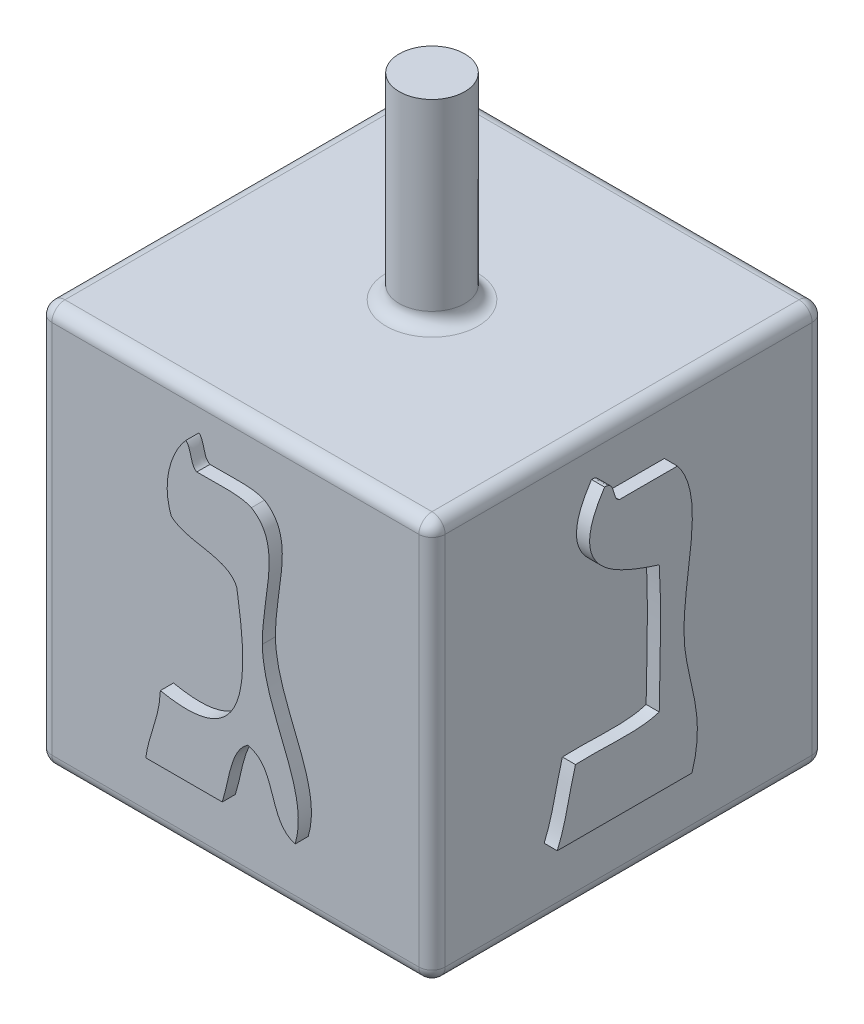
ISO-10303-21;
HEADER;
FILE_DESCRIPTION(('STEP AP214'),'2;1');
FILE_NAME('part.step','',(''),(''),'','','');
FILE_SCHEMA(('AUTOMOTIVE_DESIGN { 1 0 10303 214 1 1 1 1 }'));
ENDSEC;
DATA;
#1=APPLICATION_CONTEXT('core data for automotive mechanical design processes');
#2=APPLICATION_PROTOCOL_DEFINITION('international standard','automotive_design',2000,#1);
#3=PRODUCT_CONTEXT('',#1,'mechanical');
#4=PRODUCT('Part','Part','',(#3));
#5=PRODUCT_RELATED_PRODUCT_CATEGORY('part','',(#4));
#6=PRODUCT_DEFINITION_FORMATION('','',#4);
#7=PRODUCT_DEFINITION_CONTEXT('part definition',#1,'design');
#8=PRODUCT_DEFINITION('design','',#6,#7);
#9=PRODUCT_DEFINITION_SHAPE('','',#8);
#10=(LENGTH_UNIT() NAMED_UNIT(*) SI_UNIT(.MILLI.,.METRE.));
#11=(NAMED_UNIT(*) PLANE_ANGLE_UNIT() SI_UNIT($,.RADIAN.));
#12=(NAMED_UNIT(*) SI_UNIT($,.STERADIAN.) SOLID_ANGLE_UNIT());
#13=UNCERTAINTY_MEASURE_WITH_UNIT(LENGTH_MEASURE(1.E-05),#10,'distance_accuracy_value','');
#14=(GEOMETRIC_REPRESENTATION_CONTEXT(3) GLOBAL_UNCERTAINTY_ASSIGNED_CONTEXT((#13)) GLOBAL_UNIT_ASSIGNED_CONTEXT((#10,
#11,#12)) REPRESENTATION_CONTEXT('',''));
#15=CARTESIAN_POINT('',(0.,0.,0.));
#16=DIRECTION('',(0.,0.,1.));
#17=DIRECTION('',(1.,0.,0.));
#18=AXIS2_PLACEMENT_3D('',#15,#16,#17);
#19=CARTESIAN_POINT('',(19.05,-19.05,-19.05));
#20=DIRECTION('',(0.,0.,1.));
#21=DIRECTION('',(0.,-1.,0.));
#22=AXIS2_PLACEMENT_3D('',#19,#20,#21);
#23=PLANE('',#22);
#24=DIRECTION('',(-1.,0.,0.));
#25=VECTOR('',#24,1.);
#26=CARTESIAN_POINT('',(19.05,-20.3200000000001,-19.05));
#27=LINE('',#26,#25);
#28=CARTESIAN_POINT('',(-17.78,-20.3200000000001,-19.05));
#29=VERTEX_POINT('',#28);
#30=CARTESIAN_POINT('',(17.78,-20.3200000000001,-19.05));
#31=VERTEX_POINT('',#30);
#32=EDGE_CURVE('E987',#29,#31,#27,.F.);
#33=ORIENTED_EDGE('',*,*,#32,.T.);
#34=DIRECTION('',(0.,1.,0.));
#35=VECTOR('',#34,1.);
#36=CARTESIAN_POINT('',(17.78,-56.6239487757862,-19.05));
#37=LINE('',#36,#35);
#38=CARTESIAN_POINT('',(17.78,-56.6239487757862,-19.05));
#39=VERTEX_POINT('',#38);
#40=EDGE_CURVE('E1043',#31,#39,#37,.F.);
#41=ORIENTED_EDGE('',*,*,#40,.T.);
#42=DIRECTION('',(-1.,0.,0.));
#43=VECTOR('',#42,1.);
#44=CARTESIAN_POINT('',(19.05,-56.6239487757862,-19.05));
#45=LINE('',#44,#43);
#46=CARTESIAN_POINT('',(-17.78,-56.6239487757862,-19.05));
#47=VERTEX_POINT('',#46);
#48=EDGE_CURVE('E984',#39,#47,#45,.T.);
#49=ORIENTED_EDGE('',*,*,#48,.T.);
#50=DIRECTION('',(0.,1.,0.));
#51=VECTOR('',#50,1.);
#52=CARTESIAN_POINT('',(-17.78,-19.05,-19.05));
#53=LINE('',#52,#51);
#54=EDGE_CURVE('E1041',#47,#29,#53,.T.);
#55=ORIENTED_EDGE('',*,*,#54,.T.);
#56=EDGE_LOOP('',(#33,#41,#49,#55));
#57=FACE_BOUND('',#56,.T.);
#58=CARTESIAN_POINT('',(8.45106682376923,-31.0740920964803,-19.05));
#59=CARTESIAN_POINT('',(10.8781381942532,-37.6073754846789,-19.05));
#60=CARTESIAN_POINT('',(7.78426815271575,-45.9117836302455,-19.05));
#61=CARTESIAN_POINT('',(5.9816207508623,-51.5352167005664,-19.05));
#62=B_SPLINE_CURVE_WITH_KNOTS('',3,(#58,#59,#60,#61),.UNSPECIFIED.,.F.,.F.,(4,4),(19.,20.),.UNSPECIFIED.);
#63=CARTESIAN_POINT('',(8.45106682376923,-31.0740920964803,-19.05));
#64=VERTEX_POINT('',#63);
#65=CARTESIAN_POINT('',(5.9816207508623,-51.5352167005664,-19.05));
#66=VERTEX_POINT('',#65);
#67=EDGE_CURVE('E497',#64,#66,#62,.T.);
#68=ORIENTED_EDGE('',*,*,#67,.F.);
#69=CARTESIAN_POINT('',(9.15662284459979,-22.6074198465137,-19.05));
#70=CARTESIAN_POINT('',(11.1215343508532,-24.6252136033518,-19.05));
#71=CARTESIAN_POINT('',(11.8518950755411,-30.1428821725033,-19.05));
#72=CARTESIAN_POINT('',(8.45106682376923,-31.0740920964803,-19.05));
#73=B_SPLINE_CURVE_WITH_KNOTS('',3,(#69,#70,#71,#72),.UNSPECIFIED.,.F.,.F.,(4,4),(20.,21.),.UNSPECIFIED.);
#74=CARTESIAN_POINT('',(9.15662284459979,-22.6074198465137,-19.05));
#75=VERTEX_POINT('',#74);
#76=EDGE_CURVE('E494',#75,#64,#73,.T.);
#77=ORIENTED_EDGE('',*,*,#76,.F.);
#78=CARTESIAN_POINT('',(3.86495268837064,-25.4296439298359,-19.05));
#79=CARTESIAN_POINT('',(5.50189088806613,-24.3640751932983,-19.05));
#80=CARTESIAN_POINT('',(9.30476204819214,-25.4613388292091,-19.05));
#81=CARTESIAN_POINT('',(9.15662284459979,-22.6074198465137,-19.05));
#82=B_SPLINE_CURVE_WITH_KNOTS('',3,(#78,#79,#80,#81),.UNSPECIFIED.,.F.,.F.,(4,4),(0.,1.),.UNSPECIFIED.);
#83=CARTESIAN_POINT('',(3.86495268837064,-25.4296439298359,-19.05));
#84=VERTEX_POINT('',#83);
#85=EDGE_CURVE('E2103',#84,#75,#82,.T.);
#86=ORIENTED_EDGE('',*,*,#85,.F.);
#87=CARTESIAN_POINT('',(3.51217467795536,-31.4268701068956,-19.05));
#88=CARTESIAN_POINT('',(3.60381427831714,-29.4018416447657,-19.05));
#89=CARTESIAN_POINT('',(3.2475911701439,-26.9289504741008,-19.05));
#90=CARTESIAN_POINT('',(3.86495268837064,-25.4296439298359,-19.05));
#91=B_SPLINE_CURVE_WITH_KNOTS('',3,(#87,#88,#89,#90),.UNSPECIFIED.,.F.,.F.,(4,4),(1.,2.),.UNSPECIFIED.);
#92=CARTESIAN_POINT('',(3.51217467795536,-31.4268701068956,-19.05));
#93=VERTEX_POINT('',#92);
#94=EDGE_CURVE('E2095',#93,#84,#91,.T.);
#95=ORIENTED_EDGE('',*,*,#94,.F.);
#96=CARTESIAN_POINT('',(5.62884274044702,-30.721314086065,-19.05));
#97=CARTESIAN_POINT('',(4.51762645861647,-30.5518152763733,-19.05));
#98=CARTESIAN_POINT('',(4.24942559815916,-31.2256763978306,-19.05));
#99=CARTESIAN_POINT('',(3.51217467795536,-31.4268701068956,-19.05));
#100=B_SPLINE_CURVE_WITH_KNOTS('',3,(#96,#97,#98,#99),.UNSPECIFIED.,.F.,.F.,(4,4),(2.,3.),.UNSPECIFIED.);
#101=CARTESIAN_POINT('',(5.62884274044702,-30.721314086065,-19.05));
#102=VERTEX_POINT('',#101);
#103=EDGE_CURVE('E2087',#102,#93,#100,.T.);
#104=ORIENTED_EDGE('',*,*,#103,.F.);
#105=CARTESIAN_POINT('',(4.57050870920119,-44.8324345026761,-19.05));
#106=CARTESIAN_POINT('',(6.5390375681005,-41.3046543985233,-19.05));
#107=CARTESIAN_POINT('',(8.87791443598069,-34.4571780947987,-19.05));
#108=CARTESIAN_POINT('',(5.62884274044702,-30.721314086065,-19.05));
#109=B_SPLINE_CURVE_WITH_KNOTS('',3,(#105,#106,#107,#108),.UNSPECIFIED.,.F.,.F.,(4,4),(3.,4.),.UNSPECIFIED.);
#110=CARTESIAN_POINT('',(4.57050870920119,-44.8324345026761,-19.05));
#111=VERTEX_POINT('',#110);
#112=EDGE_CURVE('E2079',#111,#102,#109,.T.);
#113=ORIENTED_EDGE('',*,*,#112,.F.);
#114=CARTESIAN_POINT('',(-1.07393945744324,-31.0740920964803,-19.05));
#115=CARTESIAN_POINT('',(1.08510330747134,-35.3849429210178,-19.05));
#116=CARTESIAN_POINT('',(2.14343733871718,-40.793057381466,-19.05));
#117=CARTESIAN_POINT('',(4.57050870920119,-44.8324345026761,-19.05));
#118=B_SPLINE_CURVE_WITH_KNOTS('',3,(#114,#115,#116,#117),.UNSPECIFIED.,.F.,.F.,(4,4),(4.,5.),.UNSPECIFIED.);
#119=CARTESIAN_POINT('',(-1.07393945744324,-31.0740920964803,-19.05));
#120=VERTEX_POINT('',#119);
#121=EDGE_CURVE('E2071',#120,#111,#118,.T.);
#122=ORIENTED_EDGE('',*,*,#121,.F.);
#123=CARTESIAN_POINT('',(1.39550661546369,-28.9574240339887,-19.05));
#124=CARTESIAN_POINT('',(1.01103370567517,-30.1039525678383,-19.05));
#125=CARTESIAN_POINT('',(-0.32962608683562,-30.2910213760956,-19.05));
#126=CARTESIAN_POINT('',(-1.07393945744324,-31.0740920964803,-19.05));
#127=B_SPLINE_CURVE_WITH_KNOTS('',3,(#123,#124,#125,#126),.UNSPECIFIED.,.F.,.F.,(4,4),(5.,6.),.UNSPECIFIED.);
#128=CARTESIAN_POINT('',(1.39550661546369,-28.9574240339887,-19.05));
#129=VERTEX_POINT('',#128);
#130=EDGE_CURVE('E2063',#129,#120,#127,.T.);
#131=ORIENTED_EDGE('',*,*,#130,.F.);
#132=CARTESIAN_POINT('',(-0.0156054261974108,-22.9601978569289,-19.05));
#133=CARTESIAN_POINT('',(1.16968045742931,-24.247975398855,-19.05));
#134=CARTESIAN_POINT('',(1.60359052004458,-26.2798940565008,-19.05));
#135=CARTESIAN_POINT('',(1.39550661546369,-28.9574240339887,-19.05));
#136=B_SPLINE_CURVE_WITH_KNOTS('',3,(#132,#133,#134,#135),.UNSPECIFIED.,.F.,.F.,(4,4),(6.,7.),.UNSPECIFIED.);
#137=CARTESIAN_POINT('',(-0.0156054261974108,-22.9601978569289,-19.05));
#138=VERTEX_POINT('',#137);
#139=EDGE_CURVE('E2055',#138,#129,#136,.T.);
#140=ORIENTED_EDGE('',*,*,#139,.F.);
#141=CARTESIAN_POINT('',(-5.66005359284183,-25.7824219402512,-19.05));
#142=CARTESIAN_POINT('',(-4.40776055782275,-24.215935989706,-19.05));
#143=CARTESIAN_POINT('',(-0.326008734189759,-25.4720186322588,-19.05));
#144=CARTESIAN_POINT('',(-0.0156054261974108,-22.9601978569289,-19.05));
#145=B_SPLINE_CURVE_WITH_KNOTS('',3,(#141,#142,#143,#144),.UNSPECIFIED.,.F.,.F.,(4,4),(7.,8.),.UNSPECIFIED.);
#146=CARTESIAN_POINT('',(-5.66005359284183,-25.7824219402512,-19.05));
#147=VERTEX_POINT('',#146);
#148=EDGE_CURVE('E2047',#147,#138,#145,.T.);
#149=ORIENTED_EDGE('',*,*,#148,.F.);
#150=CARTESIAN_POINT('',(-5.66005359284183,-30.721314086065,-19.05));
#151=CARTESIAN_POINT('',(-5.66005359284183,-29.0773134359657,-19.05));
#152=CARTESIAN_POINT('',(-5.66005359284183,-27.4298676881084,-19.05));
#153=CARTESIAN_POINT('',(-5.66005359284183,-25.7824219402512,-19.05));
#154=B_SPLINE_CURVE_WITH_KNOTS('',3,(#150,#151,#152,#153),.UNSPECIFIED.,.F.,.F.,(4,4),(8.,9.),.UNSPECIFIED.);
#155=CARTESIAN_POINT('',(-5.66005359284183,-30.721314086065,-19.05));
#156=VERTEX_POINT('',#155);
#157=EDGE_CURVE('E2039',#156,#147,#154,.T.);
#158=ORIENTED_EDGE('',*,*,#157,.F.);
#159=CARTESIAN_POINT('',(-3.54338553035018,-30.721314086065,-19.05));
#160=CARTESIAN_POINT('',(-4.85924061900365,-30.0016331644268,-19.05));
#161=CARTESIAN_POINT('',(-5.61423379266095,-32.3756500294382,-19.05));
#162=CARTESIAN_POINT('',(-5.66005359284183,-30.721314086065,-19.05));
#163=B_SPLINE_CURVE_WITH_KNOTS('',3,(#159,#160,#161,#162),.UNSPECIFIED.,.F.,.F.,(4,4),(9.,10.),.UNSPECIFIED.);
#164=CARTESIAN_POINT('',(-3.54338553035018,-30.721314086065,-19.05));
#165=VERTEX_POINT('',#164);
#166=EDGE_CURVE('E2031',#165,#156,#163,.T.);
#167=ORIENTED_EDGE('',*,*,#166,.F.);
#168=CARTESIAN_POINT('',(1.74828462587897,-44.8324345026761,-19.05));
#169=CARTESIAN_POINT('',(0.146658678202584,-39.9676119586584,-19.05));
#170=CARTESIAN_POINT('',(-1.5360993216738,-35.1840937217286,-19.05));
#171=CARTESIAN_POINT('',(-3.54338553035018,-30.721314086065,-19.05));
#172=B_SPLINE_CURVE_WITH_KNOTS('',3,(#168,#169,#170,#171),.UNSPECIFIED.,.F.,.F.,(4,4),(10.,11.),.UNSPECIFIED.);
#173=CARTESIAN_POINT('',(1.74828462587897,-44.8324345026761,-19.05));
#174=VERTEX_POINT('',#173);
#175=EDGE_CURVE('E2023',#174,#165,#172,.T.);
#176=ORIENTED_EDGE('',*,*,#175,.F.);
#177=CARTESIAN_POINT('',(-13.0683918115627,-31.0740920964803,-19.05));
#178=CARTESIAN_POINT('',(-7.42738874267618,-34.7252067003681,-19.05));
#179=CARTESIAN_POINT('',(-8.34120092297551,-46.8116431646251,-19.05));
#180=CARTESIAN_POINT('',(1.74828462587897,-44.8324345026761,-19.05));
#181=B_SPLINE_CURVE_WITH_KNOTS('',3,(#177,#178,#179,#180),.UNSPECIFIED.,.F.,.F.,(4,4),(11.,12.),.UNSPECIFIED.);
#182=CARTESIAN_POINT('',(-13.0683918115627,-31.0740920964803,-19.05));
#183=VERTEX_POINT('',#182);
#184=EDGE_CURVE('E2015',#183,#174,#181,.T.);
#185=ORIENTED_EDGE('',*,*,#184,.F.);
#186=CARTESIAN_POINT('',(-8.48227767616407,-30.0157580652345,-19.05));
#187=CARTESIAN_POINT('',(-9.5934939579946,-30.7847038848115,-19.05));
#188=CARTESIAN_POINT('',(-11.3961413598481,-30.8660081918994,-19.05));
#189=CARTESIAN_POINT('',(-13.0683918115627,-31.0740920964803,-19.05));
#190=B_SPLINE_CURVE_WITH_KNOTS('',3,(#186,#187,#188,#189),.UNSPECIFIED.,.F.,.F.,(4,4),(12.,13.),.UNSPECIFIED.);
#191=CARTESIAN_POINT('',(-8.48227767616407,-30.0157580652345,-19.05));
#192=VERTEX_POINT('',#191);
#193=EDGE_CURVE('E2007',#192,#183,#190,.T.);
#194=ORIENTED_EDGE('',*,*,#193,.F.);
#195=CARTESIAN_POINT('',(-9.54061170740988,-22.6074198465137,-19.05));
#196=CARTESIAN_POINT('',(-8.19306171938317,-24.0326567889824,-19.05));
#197=CARTESIAN_POINT('',(-6.89477662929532,-27.8284654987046,-19.05));
#198=CARTESIAN_POINT('',(-8.48227767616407,-30.0157580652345,-19.05));
#199=B_SPLINE_CURVE_WITH_KNOTS('',3,(#195,#196,#197,#198),.UNSPECIFIED.,.F.,.F.,(4,4),(13.,14.),.UNSPECIFIED.);
#200=CARTESIAN_POINT('',(-9.54061170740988,-22.6074198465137,-19.05));
#201=VERTEX_POINT('',#200);
#202=EDGE_CURVE('E1999',#201,#192,#199,.T.);
#203=ORIENTED_EDGE('',*,*,#202,.F.);
#204=CARTESIAN_POINT('',(-10.2461677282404,-24.7240879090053,-19.05));
#205=CARTESIAN_POINT('',(-9.55111925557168,-24.4805194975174,-19.05));
#206=CARTESIAN_POINT('',(-10.3343622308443,-22.755559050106,-19.05));
#207=CARTESIAN_POINT('',(-9.54061170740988,-22.6074198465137,-19.05));
#208=B_SPLINE_CURVE_WITH_KNOTS('',3,(#204,#205,#206,#207),.UNSPECIFIED.,.F.,.F.,(4,4),(14.,15.),.UNSPECIFIED.);
#209=CARTESIAN_POINT('',(-10.2461677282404,-24.7240879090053,-19.05));
#210=VERTEX_POINT('',#209);
#211=EDGE_CURVE('E1991',#210,#201,#208,.T.);
#212=ORIENTED_EDGE('',*,*,#211,.F.);
#213=CARTESIAN_POINT('',(-14.4795038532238,-25.4296439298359,-19.05));
#214=CARTESIAN_POINT('',(-13.4458022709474,-24.8191726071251,-19.05));
#215=CARTESIAN_POINT('',(-12.0171202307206,-24.6007534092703,-19.05));
#216=CARTESIAN_POINT('',(-10.2461677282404,-24.7240879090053,-19.05));
#217=B_SPLINE_CURVE_WITH_KNOTS('',3,(#213,#214,#215,#216),.UNSPECIFIED.,.F.,.F.,(4,4),(15.,16.),.UNSPECIFIED.);
#218=CARTESIAN_POINT('',(-14.4795038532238,-25.4296439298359,-19.05));
#219=VERTEX_POINT('',#218);
#220=EDGE_CURVE('E1983',#219,#210,#217,.T.);
#221=ORIENTED_EDGE('',*,*,#220,.F.);
#222=CARTESIAN_POINT('',(-9.18783369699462,-40.9518763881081,-19.05));
#223=CARTESIAN_POINT('',(-11.8231612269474,-35.9847344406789,-19.05));
#224=CARTESIAN_POINT('',(-17.0230195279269,-32.1675661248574,-19.05));
#225=CARTESIAN_POINT('',(-14.4795038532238,-25.4296439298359,-19.05));
#226=B_SPLINE_CURVE_WITH_KNOTS('',3,(#222,#223,#224,#225),.UNSPECIFIED.,.F.,.F.,(4,4),(16.,17.),.UNSPECIFIED.);
#227=CARTESIAN_POINT('',(-9.18783369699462,-40.9518763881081,-19.05));
#228=VERTEX_POINT('',#227);
#229=EDGE_CURVE('E1975',#228,#219,#226,.T.);
#230=ORIENTED_EDGE('',*,*,#229,.F.);
#231=CARTESIAN_POINT('',(-3.89616354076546,-51.5352167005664,-19.05));
#232=CARTESIAN_POINT('',(-5.77288054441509,-48.2330904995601,-19.05));
#233=CARTESIAN_POINT('',(-7.14885258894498,-44.7935048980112,-19.05));
#234=CARTESIAN_POINT('',(-9.18783369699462,-40.9518763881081,-19.05));
#235=B_SPLINE_CURVE_WITH_KNOTS('',3,(#231,#232,#233,#234),.UNSPECIFIED.,.F.,.F.,(4,4),(17.,18.),.UNSPECIFIED.);
#236=CARTESIAN_POINT('',(-3.89616354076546,-51.5352167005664,-19.05));
#237=VERTEX_POINT('',#236);
#238=EDGE_CURVE('E54',#237,#228,#235,.T.);
#239=ORIENTED_EDGE('',*,*,#238,.F.);
#240=CARTESIAN_POINT('',(5.9816207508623,-51.5352167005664,-19.05));
#241=CARTESIAN_POINT('',(3.39934772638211,-50.8437855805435,-19.05));
#242=CARTESIAN_POINT('',(-1.27151581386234,-51.0976892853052,-19.05));
#243=CARTESIAN_POINT('',(-3.89616354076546,-51.5352167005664,-19.05));
#244=B_SPLINE_CURVE_WITH_KNOTS('',3,(#240,#241,#242,#243),.UNSPECIFIED.,.F.,.F.,(4,4),(18.,19.),.UNSPECIFIED.);
#245=EDGE_CURVE('E49',#66,#237,#244,.T.);
#246=ORIENTED_EDGE('',*,*,#245,.F.);
#247=EDGE_LOOP('',(#68,#77,#86,#95,#104,#113,#122,#131,#140,#149,#158,#167,#176,#185,#194,#203,
#212,#221,#230,#239,#246));
#248=FACE_BOUND('',#247,.T.);
#249=ADVANCED_FACE('F34',(#57,#248),#23,.F.);
#250=CARTESIAN_POINT('',(-19.05,-19.0500000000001,-19.05));
#251=DIRECTION('',(1.,0.,0.));
#252=DIRECTION('',(0.,0.,-1.));
#253=AXIS2_PLACEMENT_3D('',#250,#251,#252);
#254=PLANE('',#253);
#255=CARTESIAN_POINT('',(-19.05,-35.7445424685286,-4.94952771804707));
#256=CARTESIAN_POINT('',(-19.05,-35.4692791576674,-5.02721467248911));
#257=CARTESIAN_POINT('',(-19.05,-35.3352648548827,-5.24580612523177));
#258=CARTESIAN_POINT('',(-19.05,-35.3917644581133,-5.65508373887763));
#259=B_SPLINE_CURVE_WITH_KNOTS('',3,(#255,#256,#257,#258),.UNSPECIFIED.,.F.,.F.,(4,4),(1.,2.),.UNSPECIFIED.);
#260=CARTESIAN_POINT('',(-19.05,-35.7445424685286,-4.94952771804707));
#261=VERTEX_POINT('',#260);
#262=CARTESIAN_POINT('',(-19.05,-35.3917644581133,-5.65508373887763));
#263=VERTEX_POINT('',#262);
#264=EDGE_CURVE('E553',#261,#263,#259,.T.);
#265=ORIENTED_EDGE('',*,*,#264,.F.);
#266=CARTESIAN_POINT('',(-19.05,-50.9139969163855,-9.18286384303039));
#267=CARTESIAN_POINT('',(-19.05,-50.4130797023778,-3.21733256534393));
#268=CARTESIAN_POINT('',(-19.05,-41.1454222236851,-6.01836929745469));
#269=CARTESIAN_POINT('',(-19.05,-35.7445424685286,-4.94952771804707));
#270=B_SPLINE_CURVE_WITH_KNOTS('',3,(#266,#267,#268,#269),.UNSPECIFIED.,.F.,.F.,(4,4),(2.,3.),.UNSPECIFIED.);
#271=CARTESIAN_POINT('',(-19.05,-50.9139969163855,-9.18286384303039));
#272=VERTEX_POINT('',#271);
#273=EDGE_CURVE('E570',#272,#261,#270,.T.);
#274=ORIENTED_EDGE('',*,*,#273,.F.);
#275=CARTESIAN_POINT('',(-19.05,-35.3917644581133,-5.65508373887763));
#276=CARTESIAN_POINT('',(-19.05,-37.3320435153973,-10.0648088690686));
#277=CARTESIAN_POINT('',(-19.05,-45.960979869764,-7.78587670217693));
#278=CARTESIAN_POINT('',(-19.05,-50.9139969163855,-9.18286384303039));
#279=B_SPLINE_CURVE_WITH_KNOTS('',3,(#275,#276,#277,#278),.UNSPECIFIED.,.F.,.F.,(4,4),(0.,1.),.UNSPECIFIED.);
#280=EDGE_CURVE('E561',#263,#272,#279,.T.);
#281=ORIENTED_EDGE('',*,*,#280,.F.);
#282=EDGE_LOOP('',(#265,#274,#281));
#283=FACE_BOUND('',#282,.T.);
#284=DIRECTION('',(0.,0.,1.));
#285=VECTOR('',#284,1.);
#286=CARTESIAN_POINT('',(-19.05,-56.6239487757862,19.05));
#287=LINE('',#286,#285);
#288=CARTESIAN_POINT('',(-19.05,-56.6239487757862,-17.78));
#289=VERTEX_POINT('',#288);
#290=CARTESIAN_POINT('',(-19.05,-56.6239487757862,17.78));
#291=VERTEX_POINT('',#290);
#292=EDGE_CURVE('E1001',#289,#291,#287,.T.);
#293=ORIENTED_EDGE('',*,*,#292,.T.);
#294=DIRECTION('',(0.,-1.,0.));
#295=VECTOR('',#294,1.);
#296=CARTESIAN_POINT('',(-19.05,-19.0500000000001,17.78));
#297=LINE('',#296,#295);
#298=CARTESIAN_POINT('',(-19.05,-20.32,17.78));
#299=VERTEX_POINT('',#298);
#300=EDGE_CURVE('E1071',#291,#299,#297,.F.);
#301=ORIENTED_EDGE('',*,*,#300,.T.);
#302=DIRECTION('',(0.,0.,1.));
#303=VECTOR('',#302,1.);
#304=CARTESIAN_POINT('',(-19.05,-20.3200000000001,-19.05));
#305=LINE('',#304,#303);
#306=CARTESIAN_POINT('',(-19.05,-20.3200000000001,-17.78));
#307=VERTEX_POINT('',#306);
#308=EDGE_CURVE('E1004',#299,#307,#305,.F.);
#309=ORIENTED_EDGE('',*,*,#308,.T.);
#310=DIRECTION('',(0.,1.,0.));
#311=VECTOR('',#310,1.);
#312=CARTESIAN_POINT('',(-19.05,-19.0500000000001,-17.78));
#313=LINE('',#312,#311);
#314=EDGE_CURVE('E1069',#307,#289,#313,.F.);
#315=ORIENTED_EDGE('',*,*,#314,.T.);
#316=EDGE_LOOP('',(#293,#301,#309,#315));
#317=FACE_BOUND('',#316,.T.);
#318=CARTESIAN_POINT('',(-19.05,-30.1000943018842,-8.83008583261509));
#319=CARTESIAN_POINT('',(-19.05,-34.5449594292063,-6.63934816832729));
#320=CARTESIAN_POINT('',(-19.05,-30.798415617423,2.38112354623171));
#321=CARTESIAN_POINT('',(-19.05,-32.5695403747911,7.39770264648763));
#322=B_SPLINE_CURVE_WITH_KNOTS('',3,(#318,#319,#320,#321),.UNSPECIFIED.,.F.,.F.,(4,4),(5.,6.),.UNSPECIFIED.);
#323=CARTESIAN_POINT('',(-19.05,-30.1000943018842,-8.83008583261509));
#324=VERTEX_POINT('',#323);
#325=CARTESIAN_POINT('',(-19.05,-32.5695403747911,7.39770264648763));
#326=VERTEX_POINT('',#325);
#327=EDGE_CURVE('E498',#324,#326,#322,.T.);
#328=ORIENTED_EDGE('',*,*,#327,.F.);
#329=CARTESIAN_POINT('',(-19.05,-21.9862000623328,-7.41897379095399));
#330=CARTESIAN_POINT('',(-19.05,-24.7202296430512,-8.36448087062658));
#331=CARTESIAN_POINT('',(-19.05,-27.718842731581,-10.00486416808));
#332=CARTESIAN_POINT('',(-19.05,-30.1000943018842,-8.83008583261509));
#333=B_SPLINE_CURVE_WITH_KNOTS('',3,(#329,#330,#331,#332),.UNSPECIFIED.,.F.,.F.,(4,4),(6.,7.),.UNSPECIFIED.);
#334=CARTESIAN_POINT('',(-19.05,-21.9862000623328,-7.41897379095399));
#335=VERTEX_POINT('',#334);
#336=EDGE_CURVE('E514',#335,#324,#333,.T.);
#337=ORIENTED_EDGE('',*,*,#336,.F.);
#338=CARTESIAN_POINT('',(-19.05,-23.0445340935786,-7.06619578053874));
#339=CARTESIAN_POINT('',(-19.05,-22.6318113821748,-7.1226953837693));
#340=CARTESIAN_POINT('',(-19.05,-22.0461447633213,-7.0062510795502));
#341=CARTESIAN_POINT('',(-19.05,-21.9862000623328,-7.41897379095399));
#342=B_SPLINE_CURVE_WITH_KNOTS('',3,(#338,#339,#340,#341),.UNSPECIFIED.,.F.,.F.,(4,4),(0.,1.),.UNSPECIFIED.);
#343=CARTESIAN_POINT('',(-19.05,-23.0445340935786,-7.06619578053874));
#344=VERTEX_POINT('',#343);
#345=EDGE_CURVE('E2247',#344,#335,#342,.T.);
#346=ORIENTED_EDGE('',*,*,#345,.F.);
#347=CARTESIAN_POINT('',(-19.05,-24.1028681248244,10.9254827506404));
#348=CARTESIAN_POINT('',(-19.05,-22.3565480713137,6.39931331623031));
#349=CARTESIAN_POINT('',(-19.05,-24.2758120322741,-3.13275541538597));
#350=CARTESIAN_POINT('',(-19.05,-23.0445340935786,-7.06619578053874));
#351=B_SPLINE_CURVE_WITH_KNOTS('',3,(#347,#348,#349,#350),.UNSPECIFIED.,.F.,.F.,(4,4),(1.,2.),.UNSPECIFIED.);
#352=CARTESIAN_POINT('',(-19.05,-24.1028681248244,10.9254827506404));
#353=VERTEX_POINT('',#352);
#354=EDGE_CURVE('E2239',#353,#344,#351,.T.);
#355=ORIENTED_EDGE('',*,*,#354,.F.);
#356=CARTESIAN_POINT('',(-19.05,-32.5695403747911,9.51437070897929));
#357=CARTESIAN_POINT('',(-19.05,-31.4478165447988,12.3119623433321));
#358=CARTESIAN_POINT('',(-19.05,-26.8086479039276,12.4352968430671));
#359=CARTESIAN_POINT('',(-19.05,-24.1028681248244,10.9254827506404));
#360=B_SPLINE_CURVE_WITH_KNOTS('',3,(#356,#357,#358,#359),.UNSPECIFIED.,.F.,.F.,(4,4),(2.,3.),.UNSPECIFIED.);
#361=CARTESIAN_POINT('',(-19.05,-32.5695403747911,9.51437070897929));
#362=VERTEX_POINT('',#361);
#363=EDGE_CURVE('E2231',#362,#353,#360,.T.);
#364=ORIENTED_EDGE('',*,*,#363,.F.);
#365=CARTESIAN_POINT('',(-19.05,-50.9139969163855,7.39770264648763));
#366=CARTESIAN_POINT('',(-19.05,-48.0425079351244,12.4954137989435));
#367=CARTESIAN_POINT('',(-19.05,-38.9088647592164,9.15108515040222));
#368=CARTESIAN_POINT('',(-19.05,-32.5695403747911,9.51437070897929));
#369=B_SPLINE_CURVE_WITH_KNOTS('',3,(#365,#366,#367,#368),.UNSPECIFIED.,.F.,.F.,(4,4),(3.,4.),.UNSPECIFIED.);
#370=CARTESIAN_POINT('',(-19.05,-50.9139969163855,7.39770264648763));
#371=VERTEX_POINT('',#370);
#372=EDGE_CURVE('E2223',#371,#362,#369,.T.);
#373=ORIENTED_EDGE('',*,*,#372,.F.);
#374=CARTESIAN_POINT('',(-19.05,-32.5695403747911,7.39770264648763));
#375=CARTESIAN_POINT('',(-19.05,-38.958474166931,7.90568231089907));
#376=CARTESIAN_POINT('',(-19.05,-45.2271740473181,6.41343821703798));
#377=CARTESIAN_POINT('',(-19.05,-50.9139969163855,7.39770264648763));
#378=B_SPLINE_CURVE_WITH_KNOTS('',3,(#374,#375,#376,#377),.UNSPECIFIED.,.F.,.F.,(4,4),(4.,5.),.UNSPECIFIED.);
#379=EDGE_CURVE('E501',#326,#371,#378,.T.);
#380=ORIENTED_EDGE('',*,*,#379,.F.);
#381=EDGE_LOOP('',(#328,#337,#346,#355,#364,#373,#380));
#382=FACE_BOUND('',#381,.T.);
#383=ADVANCED_FACE('F868',(#283,#317,#382),#254,.F.);
#384=CARTESIAN_POINT('',(19.05,-19.05,19.05));
#385=DIRECTION('',(0.,0.,-1.));
#386=DIRECTION('',(0.,1.,0.));
#387=AXIS2_PLACEMENT_3D('',#384,#385,#386);
#388=PLANE('',#387);
#389=DIRECTION('',(-1.,0.,0.));
#390=VECTOR('',#389,1.);
#391=CARTESIAN_POINT('',(19.05,-56.6239487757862,19.05));
#392=LINE('',#391,#390);
#393=CARTESIAN_POINT('',(-17.78,-56.6239487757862,19.05));
#394=VERTEX_POINT('',#393);
#395=CARTESIAN_POINT('',(17.78,-56.6239487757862,19.05));
#396=VERTEX_POINT('',#395);
#397=EDGE_CURVE('E995',#394,#396,#392,.F.);
#398=ORIENTED_EDGE('',*,*,#397,.T.);
#399=DIRECTION('',(0.,-1.,0.));
#400=VECTOR('',#399,1.);
#401=CARTESIAN_POINT('',(17.78,-20.32,19.05));
#402=LINE('',#401,#400);
#403=CARTESIAN_POINT('',(17.78,-20.32,19.05));
#404=VERTEX_POINT('',#403);
#405=EDGE_CURVE('E1057',#396,#404,#402,.F.);
#406=ORIENTED_EDGE('',*,*,#405,.T.);
#407=DIRECTION('',(-1.,0.,0.));
#408=VECTOR('',#407,1.);
#409=CARTESIAN_POINT('',(19.05,-20.32,19.05));
#410=LINE('',#409,#408);
#411=CARTESIAN_POINT('',(-17.78,-20.32,19.05));
#412=VERTEX_POINT('',#411);
#413=EDGE_CURVE('E998',#404,#412,#410,.T.);
#414=ORIENTED_EDGE('',*,*,#413,.T.);
#415=DIRECTION('',(0.,-1.,0.));
#416=VECTOR('',#415,1.);
#417=CARTESIAN_POINT('',(-17.78,-19.05,19.05));
#418=LINE('',#417,#416);
#419=EDGE_CURVE('E1055',#412,#394,#418,.T.);
#420=ORIENTED_EDGE('',*,*,#419,.T.);
#421=EDGE_LOOP('',(#398,#406,#414,#420));
#422=FACE_BOUND('',#421,.T.);
#423=CARTESIAN_POINT('',(-4.93889214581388,-29.5113857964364,19.05));
#424=CARTESIAN_POINT('',(-3.35139109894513,-30.9824425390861,19.05));
#425=CARTESIAN_POINT('',(0.493854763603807,-30.1957544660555,19.05));
#426=CARTESIAN_POINT('',(1.41111204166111,-32.3336098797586,19.05));
#427=B_SPLINE_CURVE_WITH_KNOTS('',3,(#423,#424,#425,#426),.UNSPECIFIED.,.F.,.F.,(4,4),(9.,10.),.UNSPECIFIED.);
#428=CARTESIAN_POINT('',(-4.93889214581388,-29.5113857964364,19.05));
#429=VERTEX_POINT('',#428);
#430=CARTESIAN_POINT('',(1.41111204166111,-32.3336098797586,19.05));
#431=VERTEX_POINT('',#430);
#432=EDGE_CURVE('E590',#429,#431,#427,.T.);
#433=ORIENTED_EDGE('',*,*,#432,.F.);
#434=CARTESIAN_POINT('',(-3.52778010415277,-22.4558255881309,19.05));
#435=CARTESIAN_POINT('',(-4.83312764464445,-23.8951874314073,19.05));
#436=CARTESIAN_POINT('',(-5.96897637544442,-26.8548709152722,19.05));
#437=CARTESIAN_POINT('',(-4.93889214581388,-29.5113857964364,19.05));
#438=B_SPLINE_CURVE_WITH_KNOTS('',3,(#434,#435,#436,#437),.UNSPECIFIED.,.F.,.F.,(4,4),(10.,11.),.UNSPECIFIED.);
#439=CARTESIAN_POINT('',(-3.52778010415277,-22.4558255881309,19.05));
#440=VERTEX_POINT('',#439);
#441=EDGE_CURVE('E598',#440,#429,#438,.T.);
#442=ORIENTED_EDGE('',*,*,#441,.F.);
#443=CARTESIAN_POINT('',(-2.46944607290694,-24.5724936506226,19.05));
#444=CARTESIAN_POINT('',(-3.15381474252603,-24.1985282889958,19.05));
#445=CARTESIAN_POINT('',(-2.95985573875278,-22.9496803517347,19.05));
#446=CARTESIAN_POINT('',(-3.52778010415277,-22.4558255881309,19.05));
#447=B_SPLINE_CURVE_WITH_KNOTS('',3,(#443,#444,#445,#446),.UNSPECIFIED.,.F.,.F.,(4,4),(0.,1.),.UNSPECIFIED.);
#448=CARTESIAN_POINT('',(-2.46944607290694,-24.5724936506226,19.05));
#449=VERTEX_POINT('',#448);
#450=EDGE_CURVE('E2374',#449,#440,#447,.T.);
#451=ORIENTED_EDGE('',*,*,#450,.F.);
#452=CARTESIAN_POINT('',(2.82222408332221,-24.9252716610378,19.05));
#453=CARTESIAN_POINT('',(1.51343144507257,-24.353729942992,19.05));
#454=CARTESIAN_POINT('',(-0.649056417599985,-24.6324383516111,19.05));
#455=CARTESIAN_POINT('',(-2.46944607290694,-24.5724936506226,19.05));
#456=B_SPLINE_CURVE_WITH_KNOTS('',3,(#452,#453,#454,#455),.UNSPECIFIED.,.F.,.F.,(4,4),(1.,2.),.UNSPECIFIED.);
#457=CARTESIAN_POINT('',(2.82222408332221,-24.9252716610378,19.05));
#458=VERTEX_POINT('',#457);
#459=EDGE_CURVE('E2366',#458,#449,#456,.T.);
#460=ORIENTED_EDGE('',*,*,#459,.F.);
#461=CARTESIAN_POINT('',(3.88055811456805,-35.8613899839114,19.05));
#462=CARTESIAN_POINT('',(3.81699606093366,-31.7021234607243,19.05));
#463=CARTESIAN_POINT('',(5.97965617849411,-26.8514258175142,19.05));
#464=CARTESIAN_POINT('',(2.82222408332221,-24.9252716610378,19.05));
#465=B_SPLINE_CURVE_WITH_KNOTS('',3,(#461,#462,#463,#464),.UNSPECIFIED.,.F.,.F.,(4,4),(2.,3.),.UNSPECIFIED.);
#466=CARTESIAN_POINT('',(3.88055811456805,-35.8613899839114,19.05));
#467=VERTEX_POINT('',#466);
#468=EDGE_CURVE('E2358',#467,#458,#465,.T.);
#469=ORIENTED_EDGE('',*,*,#468,.F.);
#470=CARTESIAN_POINT('',(7.05556020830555,-51.0308444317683,19.05));
#471=CARTESIAN_POINT('',(8.58656165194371,-45.9401957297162,19.05));
#472=CARTESIAN_POINT('',(3.96530751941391,-41.3964562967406,19.05));
#473=CARTESIAN_POINT('',(3.88055811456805,-35.8613899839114,19.05));
#474=B_SPLINE_CURVE_WITH_KNOTS('',3,(#470,#471,#472,#473),.UNSPECIFIED.,.F.,.F.,(4,4),(3.,4.),.UNSPECIFIED.);
#475=CARTESIAN_POINT('',(7.05556020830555,-51.0308444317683,19.05));
#476=VERTEX_POINT('',#475);
#477=EDGE_CURVE('E2350',#476,#467,#474,.T.);
#478=ORIENTED_EDGE('',*,*,#477,.F.);
#479=CARTESIAN_POINT('',(2.46944607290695,-45.0336182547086,19.05));
#480=CARTESIAN_POINT('',(5.38330975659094,-45.6509797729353,19.05));
#481=CARTESIAN_POINT('',(4.35684287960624,-50.2053990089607,19.05));
#482=CARTESIAN_POINT('',(7.05556020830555,-51.0308444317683,19.05));
#483=B_SPLINE_CURVE_WITH_KNOTS('',3,(#479,#480,#481,#482),.UNSPECIFIED.,.F.,.F.,(4,4),(4.,5.),.UNSPECIFIED.);
#484=CARTESIAN_POINT('',(2.46944607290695,-45.0336182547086,19.05));
#485=VERTEX_POINT('',#484);
#486=EDGE_CURVE('E2342',#485,#476,#483,.T.);
#487=ORIENTED_EDGE('',*,*,#486,.F.);
#488=CARTESIAN_POINT('',(0.,-51.0308444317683,19.05));
#489=CARTESIAN_POINT('',(0.684368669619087,-48.8964341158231,19.05));
#490=CARTESIAN_POINT('',(0.765500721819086,-46.151896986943,19.05));
#491=CARTESIAN_POINT('',(2.46944607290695,-45.0336182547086,19.05));
#492=B_SPLINE_CURVE_WITH_KNOTS('',3,(#488,#489,#490,#491),.UNSPECIFIED.,.F.,.F.,(4,4),(5.,6.),.UNSPECIFIED.);
#493=CARTESIAN_POINT('',(0.,-51.0308444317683,19.05));
#494=VERTEX_POINT('',#493);
#495=EDGE_CURVE('E2334',#494,#485,#492,.T.);
#496=ORIENTED_EDGE('',*,*,#495,.F.);
#497=CARTESIAN_POINT('',(-7.40833821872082,-51.0308444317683,19.05));
#498=CARTESIAN_POINT('',(-4.93889214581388,-51.0308444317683,19.05));
#499=CARTESIAN_POINT('',(-2.46944607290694,-51.0308444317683,19.05));
#500=CARTESIAN_POINT('',(0.,-51.0308444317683,19.05));
#501=B_SPLINE_CURVE_WITH_KNOTS('',3,(#497,#498,#499,#500),.UNSPECIFIED.,.F.,.F.,(4,4),(6.,7.),.UNSPECIFIED.);
#502=CARTESIAN_POINT('',(-7.40833821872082,-51.0308444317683,19.05));
#503=VERTEX_POINT('',#502);
#504=EDGE_CURVE('E2326',#503,#494,#501,.T.);
#505=ORIENTED_EDGE('',*,*,#504,.F.);
#506=CARTESIAN_POINT('',(-5.99722617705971,-44.6808402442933,19.05));
#507=CARTESIAN_POINT('',(-6.09954558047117,-47.1678563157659,19.05));
#508=CARTESIAN_POINT('',(-7.10844245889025,-48.7448498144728,19.05));
#509=CARTESIAN_POINT('',(-7.40833821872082,-51.0308444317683,19.05));
#510=B_SPLINE_CURVE_WITH_KNOTS('',3,(#506,#507,#508,#509),.UNSPECIFIED.,.F.,.F.,(4,4),(7.,8.),.UNSPECIFIED.);
#511=CARTESIAN_POINT('',(-5.99722617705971,-44.6808402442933,19.05));
#512=VERTEX_POINT('',#511);
#513=EDGE_CURVE('E2318',#512,#503,#510,.T.);
#514=ORIENTED_EDGE('',*,*,#513,.F.);
#515=CARTESIAN_POINT('',(1.41111204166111,-32.3336098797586,19.05));
#516=CARTESIAN_POINT('',(2.46600097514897,-39.0680869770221,19.05));
#517=CARTESIAN_POINT('',(3.01618308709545,-46.5363698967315,19.05));
#518=CARTESIAN_POINT('',(-5.99722617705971,-44.6808402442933,19.05));
#519=B_SPLINE_CURVE_WITH_KNOTS('',3,(#515,#516,#517,#518),.UNSPECIFIED.,.F.,.F.,(4,4),(8.,9.),.UNSPECIFIED.);
#520=EDGE_CURVE('E2310',#431,#512,#519,.T.);
#521=ORIENTED_EDGE('',*,*,#520,.F.);
#522=EDGE_LOOP('',(#433,#442,#451,#460,#469,#478,#487,#496,#505,#514,#521));
#523=FACE_BOUND('',#522,.T.);
#524=ADVANCED_FACE('F874',(#422,#523),#388,.F.);
#525=CARTESIAN_POINT('',(19.05,-19.0500000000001,-19.05));
#526=DIRECTION('',(1.,0.,0.));
#527=DIRECTION('',(0.,0.,-1.));
#528=AXIS2_PLACEMENT_3D('',#525,#526,#527);
#529=PLANE('',#528);
#530=DIRECTION('',(0.,0.,1.));
#531=VECTOR('',#530,1.);
#532=CARTESIAN_POINT('',(19.05,-56.6239487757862,-19.05));
#533=LINE('',#532,#531);
#534=CARTESIAN_POINT('',(19.05,-56.6239487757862,17.78));
#535=VERTEX_POINT('',#534);
#536=CARTESIAN_POINT('',(19.05,-56.6239487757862,-17.78));
#537=VERTEX_POINT('',#536);
#538=EDGE_CURVE('E989',#535,#537,#533,.F.);
#539=ORIENTED_EDGE('',*,*,#538,.T.);
#540=DIRECTION('',(0.,1.,0.));
#541=VECTOR('',#540,1.);
#542=CARTESIAN_POINT('',(19.05,-20.3200000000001,-17.78));
#543=LINE('',#542,#541);
#544=CARTESIAN_POINT('',(19.05,-20.3200000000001,-17.78));
#545=VERTEX_POINT('',#544);
#546=EDGE_CURVE('E1039',#537,#545,#543,.T.);
#547=ORIENTED_EDGE('',*,*,#546,.T.);
#548=DIRECTION('',(0.,0.,1.));
#549=VECTOR('',#548,1.);
#550=CARTESIAN_POINT('',(19.05,-20.32,19.05));
#551=LINE('',#550,#549);
#552=CARTESIAN_POINT('',(19.05,-20.32,17.78));
#553=VERTEX_POINT('',#552);
#554=EDGE_CURVE('E992',#545,#553,#551,.T.);
#555=ORIENTED_EDGE('',*,*,#554,.T.);
#556=DIRECTION('',(0.,-1.,0.));
#557=VECTOR('',#556,1.);
#558=CARTESIAN_POINT('',(19.05,-56.6239487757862,17.78));
#559=LINE('',#558,#557);
#560=EDGE_CURVE('E1037',#553,#535,#559,.T.);
#561=ORIENTED_EDGE('',*,*,#560,.T.);
#562=EDGE_LOOP('',(#539,#547,#555,#561));
#563=FACE_BOUND('',#562,.T.);
#564=CARTESIAN_POINT('',(19.05,-44.3280622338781,-1.69557247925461));
#565=CARTESIAN_POINT('',(19.05,-45.0265558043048,0.428158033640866));
#566=CARTESIAN_POINT('',(19.05,-44.5361461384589,3.74079178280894));
#567=CARTESIAN_POINT('',(19.05,-44.6808402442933,6.41832176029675));
#568=B_SPLINE_CURVE_WITH_KNOTS('',3,(#564,#565,#566,#567),.UNSPECIFIED.,.F.,.F.,(4,4),(6.,7.),.UNSPECIFIED.);
#569=CARTESIAN_POINT('',(19.05,-44.3280622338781,-1.69557247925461));
#570=VERTEX_POINT('',#569);
#571=CARTESIAN_POINT('',(19.05,-44.6808402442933,6.41832176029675));
#572=VERTEX_POINT('',#571);
#573=EDGE_CURVE('E645',#570,#572,#568,.T.);
#574=ORIENTED_EDGE('',*,*,#573,.F.);
#575=CARTESIAN_POINT('',(19.05,-31.9808318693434,-1.69557247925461));
#576=CARTESIAN_POINT('',(19.05,-35.3005280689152,-1.93190618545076));
#577=CARTESIAN_POINT('',(19.05,-41.0331707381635,-1.75551718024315));
#578=CARTESIAN_POINT('',(19.05,-44.3280622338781,-1.69557247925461));
#579=B_SPLINE_CURVE_WITH_KNOTS('',3,(#575,#576,#577,#578),.UNSPECIFIED.,.F.,.F.,(4,4),(7.,8.),.UNSPECIFIED.);
#580=CARTESIAN_POINT('',(19.05,-31.9808318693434,-1.69557247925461));
#581=VERTEX_POINT('',#580);
#582=EDGE_CURVE('E637',#581,#570,#579,.T.);
#583=ORIENTED_EDGE('',*,*,#582,.F.);
#584=CARTESIAN_POINT('',(19.05,-22.8086035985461,3.59609767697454));
#585=CARTESIAN_POINT('',(19.05,-28.8058297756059,7.63547479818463));
#586=CARTESIAN_POINT('',(19.05,-30.6437894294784,2.40013199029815));
#587=CARTESIAN_POINT('',(19.05,-31.9808318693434,-1.69557247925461));
#588=B_SPLINE_CURVE_WITH_KNOTS('',3,(#584,#585,#586,#587),.UNSPECIFIED.,.F.,.F.,(4,4),(8.,9.),.UNSPECIFIED.);
#589=CARTESIAN_POINT('',(19.05,-22.8086035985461,3.59609767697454));
#590=VERTEX_POINT('',#589);
#591=EDGE_CURVE('E696',#590,#581,#588,.T.);
#592=ORIENTED_EDGE('',*,*,#591,.F.);
#593=CARTESIAN_POINT('',(19.05,-24.5724936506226,2.18498563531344));
#594=CARTESIAN_POINT('',(19.05,-24.2409029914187,2.90811165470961));
#595=CARTESIAN_POINT('',(19.05,-22.7557213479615,2.48488139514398));
#596=CARTESIAN_POINT('',(19.05,-22.8086035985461,3.59609767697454));
#597=B_SPLINE_CURVE_WITH_KNOTS('',3,(#593,#594,#595,#596),.UNSPECIFIED.,.F.,.F.,(4,4),(0.,1.),.UNSPECIFIED.);
#598=CARTESIAN_POINT('',(19.05,-24.5724936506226,2.18498563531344));
#599=VERTEX_POINT('',#598);
#600=EDGE_CURVE('E688',#599,#590,#597,.T.);
#601=ORIENTED_EDGE('',*,*,#600,.F.);
#602=CARTESIAN_POINT('',(19.05,-24.5724936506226,-3.45946253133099));
#603=CARTESIAN_POINT('',(19.05,-24.5724936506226,-1.5791281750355));
#604=CARTESIAN_POINT('',(19.05,-24.5724936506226,0.304651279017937));
#605=CARTESIAN_POINT('',(19.05,-24.5724936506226,2.18498563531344));
#606=B_SPLINE_CURVE_WITH_KNOTS('',3,(#602,#603,#604,#605),.UNSPECIFIED.,.F.,.F.,(4,4),(1.,2.),.UNSPECIFIED.);
#607=CARTESIAN_POINT('',(19.05,-24.5724936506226,-3.45946253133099));
#608=VERTEX_POINT('',#607);
#609=EDGE_CURVE('E681',#608,#599,#606,.T.);
#610=ORIENTED_EDGE('',*,*,#609,.F.);
#611=CARTESIAN_POINT('',(19.05,-40.0947261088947,-4.16501855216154));
#612=CARTESIAN_POINT('',(19.05,-34.7219239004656,-3.61466418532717));
#613=CARTESIAN_POINT('',(19.05,-28.5376289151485,-6.56039502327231));
#614=CARTESIAN_POINT('',(19.05,-24.5724936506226,-3.45946253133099));
#615=B_SPLINE_CURVE_WITH_KNOTS('',3,(#611,#612,#613,#614),.UNSPECIFIED.,.F.,.F.,(4,4),(2.,3.),.UNSPECIFIED.);
#616=CARTESIAN_POINT('',(19.05,-40.0947261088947,-4.16501855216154));
#617=VERTEX_POINT('',#616);
#618=EDGE_CURVE('E674',#617,#608,#615,.T.);
#619=ORIENTED_EDGE('',*,*,#618,.F.);
#620=CARTESIAN_POINT('',(19.05,-51.0308444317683,-4.8705745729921));
#621=CARTESIAN_POINT('',(19.05,-46.7480711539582,-6.23586681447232));
#622=CARTESIAN_POINT('',(19.05,-43.5306943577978,-4.51779656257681));
#623=CARTESIAN_POINT('',(19.05,-40.0947261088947,-4.16501855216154));
#624=B_SPLINE_CURVE_WITH_KNOTS('',3,(#620,#621,#622,#623),.UNSPECIFIED.,.F.,.F.,(4,4),(3.,4.),.UNSPECIFIED.);
#625=CARTESIAN_POINT('',(19.05,-51.0308444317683,-4.8705745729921));
#626=VERTEX_POINT('',#625);
#627=EDGE_CURVE('E667',#626,#617,#624,.T.);
#628=ORIENTED_EDGE('',*,*,#627,.F.);
#629=CARTESIAN_POINT('',(19.05,-51.0308444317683,8.18221181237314));
#630=CARTESIAN_POINT('',(19.05,-51.0308444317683,3.83243138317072));
#631=CARTESIAN_POINT('',(19.05,-51.0308444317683,-0.520794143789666));
#632=CARTESIAN_POINT('',(19.05,-51.0308444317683,-4.8705745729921));
#633=B_SPLINE_CURVE_WITH_KNOTS('',3,(#629,#630,#631,#632),.UNSPECIFIED.,.F.,.F.,(4,4),(4.,5.),.UNSPECIFIED.);
#634=CARTESIAN_POINT('',(19.05,-51.0308444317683,8.18221181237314));
#635=VERTEX_POINT('',#634);
#636=EDGE_CURVE('E660',#635,#626,#633,.T.);
#637=ORIENTED_EDGE('',*,*,#636,.F.);
#638=CARTESIAN_POINT('',(19.05,-44.6808402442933,6.41832176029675));
#639=CARTESIAN_POINT('',(19.05,-46.7797660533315,7.02517573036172));
#640=CARTESIAN_POINT('',(19.05,-49.1575725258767,7.3497039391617));
#641=CARTESIAN_POINT('',(19.05,-51.0308444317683,8.18221181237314));
#642=B_SPLINE_CURVE_WITH_KNOTS('',3,(#638,#639,#640,#641),.UNSPECIFIED.,.F.,.F.,(4,4),(5.,6.),.UNSPECIFIED.);
#643=EDGE_CURVE('E653',#572,#635,#642,.T.);
#644=ORIENTED_EDGE('',*,*,#643,.F.);
#645=EDGE_LOOP('',(#574,#583,#592,#601,#610,#619,#628,#637,#644));
#646=FACE_BOUND('',#645,.T.);
#647=ADVANCED_FACE('F1159',(#563,#646),#529,.T.);
#648=CARTESIAN_POINT('',(0.,-9.26782283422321,0.));
#649=DIRECTION('',(0.,-1.,0.));
#650=DIRECTION('',(0.,0.,-1.));
#651=AXIS2_PLACEMENT_3D('',#648,#649,#650);
#652=CYLINDRICAL_SURFACE('',#651,3.175);
#653=CARTESIAN_POINT('',(0.,-17.7800000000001,0.));
#654=DIRECTION('',(0.,-1.,0.));
#655=DIRECTION('',(0.,0.,-1.));
#656=AXIS2_PLACEMENT_3D('',#653,#654,#655);
#657=CIRCLE('',#656,3.175);
#658=CARTESIAN_POINT('',(0.,-17.7800000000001,-3.175));
#659=VERTEX_POINT('',#658);
#660=EDGE_CURVE('E42',#659,#659,#657,.F.);
#661=CARTESIAN_POINT('',(0.,2.8421709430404E-11,0.));
#662=DIRECTION('',(0.,-1.,0.));
#663=DIRECTION('',(0.,0.,-1.));
#664=AXIS2_PLACEMENT_3D('',#661,#662,#663);
#665=CIRCLE('',#664,3.175);
#666=CARTESIAN_POINT('',(0.,2.842344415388E-11,-3.175));
#667=VERTEX_POINT('',#666);
#668=EDGE_CURVE('E963',#667,#667,#665,.F.);
#669=CARTESIAN_POINT('',(0.,-17.7800000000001,-3.175));
#670=CARTESIAN_POINT('',(0.,-17.5947916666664,-3.175));
#671=CARTESIAN_POINT('',(0.,-17.4095833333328,-3.175));
#672=CARTESIAN_POINT('',(0.,-17.0391666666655,-3.175));
#673=CARTESIAN_POINT('',(0.,-16.8539583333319,-3.175));
#674=CARTESIAN_POINT('',(0.,-16.4835416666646,-3.175));
#675=CARTESIAN_POINT('',(0.,-16.298333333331,-3.175));
#676=CARTESIAN_POINT('',(0.,-15.9279166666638,-3.175));
#677=CARTESIAN_POINT('',(0.,-15.7427083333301,-3.175));
#678=CARTESIAN_POINT('',(0.,-15.3722916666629,-3.175));
#679=CARTESIAN_POINT('',(0.,-15.1870833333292,-3.175));
#680=CARTESIAN_POINT('',(0.,-14.816666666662,-3.175));
#681=CARTESIAN_POINT('',(0.,-14.6314583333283,-3.175));
#682=CARTESIAN_POINT('',(0.,-14.2610416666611,-3.175));
#683=CARTESIAN_POINT('',(0.,-14.0758333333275,-3.175));
#684=CARTESIAN_POINT('',(0.,-13.7054166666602,-3.175));
#685=CARTESIAN_POINT('',(0.,-13.5202083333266,-3.175));
#686=CARTESIAN_POINT('',(0.,-13.1497916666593,-3.175));
#687=CARTESIAN_POINT('',(0.,-12.9645833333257,-3.175));
#688=CARTESIAN_POINT('',(0.,-12.5941666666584,-3.175));
#689=CARTESIAN_POINT('',(0.,-12.4089583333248,-3.175));
#690=CARTESIAN_POINT('',(0.,-12.0385416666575,-3.175));
#691=CARTESIAN_POINT('',(0.,-11.8533333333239,-3.175));
#692=CARTESIAN_POINT('',(0.,-11.4829166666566,-3.175));
#693=CARTESIAN_POINT('',(0.,-11.297708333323,-3.175));
#694=CARTESIAN_POINT('',(0.,-10.9272916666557,-3.175));
#695=CARTESIAN_POINT('',(0.,-10.7420833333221,-3.175));
#696=CARTESIAN_POINT('',(0.,-10.3716666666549,-3.175));
#697=CARTESIAN_POINT('',(0.,-10.1864583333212,-3.175));
#698=CARTESIAN_POINT('',(0.,-9.81604166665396,-3.175));
#699=CARTESIAN_POINT('',(0.,-9.63083333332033,-3.175));
#700=CARTESIAN_POINT('',(0.,-9.26041666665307,-3.175));
#701=CARTESIAN_POINT('',(0.,-9.07520833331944,-3.175));
#702=CARTESIAN_POINT('',(0.,-8.70479166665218,-3.175));
#703=CARTESIAN_POINT('',(0.,-8.51958333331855,-3.175));
#704=CARTESIAN_POINT('',(0.,-8.14916666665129,-3.175));
#705=CARTESIAN_POINT('',(0.,-7.96395833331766,-3.175));
#706=CARTESIAN_POINT('',(0.,-7.5935416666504,-3.175));
#707=CARTESIAN_POINT('',(0.,-7.40833333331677,-3.175));
#708=CARTESIAN_POINT('',(0.,-7.03791666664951,-3.175));
#709=CARTESIAN_POINT('',(0.,-6.85270833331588,-3.175));
#710=CARTESIAN_POINT('',(0.,-6.48229166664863,-3.175));
#711=CARTESIAN_POINT('',(0.,-6.29708333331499,-3.175));
#712=CARTESIAN_POINT('',(0.,-5.92666666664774,-3.175));
#713=CARTESIAN_POINT('',(0.,-5.7414583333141,-3.175));
#714=CARTESIAN_POINT('',(0.,-5.37104166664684,-3.175));
#715=CARTESIAN_POINT('',(0.,-5.18583333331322,-3.175));
#716=CARTESIAN_POINT('',(0.,-4.81541666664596,-3.175));
#717=CARTESIAN_POINT('',(0.,-4.63020833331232,-3.175));
#718=CARTESIAN_POINT('',(0.,-4.25979166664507,-3.175));
#719=CARTESIAN_POINT('',(0.,-4.07458333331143,-3.175));
#720=CARTESIAN_POINT('',(0.,-3.70416666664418,-3.175));
#721=CARTESIAN_POINT('',(0.,-3.51895833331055,-3.175));
#722=CARTESIAN_POINT('',(0.,-3.14854166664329,-3.175));
#723=CARTESIAN_POINT('',(0.,-2.96333333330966,-3.175));
#724=CARTESIAN_POINT('',(0.,-2.5929166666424,-3.175));
#725=CARTESIAN_POINT('',(0.,-2.40770833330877,-3.175));
#726=CARTESIAN_POINT('',(0.,-2.03729166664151,-3.175));
#727=CARTESIAN_POINT('',(0.,-1.85208333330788,-3.175));
#728=CARTESIAN_POINT('',(0.,-1.48166666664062,-3.175));
#729=CARTESIAN_POINT('',(0.,-1.29645833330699,-3.175));
#730=CARTESIAN_POINT('',(0.,-0.926041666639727,-3.175));
#731=CARTESIAN_POINT('',(0.,-0.740833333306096,-3.175));
#732=CARTESIAN_POINT('',(0.,-0.370416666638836,-3.175));
#733=CARTESIAN_POINT('',(0.,-0.185208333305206,-3.175));
#734=CARTESIAN_POINT('',(0.,2.842344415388E-11,-3.175));
#735=B_SPLINE_CURVE_WITH_KNOTS('',3,(#669,#670,#671,#672,#673,#674,#675,#676,#677,#678,#679,
#680,#681,#682,#683,#684,#685,#686,#687,#688,#689,#690,#691,#692,#693,#694,#695,#696,#697,#698,
#699,#700,#701,#702,#703,#704,#705,#706,#707,#708,#709,#710,#711,#712,#713,#714,#715,#716,#717,
#718,#719,#720,#721,#722,#723,#724,#725,#726,#727,#728,#729,#730,#731,#732,#733,#734),
.UNSPECIFIED.,.F.,.F.,(4,2,2,2,2,2,2,2,2,2,2,2,2,2,2,2,2,2,2,2,2,2,2,2,2,2,2,2,2,2,2,2,4),(0.,
0.555625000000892,1.11125000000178,1.66687500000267,2.22250000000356,2.77812500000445,
3.33375000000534,3.88937500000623,4.44500000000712,5.00062500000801,5.5562500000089,
6.11187500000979,6.66750000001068,7.22312500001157,7.77875000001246,8.33437500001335,
8.89000000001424,9.44562500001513,10.001250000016,10.5568750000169,11.1125000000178,
11.6681250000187,12.2237500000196,12.7793750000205,13.3350000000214,13.8906250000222,
14.4462500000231,15.001875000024,15.5575000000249,16.1131250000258,16.6687500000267,
17.2243750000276,17.7800000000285),.UNSPECIFIED.);
#736=EDGE_CURVE('BSEAM1097',#659,#667,#735,.T.);
#737=ORIENTED_EDGE('',*,*,#660,.T.);
#738=ORIENTED_EDGE('',*,*,#668,.F.);
#739=ORIENTED_EDGE('',*,*,#736,.T.);
#740=ORIENTED_EDGE('',*,*,#736,.F.);
#741=EDGE_LOOP('',(#737,#739,#738,#740));
#742=FACE_BOUND('',#741,.T.);
#743=ADVANCED_FACE('F1097',(#742),#652,.T.);
#744=CARTESIAN_POINT('',(19.05,2.84209317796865E-11,3.17499999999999));
#745=DIRECTION('',(0.,-1.,0.));
#746=DIRECTION('',(0.,0.,-1.));
#747=AXIS2_PLACEMENT_3D('',#744,#745,#746);
#748=PLANE('',#747);
#749=ORIENTED_EDGE('',*,*,#668,.T.);
#750=EDGE_LOOP('',(#749));
#751=FACE_BOUND('',#750,.T.);
#752=ADVANCED_FACE('F860',(#751),#748,.F.);
#753=CARTESIAN_POINT('',(-17.78,-20.32,17.78));
#754=DIRECTION('',(0.,0.,1.));
#755=DIRECTION('',(1.,0.,0.));
#756=AXIS2_PLACEMENT_3D('',#753,#754,#755);
#757=SPHERICAL_SURFACE('',#756,1.27);
#758=CARTESIAN_POINT('',(-17.78,-20.32,17.78));
#759=DIRECTION('',(-1.,0.,0.));
#760=DIRECTION('',(0.,0.,1.));
#761=AXIS2_PLACEMENT_3D('',#758,#759,#760);
#762=CIRCLE('',#761,1.27);
#763=CARTESIAN_POINT('',(-17.78,-19.05,17.78));
#764=VERTEX_POINT('',#763);
#765=EDGE_CURVE('E1081',#764,#412,#762,.F.);
#766=ORIENTED_EDGE('',*,*,#765,.F.);
#767=CARTESIAN_POINT('',(-17.78,-20.32,17.78));
#768=DIRECTION('',(0.,0.,1.));
#769=DIRECTION('',(0.,-1.,0.));
#770=AXIS2_PLACEMENT_3D('',#767,#768,#769);
#771=CIRCLE('',#770,1.27);
#772=EDGE_CURVE('E1086',#299,#764,#771,.F.);
#773=ORIENTED_EDGE('',*,*,#772,.F.);
#774=CARTESIAN_POINT('',(-17.78,-20.32,17.78));
#775=DIRECTION('',(0.,-1.,0.));
#776=DIRECTION('',(0.,0.,-1.));
#777=AXIS2_PLACEMENT_3D('',#774,#775,#776);
#778=CIRCLE('',#777,1.27);
#779=EDGE_CURVE('E959',#412,#299,#778,.T.);
#780=ORIENTED_EDGE('',*,*,#779,.F.);
#781=EDGE_LOOP('',(#766,#773,#780));
#782=FACE_BOUND('',#781,.T.);
#783=ADVANCED_FACE('F858',(#782),#757,.T.);
#784=CARTESIAN_POINT('',(-17.78,-20.3200000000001,-17.78));
#785=DIRECTION('',(0.,0.,1.));
#786=DIRECTION('',(1.,0.,0.));
#787=AXIS2_PLACEMENT_3D('',#784,#785,#786);
#788=SPHERICAL_SURFACE('',#787,1.27);
#789=CARTESIAN_POINT('',(-17.78,-20.3200000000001,-17.78));
#790=DIRECTION('',(0.,0.,1.));
#791=DIRECTION('',(0.,-1.,0.));
#792=AXIS2_PLACEMENT_3D('',#789,#790,#791);
#793=CIRCLE('',#792,1.27);
#794=CARTESIAN_POINT('',(-17.78,-19.0500000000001,-17.78));
#795=VERTEX_POINT('',#794);
#796=EDGE_CURVE('E1085',#795,#307,#793,.T.);
#797=ORIENTED_EDGE('',*,*,#796,.F.);
#798=CARTESIAN_POINT('',(-17.78,-20.3200000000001,-17.78));
#799=DIRECTION('',(-1.,0.,0.));
#800=DIRECTION('',(0.,0.,1.));
#801=AXIS2_PLACEMENT_3D('',#798,#799,#800);
#802=CIRCLE('',#801,1.27);
#803=EDGE_CURVE('E1073',#29,#795,#802,.F.);
#804=ORIENTED_EDGE('',*,*,#803,.F.);
#805=CARTESIAN_POINT('',(-17.78,-20.3200000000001,-17.78));
#806=DIRECTION('',(0.,-1.,0.));
#807=DIRECTION('',(0.,0.,-1.));
#808=AXIS2_PLACEMENT_3D('',#805,#806,#807);
#809=CIRCLE('',#808,1.27);
#810=EDGE_CURVE('E961',#307,#29,#809,.T.);
#811=ORIENTED_EDGE('',*,*,#810,.F.);
#812=EDGE_LOOP('',(#797,#804,#811));
#813=FACE_BOUND('',#812,.T.);
#814=ADVANCED_FACE('F856',(#813),#788,.T.);
#815=CARTESIAN_POINT('',(17.78,-20.32,17.78));
#816=DIRECTION('',(0.,0.,1.));
#817=DIRECTION('',(1.,0.,0.));
#818=AXIS2_PLACEMENT_3D('',#815,#816,#817);
#819=SPHERICAL_SURFACE('',#818,1.27);
#820=CARTESIAN_POINT('',(17.78,-20.32,17.78));
#821=DIRECTION('',(0.,0.,-1.));
#822=DIRECTION('',(0.,1.,0.));
#823=AXIS2_PLACEMENT_3D('',#820,#821,#822);
#824=CIRCLE('',#823,1.27);
#825=CARTESIAN_POINT('',(17.78,-19.05,17.78));
#826=VERTEX_POINT('',#825);
#827=EDGE_CURVE('E1077',#826,#553,#824,.T.);
#828=ORIENTED_EDGE('',*,*,#827,.F.);
#829=CARTESIAN_POINT('',(17.78,-20.32,17.78));
#830=DIRECTION('',(-1.,0.,0.));
#831=DIRECTION('',(0.,0.,1.));
#832=AXIS2_PLACEMENT_3D('',#829,#830,#831);
#833=CIRCLE('',#832,1.27);
#834=EDGE_CURVE('E1083',#404,#826,#833,.T.);
#835=ORIENTED_EDGE('',*,*,#834,.F.);
#836=CARTESIAN_POINT('',(17.78,-20.32,17.78));
#837=DIRECTION('',(0.,-1.,0.));
#838=DIRECTION('',(0.,0.,-1.));
#839=AXIS2_PLACEMENT_3D('',#836,#837,#838);
#840=CIRCLE('',#839,1.27);
#841=EDGE_CURVE('E956',#553,#404,#840,.T.);
#842=ORIENTED_EDGE('',*,*,#841,.F.);
#843=EDGE_LOOP('',(#828,#835,#842));
#844=FACE_BOUND('',#843,.T.);
#845=ADVANCED_FACE('F842',(#844),#819,.T.);
#846=CARTESIAN_POINT('',(17.78,-20.3200000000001,-17.78));
#847=DIRECTION('',(0.,0.,1.));
#848=DIRECTION('',(1.,0.,0.));
#849=AXIS2_PLACEMENT_3D('',#846,#847,#848);
#850=SPHERICAL_SURFACE('',#849,1.27);
#851=CARTESIAN_POINT('',(17.78,-20.3200000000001,-17.78));
#852=DIRECTION('',(-1.,0.,0.));
#853=DIRECTION('',(0.,0.,1.));
#854=AXIS2_PLACEMENT_3D('',#851,#852,#853);
#855=CIRCLE('',#854,1.27);
#856=CARTESIAN_POINT('',(17.78,-19.0500000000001,-17.78));
#857=VERTEX_POINT('',#856);
#858=EDGE_CURVE('E1075',#857,#31,#855,.T.);
#859=ORIENTED_EDGE('',*,*,#858,.F.);
#860=CARTESIAN_POINT('',(17.78,-20.3200000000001,-17.78));
#861=DIRECTION('',(0.,0.,-1.));
#862=DIRECTION('',(0.,1.,0.));
#863=AXIS2_PLACEMENT_3D('',#860,#861,#862);
#864=CIRCLE('',#863,1.27);
#865=EDGE_CURVE('E1079',#545,#857,#864,.F.);
#866=ORIENTED_EDGE('',*,*,#865,.F.);
#867=CARTESIAN_POINT('',(17.78,-20.3200000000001,-17.78));
#868=DIRECTION('',(0.,-1.,0.));
#869=DIRECTION('',(0.,0.,-1.));
#870=AXIS2_PLACEMENT_3D('',#867,#868,#869);
#871=CIRCLE('',#870,1.27);
#872=EDGE_CURVE('E944',#31,#545,#871,.T.);
#873=ORIENTED_EDGE('',*,*,#872,.F.);
#874=EDGE_LOOP('',(#859,#866,#873));
#875=FACE_BOUND('',#874,.T.);
#876=ADVANCED_FACE('F838',(#875),#850,.T.);
#877=CARTESIAN_POINT('',(-17.78,-19.05,-17.78));
#878=DIRECTION('',(0.,1.,0.));
#879=DIRECTION('',(0.,0.,1.));
#880=AXIS2_PLACEMENT_3D('',#877,#878,#879);
#881=CYLINDRICAL_SURFACE('',#880,1.27);
#882=ORIENTED_EDGE('',*,*,#810,.T.);
#883=ORIENTED_EDGE('',*,*,#54,.F.);
#884=CARTESIAN_POINT('',(-17.78,-56.6239487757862,-17.78));
#885=DIRECTION('',(0.,-1.,0.));
#886=DIRECTION('',(0.,0.,-1.));
#887=AXIS2_PLACEMENT_3D('',#884,#885,#886);
#888=CIRCLE('',#887,1.27);
#889=EDGE_CURVE('E953',#289,#47,#888,.T.);
#890=ORIENTED_EDGE('',*,*,#889,.F.);
#891=ORIENTED_EDGE('',*,*,#314,.F.);
#892=EDGE_LOOP('',(#882,#883,#890,#891));
#893=FACE_BOUND('',#892,.T.);
#894=ADVANCED_FACE('F841',(#893),#881,.T.);
#895=CARTESIAN_POINT('',(-17.78,-19.05,17.78));
#896=DIRECTION('',(0.,-1.,0.));
#897=DIRECTION('',(0.,0.,-1.));
#898=AXIS2_PLACEMENT_3D('',#895,#896,#897);
#899=CYLINDRICAL_SURFACE('',#898,1.27);
#900=ORIENTED_EDGE('',*,*,#779,.T.);
#901=ORIENTED_EDGE('',*,*,#300,.F.);
#902=CARTESIAN_POINT('',(-17.78,-56.6239487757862,17.78));
#903=DIRECTION('',(0.,-1.,0.));
#904=DIRECTION('',(0.,0.,-1.));
#905=AXIS2_PLACEMENT_3D('',#902,#903,#904);
#906=CIRCLE('',#905,1.27);
#907=EDGE_CURVE('E950',#394,#291,#906,.T.);
#908=ORIENTED_EDGE('',*,*,#907,.F.);
#909=ORIENTED_EDGE('',*,*,#419,.F.);
#910=EDGE_LOOP('',(#900,#901,#908,#909));
#911=FACE_BOUND('',#910,.T.);
#912=ADVANCED_FACE('F846',(#911),#899,.T.);
#913=CARTESIAN_POINT('',(17.78,-19.0500000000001,17.78));
#914=DIRECTION('',(0.,1.,0.));
#915=DIRECTION('',(0.,0.,1.));
#916=AXIS2_PLACEMENT_3D('',#913,#914,#915);
#917=CYLINDRICAL_SURFACE('',#916,1.27);
#918=ORIENTED_EDGE('',*,*,#841,.T.);
#919=ORIENTED_EDGE('',*,*,#405,.F.);
#920=CARTESIAN_POINT('',(17.78,-56.6239487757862,17.78));
#921=DIRECTION('',(0.,-1.,0.));
#922=DIRECTION('',(0.,0.,-1.));
#923=AXIS2_PLACEMENT_3D('',#920,#921,#922);
#924=CIRCLE('',#923,1.27);
#925=EDGE_CURVE('E947',#535,#396,#924,.T.);
#926=ORIENTED_EDGE('',*,*,#925,.F.);
#927=ORIENTED_EDGE('',*,*,#560,.F.);
#928=EDGE_LOOP('',(#918,#919,#926,#927));
#929=FACE_BOUND('',#928,.T.);
#930=ADVANCED_FACE('F822',(#929),#917,.T.);
#931=CARTESIAN_POINT('',(17.78,-19.0500000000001,-17.78));
#932=DIRECTION('',(0.,-1.,0.));
#933=DIRECTION('',(0.,0.,-1.));
#934=AXIS2_PLACEMENT_3D('',#931,#932,#933);
#935=CYLINDRICAL_SURFACE('',#934,1.27);
#936=ORIENTED_EDGE('',*,*,#872,.T.);
#937=ORIENTED_EDGE('',*,*,#546,.F.);
#938=CARTESIAN_POINT('',(17.78,-56.6239487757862,-17.78));
#939=DIRECTION('',(0.,-1.,0.));
#940=DIRECTION('',(0.,0.,-1.));
#941=AXIS2_PLACEMENT_3D('',#938,#939,#940);
#942=CIRCLE('',#941,1.27);
#943=EDGE_CURVE('E926',#39,#537,#942,.T.);
#944=ORIENTED_EDGE('',*,*,#943,.F.);
#945=ORIENTED_EDGE('',*,*,#40,.F.);
#946=EDGE_LOOP('',(#936,#937,#944,#945));
#947=FACE_BOUND('',#946,.T.);
#948=ADVANCED_FACE('F817',(#947),#935,.T.);
#949=CARTESIAN_POINT('',(19.05,-56.6239487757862,17.78));
#950=DIRECTION('',(-1.,0.,0.));
#951=DIRECTION('',(0.,0.,1.));
#952=AXIS2_PLACEMENT_3D('',#949,#950,#951);
#953=CYLINDRICAL_SURFACE('',#952,1.27);
#954=DIRECTION('',(-1.,0.,0.));
#955=VECTOR('',#954,1.);
#956=CARTESIAN_POINT('',(19.05,-57.5219743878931,18.6780256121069));
#957=LINE('',#956,#955);
#958=CARTESIAN_POINT('',(17.78,-57.5219743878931,18.6780256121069));
#959=VERTEX_POINT('',#958);
#960=CARTESIAN_POINT('',(-17.78,-57.5219743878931,18.6780256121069));
#961=VERTEX_POINT('',#960);
#962=EDGE_CURVE('E1016',#959,#961,#957,.T.);
#963=ORIENTED_EDGE('',*,*,#962,.F.);
#964=CARTESIAN_POINT('',(17.78,-56.6239487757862,17.78));
#965=DIRECTION('',(-1.,0.,0.));
#966=DIRECTION('',(0.,0.,1.));
#967=AXIS2_PLACEMENT_3D('',#964,#965,#966);
#968=CIRCLE('',#967,1.27);
#969=EDGE_CURVE('E1053',#959,#396,#968,.T.);
#970=ORIENTED_EDGE('',*,*,#969,.T.);
#971=ORIENTED_EDGE('',*,*,#397,.F.);
#972=CARTESIAN_POINT('',(-17.78,-56.6239487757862,17.78));
#973=DIRECTION('',(-1.,0.,0.));
#974=DIRECTION('',(0.,0.,1.));
#975=AXIS2_PLACEMENT_3D('',#972,#973,#974);
#976=CIRCLE('',#975,1.27);
#977=EDGE_CURVE('E1051',#394,#961,#976,.F.);
#978=ORIENTED_EDGE('',*,*,#977,.T.);
#979=EDGE_LOOP('',(#963,#970,#971,#978));
#980=FACE_BOUND('',#979,.T.);
#981=ADVANCED_FACE('F821',(#980),#953,.T.);
#982=CARTESIAN_POINT('',(19.05,-56.6239487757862,-17.78));
#983=DIRECTION('',(-1.,0.,0.));
#984=DIRECTION('',(0.,0.,1.));
#985=AXIS2_PLACEMENT_3D('',#982,#983,#984);
#986=CYLINDRICAL_SURFACE('',#985,1.27);
#987=ORIENTED_EDGE('',*,*,#48,.F.);
#988=CARTESIAN_POINT('',(17.78,-56.6239487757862,-17.78));
#989=DIRECTION('',(-1.,0.,0.));
#990=DIRECTION('',(0.,0.,1.));
#991=AXIS2_PLACEMENT_3D('',#988,#989,#990);
#992=CIRCLE('',#991,1.27);
#993=CARTESIAN_POINT('',(17.78,-57.5219743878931,-18.6780256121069));
#994=VERTEX_POINT('',#993);
#995=EDGE_CURVE('E929',#39,#994,#992,.T.);
#996=ORIENTED_EDGE('',*,*,#995,.T.);
#997=DIRECTION('',(-1.,0.,0.));
#998=VECTOR('',#997,1.);
#999=CARTESIAN_POINT('',(19.05,-57.5219743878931,-18.6780256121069));
#1000=LINE('',#999,#998);
#1001=CARTESIAN_POINT('',(-17.78,-57.5219743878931,-18.6780256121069));
#1002=VERTEX_POINT('',#1001);
#1003=EDGE_CURVE('E1010',#1002,#994,#1000,.F.);
#1004=ORIENTED_EDGE('',*,*,#1003,.F.);
#1005=CARTESIAN_POINT('',(-17.78,-56.6239487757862,-17.78));
#1006=DIRECTION('',(-1.,0.,0.));
#1007=DIRECTION('',(0.,0.,1.));
#1008=AXIS2_PLACEMENT_3D('',#1005,#1006,#1007);
#1009=CIRCLE('',#1008,1.27);
#1010=EDGE_CURVE('E1031',#1002,#47,#1009,.F.);
#1011=ORIENTED_EDGE('',*,*,#1010,.T.);
#1012=EDGE_LOOP('',(#987,#996,#1004,#1011));
#1013=FACE_BOUND('',#1012,.T.);
#1014=ADVANCED_FACE('F901',(#1013),#986,.T.);
#1015=CARTESIAN_POINT('',(-17.78,-56.6239487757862,-19.05));
#1016=DIRECTION('',(0.,0.,-1.));
#1017=DIRECTION('',(-1.,0.,0.));
#1018=AXIS2_PLACEMENT_3D('',#1015,#1016,#1017);
#1019=CYLINDRICAL_SURFACE('',#1018,1.27);
#1020=DIRECTION('',(0.,0.,1.));
#1021=VECTOR('',#1020,1.);
#1022=CARTESIAN_POINT('',(-18.6780256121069,-57.5219743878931,-19.05));
#1023=LINE('',#1022,#1021);
#1024=CARTESIAN_POINT('',(-18.6780256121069,-57.5219743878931,17.78));
#1025=VERTEX_POINT('',#1024);
#1026=CARTESIAN_POINT('',(-18.6780256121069,-57.5219743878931,-17.78));
#1027=VERTEX_POINT('',#1026);
#1028=EDGE_CURVE('E1007',#1025,#1027,#1023,.F.);
#1029=ORIENTED_EDGE('',*,*,#1028,.F.);
#1030=CARTESIAN_POINT('',(-17.78,-56.6239487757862,17.78));
#1031=DIRECTION('',(0.,0.,-1.));
#1032=DIRECTION('',(-1.,0.,0.));
#1033=AXIS2_PLACEMENT_3D('',#1030,#1031,#1032);
#1034=CIRCLE('',#1033,1.27);
#1035=EDGE_CURVE('E1067',#1025,#291,#1034,.T.);
#1036=ORIENTED_EDGE('',*,*,#1035,.T.);
#1037=ORIENTED_EDGE('',*,*,#292,.F.);
#1038=CARTESIAN_POINT('',(-17.78,-56.6239487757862,-17.78));
#1039=DIRECTION('',(0.,0.,-1.));
#1040=DIRECTION('',(-1.,0.,0.));
#1041=AXIS2_PLACEMENT_3D('',#1038,#1039,#1040);
#1042=CIRCLE('',#1041,1.27);
#1043=EDGE_CURVE('E1065',#289,#1027,#1042,.F.);
#1044=ORIENTED_EDGE('',*,*,#1043,.T.);
#1045=EDGE_LOOP('',(#1029,#1036,#1037,#1044));
#1046=FACE_BOUND('',#1045,.T.);
#1047=ADVANCED_FACE('F898',(#1046),#1019,.T.);
#1048=CARTESIAN_POINT('',(17.78,-56.6239487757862,-19.05));
#1049=DIRECTION('',(0.,0.,-1.));
#1050=DIRECTION('',(-1.,0.,0.));
#1051=AXIS2_PLACEMENT_3D('',#1048,#1049,#1050);
#1052=CYLINDRICAL_SURFACE('',#1051,1.27);
#1053=DIRECTION('',(0.,0.,1.));
#1054=VECTOR('',#1053,1.);
#1055=CARTESIAN_POINT('',(18.6780256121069,-57.5219743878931,19.05));
#1056=LINE('',#1055,#1054);
#1057=CARTESIAN_POINT('',(18.6780256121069,-57.5219743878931,-17.78));
#1058=VERTEX_POINT('',#1057);
#1059=CARTESIAN_POINT('',(18.6780256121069,-57.5219743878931,17.78));
#1060=VERTEX_POINT('',#1059);
#1061=EDGE_CURVE('E1013',#1058,#1060,#1056,.T.);
#1062=ORIENTED_EDGE('',*,*,#1061,.F.);
#1063=CARTESIAN_POINT('',(17.78,-56.6239487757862,-17.78));
#1064=DIRECTION('',(0.,0.,-1.));
#1065=DIRECTION('',(-1.,0.,0.));
#1066=AXIS2_PLACEMENT_3D('',#1063,#1064,#1065);
#1067=CIRCLE('',#1066,1.27);
#1068=EDGE_CURVE('E928',#1058,#537,#1067,.F.);
#1069=ORIENTED_EDGE('',*,*,#1068,.T.);
#1070=ORIENTED_EDGE('',*,*,#538,.F.);
#1071=CARTESIAN_POINT('',(17.78,-56.6239487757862,17.78));
#1072=DIRECTION('',(0.,0.,-1.));
#1073=DIRECTION('',(-1.,0.,0.));
#1074=AXIS2_PLACEMENT_3D('',#1071,#1072,#1073);
#1075=CIRCLE('',#1074,1.27);
#1076=EDGE_CURVE('E1034',#535,#1060,#1075,.T.);
#1077=ORIENTED_EDGE('',*,*,#1076,.T.);
#1078=EDGE_LOOP('',(#1062,#1069,#1070,#1077));
#1079=FACE_BOUND('',#1078,.T.);
#1080=ADVANCED_FACE('F836',(#1079),#1052,.T.);
#1081=CARTESIAN_POINT('',(-17.78,-56.6239487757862,-17.78));
#1082=DIRECTION('',(0.,0.,1.));
#1083=DIRECTION('',(1.,0.,0.));
#1084=AXIS2_PLACEMENT_3D('',#1081,#1082,#1083);
#1085=SPHERICAL_SURFACE('',#1084,1.27);
#1086=ORIENTED_EDGE('',*,*,#889,.T.);
#1087=ORIENTED_EDGE('',*,*,#1010,.F.);
#1088=CARTESIAN_POINT('',(-17.78,-56.6239487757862,-17.78));
#1089=DIRECTION('',(0.577350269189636,-0.577350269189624,0.577350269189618));
#1090=DIRECTION('',(0.70710678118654,0.707106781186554,0.));
#1091=AXIS2_PLACEMENT_3D('',#1088,#1089,#1090);
#1092=CIRCLE('',#1091,1.27);
#1093=EDGE_CURVE('E942',#1027,#1002,#1092,.T.);
#1094=ORIENTED_EDGE('',*,*,#1093,.F.);
#1095=ORIENTED_EDGE('',*,*,#1043,.F.);
#1096=EDGE_LOOP('',(#1086,#1087,#1094,#1095));
#1097=FACE_BOUND('',#1096,.T.);
#1098=ADVANCED_FACE('F832',(#1097),#1085,.T.);
#1099=CARTESIAN_POINT('',(-17.78,-56.6239487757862,17.78));
#1100=DIRECTION('',(0.,0.,1.));
#1101=DIRECTION('',(1.,0.,0.));
#1102=AXIS2_PLACEMENT_3D('',#1099,#1100,#1101);
#1103=SPHERICAL_SURFACE('',#1102,1.27);
#1104=ORIENTED_EDGE('',*,*,#907,.T.);
#1105=ORIENTED_EDGE('',*,*,#1035,.F.);
#1106=CARTESIAN_POINT('',(-17.78,-56.6239487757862,17.78));
#1107=DIRECTION('',(0.577350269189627,-0.577350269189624,-0.577350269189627));
#1108=DIRECTION('',(-0.707106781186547,0.,-0.707106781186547));
#1109=AXIS2_PLACEMENT_3D('',#1106,#1107,#1108);
#1110=CIRCLE('',#1109,1.27);
#1111=EDGE_CURVE('E935',#961,#1025,#1110,.T.);
#1112=ORIENTED_EDGE('',*,*,#1111,.F.);
#1113=ORIENTED_EDGE('',*,*,#977,.F.);
#1114=EDGE_LOOP('',(#1104,#1105,#1112,#1113));
#1115=FACE_BOUND('',#1114,.T.);
#1116=ADVANCED_FACE('F828',(#1115),#1103,.T.);
#1117=CARTESIAN_POINT('',(17.78,-56.6239487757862,17.78));
#1118=DIRECTION('',(0.,0.,1.));
#1119=DIRECTION('',(1.,0.,0.));
#1120=AXIS2_PLACEMENT_3D('',#1117,#1118,#1119);
#1121=SPHERICAL_SURFACE('',#1120,1.27);
#1122=ORIENTED_EDGE('',*,*,#925,.T.);
#1123=ORIENTED_EDGE('',*,*,#969,.F.);
#1124=CARTESIAN_POINT('',(17.78,-56.6239487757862,17.78));
#1125=DIRECTION('',(-0.577350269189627,-0.577350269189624,-0.577350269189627));
#1126=DIRECTION('',(-0.707106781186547,0.,0.707106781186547));
#1127=AXIS2_PLACEMENT_3D('',#1124,#1125,#1126);
#1128=CIRCLE('',#1127,1.27);
#1129=EDGE_CURVE('E932',#1060,#959,#1128,.T.);
#1130=ORIENTED_EDGE('',*,*,#1129,.F.);
#1131=ORIENTED_EDGE('',*,*,#1076,.F.);
#1132=EDGE_LOOP('',(#1122,#1123,#1130,#1131));
#1133=FACE_BOUND('',#1132,.T.);
#1134=ADVANCED_FACE('F824',(#1133),#1121,.T.);
#1135=CARTESIAN_POINT('',(17.78,-56.6239487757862,-17.78));
#1136=DIRECTION('',(0.,0.,1.));
#1137=DIRECTION('',(1.,0.,0.));
#1138=AXIS2_PLACEMENT_3D('',#1135,#1136,#1137);
#1139=SPHERICAL_SURFACE('',#1138,1.27);
#1140=ORIENTED_EDGE('',*,*,#943,.T.);
#1141=ORIENTED_EDGE('',*,*,#1068,.F.);
#1142=CARTESIAN_POINT('',(17.78,-56.6239487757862,-17.78));
#1143=DIRECTION('',(-0.577350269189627,-0.577350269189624,0.577350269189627));
#1144=DIRECTION('',(0.707106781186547,0.,0.707106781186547));
#1145=AXIS2_PLACEMENT_3D('',#1142,#1143,#1144);
#1146=CIRCLE('',#1145,1.27);
#1147=EDGE_CURVE('E933',#994,#1058,#1146,.T.);
#1148=ORIENTED_EDGE('',*,*,#1147,.F.);
#1149=ORIENTED_EDGE('',*,*,#995,.F.);
#1150=EDGE_LOOP('',(#1140,#1141,#1148,#1149));
#1151=FACE_BOUND('',#1150,.T.);
#1152=ADVANCED_FACE('F827',(#1151),#1139,.T.);
#1153=CARTESIAN_POINT('',(18.4513162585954,-55.9526325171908,18.4513162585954));
#1154=DIRECTION('',(0.577350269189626,0.577350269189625,0.577350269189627));
#1155=DIRECTION('',(0.707106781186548,0.,-0.707106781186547));
#1156=AXIS2_PLACEMENT_3D('',#1153,#1154,#1155);
#1157=CYLINDRICAL_SURFACE('',#1156,1.27);
#1158=ORIENTED_EDGE('',*,*,#1129,.T.);
#1159=DIRECTION('',(0.577350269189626,0.577350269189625,0.577350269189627));
#1160=VECTOR('',#1159,1.);
#1161=CARTESIAN_POINT('',(18.4513162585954,-56.8506581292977,19.3493418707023));
#1162=LINE('',#1161,#1160);
#1163=CARTESIAN_POINT('',(3.12507257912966,-72.1769018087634,4.02309819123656));
#1164=VERTEX_POINT('',#1163);
#1165=EDGE_CURVE('E1048',#1164,#959,#1162,.T.);
#1166=ORIENTED_EDGE('',*,*,#1165,.F.);
#1167=CARTESIAN_POINT('',(4.724599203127,-71.2347755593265,4.72459920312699));
#1168=CARTESIAN_POINT('',(4.71901248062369,-71.2386823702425,4.72237232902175));
#1169=CARTESIAN_POINT('',(4.71342295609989,-71.242583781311,4.72014270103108));
#1170=CARTESIAN_POINT('',(4.37556972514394,-71.4779571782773,4.58527452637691));
#1171=CARTESIAN_POINT('',(4.03350245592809,-71.690365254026,4.44285268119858));
#1172=CARTESIAN_POINT('',(3.3388637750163,-72.0766647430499,4.1302987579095));
#1173=CARTESIAN_POINT('',(2.98626556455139,-72.2504463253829,3.96008999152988));
#1174=CARTESIAN_POINT('',(2.4577765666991,-72.4820444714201,3.67726976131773));
#1175=CARTESIAN_POINT('',(2.2810818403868,-72.554594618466,3.57802718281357));
#1176=CARTESIAN_POINT('',(1.92994542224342,-72.6897715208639,3.36914787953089));
#1177=CARTESIAN_POINT('',(1.75550413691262,-72.7523965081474,3.25950930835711));
#1178=CARTESIAN_POINT('',(1.41211069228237,-72.8674121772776,3.02914402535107));
#1179=CARTESIAN_POINT('',(1.24313323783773,-72.9198582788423,2.90848293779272));
#1180=CARTESIAN_POINT('',(0.912470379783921,-73.0150210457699,2.65400566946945));
#1181=CARTESIAN_POINT('',(0.750781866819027,-73.0577418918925,2.52019517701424));
#1182=CARTESIAN_POINT('',(0.508504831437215,-73.1166205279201,2.30084447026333));
#1183=CARTESIAN_POINT('',(0.424001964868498,-73.1361103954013,2.22049830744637));
#1184=CARTESIAN_POINT('',(0.259377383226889,-73.1721941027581,2.05490775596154));
#1185=CARTESIAN_POINT('',(0.179252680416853,-73.1887899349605,1.9696667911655));
#1186=CARTESIAN_POINT('',(0.0238821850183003,-73.2192614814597,1.79317394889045));
#1187=CARTESIAN_POINT('',(-0.0513225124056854,-73.2331158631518,1.70188178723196));
#1188=CARTESIAN_POINT('',(-0.158813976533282,-73.2517982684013,1.56049115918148));
#1189=CARTESIAN_POINT('',(-0.193791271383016,-73.2576807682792,1.51256806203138));
#1190=CARTESIAN_POINT('',(-0.261688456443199,-73.2687541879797,1.4151839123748));
#1191=CARTESIAN_POINT('',(-0.294607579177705,-73.2739448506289,1.36572229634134));
#1192=CARTESIAN_POINT('',(-0.326357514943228,-73.2787950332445,1.31546923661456));
#1193=B_SPLINE_CURVE_WITH_KNOTS('',3,(#1167,#1168,#1169,#1170,#1171,#1172,#1173,#1174,#1175,
#1176,#1177,#1178,#1179,#1180,#1181,#1182,#1183,#1184,#1185,#1186,#1187,#1188,#1189,#1190,#1191,
#1192),.UNSPECIFIED.,.F.,.F.,(4,2,2,2,2,2,2,2,2,2,2,2,4),(0.,0.0215154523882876,
1.29983402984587,2.58174216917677,3.22709778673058,3.8725682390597,4.51441921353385,
5.15599374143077,5.51047611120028,5.8647134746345,6.22160740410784,6.40041709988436,
6.5792930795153),.UNSPECIFIED.);
#1194=CARTESIAN_POINT('',(4.724599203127,-71.2347755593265,4.724599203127));
#1195=VERTEX_POINT('',#1194);
#1196=EDGE_CURVE('E791',#1164,#1195,#1193,.F.);
#1197=ORIENTED_EDGE('',*,*,#1196,.T.);
#1198=CARTESIAN_POINT('',(4.724599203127,-71.2347755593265,4.72459920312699));
#1199=CARTESIAN_POINT('',(4.72237232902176,-71.2386823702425,4.71901248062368));
#1200=CARTESIAN_POINT('',(4.72014270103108,-71.242583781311,4.71342295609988));
#1201=CARTESIAN_POINT('',(4.58527452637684,-71.4779571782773,4.37556972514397));
#1202=CARTESIAN_POINT('',(4.44285268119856,-71.690365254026,4.0335024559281));
#1203=CARTESIAN_POINT('',(4.13029875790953,-72.0766647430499,3.33886377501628));
#1204=CARTESIAN_POINT('',(3.96008999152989,-72.2504463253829,2.98626556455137));
#1205=CARTESIAN_POINT('',(3.67726976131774,-72.4820444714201,2.45777656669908));
#1206=CARTESIAN_POINT('',(3.57802718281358,-72.554594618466,2.28108184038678));
#1207=CARTESIAN_POINT('',(3.3691478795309,-72.6897715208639,1.9299454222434));
#1208=CARTESIAN_POINT('',(3.25950930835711,-72.7523965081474,1.7555041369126));
#1209=CARTESIAN_POINT('',(3.02914402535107,-72.8674121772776,1.41211069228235));
#1210=CARTESIAN_POINT('',(2.90848293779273,-72.9198582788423,1.24313323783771));
#1211=CARTESIAN_POINT('',(2.65400566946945,-73.0150210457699,0.912470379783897));
#1212=CARTESIAN_POINT('',(2.52019517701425,-73.0577418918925,0.750781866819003));
#1213=CARTESIAN_POINT('',(2.30084447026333,-73.1166205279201,0.508504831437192));
#1214=CARTESIAN_POINT('',(2.22049830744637,-73.1361103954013,0.424001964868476));
#1215=CARTESIAN_POINT('',(2.05490775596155,-73.1721941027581,0.259377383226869));
#1216=CARTESIAN_POINT('',(1.9696667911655,-73.1887899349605,0.179252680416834));
#1217=CARTESIAN_POINT('',(1.79317394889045,-73.2192614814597,0.0238821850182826));
#1218=CARTESIAN_POINT('',(1.70188178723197,-73.2331158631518,-0.051322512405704));
#1219=CARTESIAN_POINT('',(1.56049115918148,-73.2517982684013,-0.158813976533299));
#1220=CARTESIAN_POINT('',(1.51256806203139,-73.2576807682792,-0.193791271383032));
#1221=CARTESIAN_POINT('',(1.41518391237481,-73.2687541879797,-0.261688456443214));
#1222=CARTESIAN_POINT('',(1.36572229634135,-73.2739448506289,-0.294607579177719));
#1223=CARTESIAN_POINT('',(1.31546923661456,-73.2787950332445,-0.326357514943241));
#1224=B_SPLINE_CURVE_WITH_KNOTS('',3,(#1198,#1199,#1200,#1201,#1202,#1203,#1204,#1205,#1206,
#1207,#1208,#1209,#1210,#1211,#1212,#1213,#1214,#1215,#1216,#1217,#1218,#1219,#1220,#1221,#1222,
#1223),.UNSPECIFIED.,.F.,.F.,(4,2,2,2,2,2,2,2,2,2,2,2,4),(0.,0.021515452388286,1.29983402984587,
2.58174216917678,3.22709778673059,3.87256823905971,4.51441921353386,5.15599374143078,
5.5104761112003,5.86471347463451,6.22160740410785,6.40041709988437,6.57929307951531),.UNSPECIFIED.);
#1225=CARTESIAN_POINT('',(4.0230981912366,-72.1769018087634,3.12507257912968));
#1226=VERTEX_POINT('',#1225);
#1227=EDGE_CURVE('E735',#1195,#1226,#1224,.T.);
#1228=ORIENTED_EDGE('',*,*,#1227,.T.);
#1229=DIRECTION('',(0.577350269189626,0.577350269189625,0.577350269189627));
#1230=VECTOR('',#1229,1.);
#1231=CARTESIAN_POINT('',(-13.9670533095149,-90.1670533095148,-14.8650789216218));
#1232=LINE('',#1231,#1230);
#1233=EDGE_CURVE('E1025',#1060,#1226,#1232,.F.);
#1234=ORIENTED_EDGE('',*,*,#1233,.F.);
#1235=EDGE_LOOP('',(#1158,#1166,#1197,#1228,#1234));
#1236=FACE_BOUND('',#1235,.T.);
#1237=ADVANCED_FACE('F749',(#1236),#1157,.T.);
#1238=CARTESIAN_POINT('',(18.4513162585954,-55.9526325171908,-18.4513162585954));
#1239=DIRECTION('',(-0.577350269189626,-0.577350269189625,0.577350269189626));
#1240=DIRECTION('',(0.707106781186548,0.,0.707106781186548));
#1241=AXIS2_PLACEMENT_3D('',#1238,#1239,#1240);
#1242=CYLINDRICAL_SURFACE('',#1241,1.27);
#1243=CARTESIAN_POINT('',(4.72459920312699,-71.2347755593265,-4.72459920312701));
#1244=CARTESIAN_POINT('',(4.72237232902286,-71.2386823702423,-4.71901248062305));
#1245=CARTESIAN_POINT('',(4.72014270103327,-71.2425837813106,-4.71342295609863));
#1246=CARTESIAN_POINT('',(4.58527452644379,-71.4779571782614,-4.37556972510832));
#1247=CARTESIAN_POINT('',(4.44285268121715,-71.6903652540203,-4.03350245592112));
#1248=CARTESIAN_POINT('',(4.13029875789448,-72.0766647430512,-3.33886377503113));
#1249=CARTESIAN_POINT('',(3.96008999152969,-72.2504463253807,-2.98626556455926));
#1250=CARTESIAN_POINT('',(3.67726976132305,-72.4820444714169,-2.45777656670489));
#1251=CARTESIAN_POINT('',(3.57802718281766,-72.5545946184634,-2.28108184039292));
#1252=CARTESIAN_POINT('',(3.3691478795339,-72.689771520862,-1.92994542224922));
#1253=CARTESIAN_POINT('',(3.25950930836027,-72.7523965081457,-1.75550413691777));
#1254=CARTESIAN_POINT('',(3.02914402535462,-72.867412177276,-1.41211069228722));
#1255=CARTESIAN_POINT('',(2.90848293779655,-72.9198582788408,-1.24313323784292));
#1256=CARTESIAN_POINT('',(2.65400566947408,-73.0150210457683,-0.912470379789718));
#1257=CARTESIAN_POINT('',(2.52019517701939,-73.0577418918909,-0.750781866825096));
#1258=CARTESIAN_POINT('',(2.30084447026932,-73.1166205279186,-0.508504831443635));
#1259=CARTESIAN_POINT('',(2.22049830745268,-73.1361103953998,-0.42400196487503));
#1260=CARTESIAN_POINT('',(2.05490775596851,-73.1721941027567,-0.259377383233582));
#1261=CARTESIAN_POINT('',(1.96966679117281,-73.1887899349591,-0.179252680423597));
#1262=CARTESIAN_POINT('',(1.79317394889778,-73.2192614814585,-0.023882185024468));
#1263=CARTESIAN_POINT('',(1.70188178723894,-73.2331158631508,0.0513225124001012));
#1264=CARTESIAN_POINT('',(1.56049115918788,-73.2517982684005,0.158813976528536));
#1265=CARTESIAN_POINT('',(1.5125680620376,-73.2576807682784,0.193791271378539));
#1266=CARTESIAN_POINT('',(1.41518391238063,-73.2687541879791,0.261688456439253));
#1267=CARTESIAN_POINT('',(1.36572229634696,-73.2739448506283,0.294607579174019));
#1268=CARTESIAN_POINT('',(1.31546923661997,-73.278795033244,0.326357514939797));
#1269=B_SPLINE_CURVE_WITH_KNOTS('',3,(#1243,#1244,#1245,#1246,#1247,#1248,#1249,#1250,#1251,
#1252,#1253,#1254,#1255,#1256,#1257,#1258,#1259,#1260,#1261,#1262,#1263,#1264,#1265,#1266,#1267,
#1268),.UNSPECIFIED.,.F.,.F.,(4,2,2,2,2,2,2,2,2,2,2,2,4),(0.,0.0215154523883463,
1.29983402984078,2.58174216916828,3.22709778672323,3.87256823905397,4.51441921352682,
5.15599374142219,5.51047611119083,5.86471347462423,6.22160740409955,6.40041709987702,
6.57929307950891),.UNSPECIFIED.);
#1270=CARTESIAN_POINT('',(4.02309819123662,-72.1769018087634,-3.12507257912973));
#1271=VERTEX_POINT('',#1270);
#1272=CARTESIAN_POINT('',(4.72459920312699,-71.2347755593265,-4.72459920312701));
#1273=VERTEX_POINT('',#1272);
#1274=EDGE_CURVE('E768',#1271,#1273,#1269,.F.);
#1275=ORIENTED_EDGE('',*,*,#1274,.T.);
#1276=CARTESIAN_POINT('',(4.72459920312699,-71.2347755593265,-4.72459920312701));
#1277=CARTESIAN_POINT('',(4.71901248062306,-71.2386823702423,-4.72237232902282));
#1278=CARTESIAN_POINT('',(4.71342295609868,-71.2425837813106,-4.72014270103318));
#1279=CARTESIAN_POINT('',(4.37556972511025,-71.4779571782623,-4.58527452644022));
#1280=CARTESIAN_POINT('',(4.03350245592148,-71.6903652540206,-4.44285268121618));
#1281=CARTESIAN_POINT('',(3.3388637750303,-72.0766647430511,-4.13029875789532));
#1282=CARTESIAN_POINT('',(2.98626556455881,-72.2504463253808,-3.96008999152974));
#1283=CARTESIAN_POINT('',(2.45777656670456,-72.4820444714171,-3.67726976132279));
#1284=CARTESIAN_POINT('',(2.28108184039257,-72.5545946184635,-3.57802718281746));
#1285=CARTESIAN_POINT('',(1.92994542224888,-72.6897715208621,-3.36914787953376));
#1286=CARTESIAN_POINT('',(1.75550413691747,-72.7523965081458,-3.25950930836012));
#1287=CARTESIAN_POINT('',(1.41211069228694,-72.8674121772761,-3.02914402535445));
#1288=CARTESIAN_POINT('',(1.24313323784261,-72.9198582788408,-2.90848293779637));
#1289=CARTESIAN_POINT('',(0.912470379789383,-73.0150210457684,-2.65400566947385));
#1290=CARTESIAN_POINT('',(0.750781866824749,-73.057741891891,-2.52019517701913));
#1291=CARTESIAN_POINT('',(0.50850483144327,-73.1166205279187,-2.30084447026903));
#1292=CARTESIAN_POINT('',(0.424001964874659,-73.1361103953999,-2.22049830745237));
#1293=CARTESIAN_POINT('',(0.259377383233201,-73.1721941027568,-2.05490775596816));
#1294=CARTESIAN_POINT('',(0.179252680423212,-73.1887899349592,-1.96966679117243));
#1295=CARTESIAN_POINT('',(0.0238821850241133,-73.2192614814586,-1.7931739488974));
#1296=CARTESIAN_POINT('',(-0.0513225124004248,-73.2331158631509,-1.70188178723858));
#1297=CARTESIAN_POINT('',(-0.158813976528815,-73.2517982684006,-1.56049115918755));
#1298=CARTESIAN_POINT('',(-0.193791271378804,-73.2576807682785,-1.51256806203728));
#1299=CARTESIAN_POINT('',(-0.261688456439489,-73.2687541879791,-1.41518391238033));
#1300=CARTESIAN_POINT('',(-0.294607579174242,-73.2739448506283,-1.36572229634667));
#1301=CARTESIAN_POINT('',(-0.326357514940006,-73.278795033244,-1.31546923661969));
#1302=B_SPLINE_CURVE_WITH_KNOTS('',3,(#1276,#1277,#1278,#1279,#1280,#1281,#1282,#1283,#1284,
#1285,#1286,#1287,#1288,#1289,#1290,#1291,#1292,#1293,#1294,#1295,#1296,#1297,#1298,#1299,#1300,
#1301),.UNSPECIFIED.,.F.,.F.,(4,2,2,2,2,2,2,2,2,2,2,2,4),(0.,0.0215154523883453,
1.29983402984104,2.58174216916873,3.22709778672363,3.87256823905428,4.51441921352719,
5.15599374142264,5.51047611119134,5.86471347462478,6.2216074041,6.40041709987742,
6.57929307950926),.UNSPECIFIED.);
#1303=CARTESIAN_POINT('',(3.1250725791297,-72.1769018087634,-4.02309819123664));
#1304=VERTEX_POINT('',#1303);
#1305=EDGE_CURVE('E778',#1273,#1304,#1302,.T.);
#1306=ORIENTED_EDGE('',*,*,#1305,.T.);
#1307=DIRECTION('',(-0.577350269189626,-0.577350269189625,0.577350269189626));
#1308=VECTOR('',#1307,1.);
#1309=CARTESIAN_POINT('',(18.4513162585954,-56.8506581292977,-19.3493418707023));
#1310=LINE('',#1309,#1308);
#1311=EDGE_CURVE('E1022',#994,#1304,#1310,.T.);
#1312=ORIENTED_EDGE('',*,*,#1311,.F.);
#1313=ORIENTED_EDGE('',*,*,#1147,.T.);
#1314=DIRECTION('',(-0.577350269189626,-0.577350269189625,0.577350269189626));
#1315=VECTOR('',#1314,1.);
#1316=CARTESIAN_POINT('',(-1.26705330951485,-77.4670533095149,2.16507892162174));
#1317=LINE('',#1316,#1315);
#1318=EDGE_CURVE('E1028',#1271,#1058,#1317,.F.);
#1319=ORIENTED_EDGE('',*,*,#1318,.F.);
#1320=EDGE_LOOP('',(#1275,#1306,#1312,#1313,#1319));
#1321=FACE_BOUND('',#1320,.T.);
#1322=ADVANCED_FACE('F911',(#1321),#1242,.T.);
#1323=CARTESIAN_POINT('',(-11.8745927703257,-88.0745927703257,-19.05));
#1324=DIRECTION('',(-0.707106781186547,0.707106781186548,0.));
#1325=DIRECTION('',(-0.707106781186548,-0.707106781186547,0.));
#1326=AXIS2_PLACEMENT_3D('',#1323,#1324,#1325);
#1327=PLANE('',#1326);
#1328=CARTESIAN_POINT('',(7.20721142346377,-68.9927885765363,0.));
#1329=DIRECTION('',(-0.707106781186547,0.707106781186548,0.));
#1330=DIRECTION('',(-0.707106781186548,-0.707106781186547,0.));
#1331=AXIS2_PLACEMENT_3D('',#1328,#1329,#1330);
#1332=CIRCLE('',#1331,5.48117074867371);
#1333=EDGE_CURVE('E731',#1271,#1226,#1332,.T.);
#1334=ORIENTED_EDGE('',*,*,#1333,.F.);
#1335=ORIENTED_EDGE('',*,*,#1318,.T.);
#1336=ORIENTED_EDGE('',*,*,#1061,.T.);
#1337=ORIENTED_EDGE('',*,*,#1233,.T.);
#1338=EDGE_LOOP('',(#1334,#1335,#1336,#1337));
#1339=FACE_BOUND('',#1338,.T.);
#1340=ADVANCED_FACE('F763',(#1339),#1327,.F.);
#1341=CARTESIAN_POINT('',(14.8650789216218,-89.2690276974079,-14.8650789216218));
#1342=DIRECTION('',(0.577350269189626,-0.577350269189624,-0.577350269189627));
#1343=DIRECTION('',(-0.707106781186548,0.,-0.707106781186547));
#1344=AXIS2_PLACEMENT_3D('',#1341,#1342,#1343);
#1345=CYLINDRICAL_SURFACE('',#1344,1.27);
#1346=CARTESIAN_POINT('',(-4.72459920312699,-71.2347755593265,4.72459920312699));
#1347=CARTESIAN_POINT('',(-4.72237232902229,-71.2386823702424,4.71901248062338));
#1348=CARTESIAN_POINT('',(-4.72014270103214,-71.2425837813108,4.71342295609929));
#1349=CARTESIAN_POINT('',(-4.58527452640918,-71.4779571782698,4.37556972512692));
#1350=CARTESIAN_POINT('',(-4.44285268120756,-71.6903652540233,4.03350245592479));
#1351=CARTESIAN_POINT('',(-4.13029875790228,-72.0766647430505,3.33886377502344));
#1352=CARTESIAN_POINT('',(-3.96008999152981,-72.2504463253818,2.9862655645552));
#1353=CARTESIAN_POINT('',(-3.67726976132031,-72.4820444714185,2.45777656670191));
#1354=CARTESIAN_POINT('',(-3.57802718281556,-72.5545946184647,2.28108184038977));
#1355=CARTESIAN_POINT('',(-3.36914787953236,-72.689771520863,1.92994542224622));
#1356=CARTESIAN_POINT('',(-3.25950930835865,-72.7523965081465,1.7555041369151));
#1357=CARTESIAN_POINT('',(-3.02914402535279,-72.8674121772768,1.41211069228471));
#1358=CARTESIAN_POINT('',(-2.90848293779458,-72.9198582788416,1.24313323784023));
#1359=CARTESIAN_POINT('',(-2.6540056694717,-73.0150210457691,0.912470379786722));
#1360=CARTESIAN_POINT('',(-2.52019517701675,-73.0577418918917,0.75078186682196));
#1361=CARTESIAN_POINT('',(-2.30084447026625,-73.1166205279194,0.508504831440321));
#1362=CARTESIAN_POINT('',(-2.22049830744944,-73.1361103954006,0.424001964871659));
#1363=CARTESIAN_POINT('',(-2.05490775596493,-73.1721941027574,0.25937738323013));
#1364=CARTESIAN_POINT('',(-1.96966679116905,-73.1887899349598,0.17925268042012));
#1365=CARTESIAN_POINT('',(-1.79317394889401,-73.2192614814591,0.0238821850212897));
#1366=CARTESIAN_POINT('',(-1.70188178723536,-73.2331158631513,-0.0513225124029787));
#1367=CARTESIAN_POINT('',(-1.5604911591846,-73.251798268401,-0.158813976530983));
#1368=CARTESIAN_POINT('',(-1.51256806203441,-73.2576807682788,-0.193791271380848));
#1369=CARTESIAN_POINT('',(-1.41518391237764,-73.2687541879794,-0.261688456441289));
#1370=CARTESIAN_POINT('',(-1.36572229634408,-73.2739448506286,-0.294607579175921));
#1371=CARTESIAN_POINT('',(-1.3154692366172,-73.2787950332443,-0.326357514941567));
#1372=B_SPLINE_CURVE_WITH_KNOTS('',3,(#1346,#1347,#1348,#1349,#1350,#1351,#1352,#1353,#1354,
#1355,#1356,#1357,#1358,#1359,#1360,#1361,#1362,#1363,#1364,#1365,#1366,#1367,#1368,#1369,#1370,
#1371),.UNSPECIFIED.,.F.,.F.,(4,2,2,2,2,2,2,2,2,2,2,2,4),(0.,0.0215154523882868,
1.29983402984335,2.58174216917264,3.227097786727,3.87256823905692,4.51441921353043,
5.15599374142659,5.51047611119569,5.8647134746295,6.2216074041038,6.40041709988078,
6.57929307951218),.UNSPECIFIED.);
#1373=CARTESIAN_POINT('',(-4.02309819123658,-72.1769018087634,3.12507257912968));
#1374=VERTEX_POINT('',#1373);
#1375=CARTESIAN_POINT('',(-4.724599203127,-71.2347755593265,4.724599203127));
#1376=VERTEX_POINT('',#1375);
#1377=EDGE_CURVE('E796',#1374,#1376,#1372,.F.);
#1378=ORIENTED_EDGE('',*,*,#1377,.T.);
#1379=CARTESIAN_POINT('',(-4.72459920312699,-71.2347755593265,4.72459920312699));
#1380=CARTESIAN_POINT('',(-4.7190124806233,-71.2386823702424,4.72237232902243));
#1381=CARTESIAN_POINT('',(-4.71342295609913,-71.2425837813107,4.72014270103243));
#1382=CARTESIAN_POINT('',(-4.37556972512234,-71.4779571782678,4.58527452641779));
#1383=CARTESIAN_POINT('',(-4.0335024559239,-71.6903652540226,4.44285268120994));
#1384=CARTESIAN_POINT('',(-3.33886377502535,-72.0766647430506,4.13029875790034));
#1385=CARTESIAN_POINT('',(-2.98626556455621,-72.2504463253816,3.96008999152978));
#1386=CARTESIAN_POINT('',(-2.45777656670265,-72.4820444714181,3.677269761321));
#1387=CARTESIAN_POINT('',(-2.28108184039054,-72.5545946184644,3.57802718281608));
#1388=CARTESIAN_POINT('',(-1.92994542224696,-72.6897715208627,3.36914787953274));
#1389=CARTESIAN_POINT('',(-1.75550413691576,-72.7523965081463,3.25950930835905));
#1390=CARTESIAN_POINT('',(-1.41211069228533,-72.8674121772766,3.02914402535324));
#1391=CARTESIAN_POINT('',(-1.24313323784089,-72.9198582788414,2.90848293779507));
#1392=CARTESIAN_POINT('',(-0.91247037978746,-73.0150210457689,2.65400566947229));
#1393=CARTESIAN_POINT('',(-0.750781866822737,-73.0577418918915,2.5201951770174));
#1394=CARTESIAN_POINT('',(-0.508504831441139,-73.1166205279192,2.30084447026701));
#1395=CARTESIAN_POINT('',(-0.424001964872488,-73.1361103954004,2.22049830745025));
#1396=CARTESIAN_POINT('',(-0.259377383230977,-73.1721941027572,2.05490775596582));
#1397=CARTESIAN_POINT('',(-0.179252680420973,-73.1887899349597,1.96966679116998));
#1398=CARTESIAN_POINT('',(-0.0238821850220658,-73.219261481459,1.79317394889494));
#1399=CARTESIAN_POINT('',(0.0513225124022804,-73.2331158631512,1.70188178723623));
#1400=CARTESIAN_POINT('',(0.158813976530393,-73.2517982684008,1.5604911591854));
#1401=CARTESIAN_POINT('',(0.193791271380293,-73.2576807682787,1.51256806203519));
#1402=CARTESIAN_POINT('',(0.261688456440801,-73.2687541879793,1.41518391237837));
#1403=CARTESIAN_POINT('',(0.294607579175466,-73.2739448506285,1.36572229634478));
#1404=CARTESIAN_POINT('',(0.326357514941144,-73.2787950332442,1.31546923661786));
#1405=B_SPLINE_CURVE_WITH_KNOTS('',3,(#1379,#1380,#1381,#1382,#1383,#1384,#1385,#1386,#1387,
#1388,#1389,#1390,#1391,#1392,#1393,#1394,#1395,#1396,#1397,#1398,#1399,#1400,#1401,#1402,#1403,
#1404),.UNSPECIFIED.,.F.,.F.,(4,2,2,2,2,2,2,2,2,2,2,2,4),(0.,0.0215154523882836,1.2998340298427,
2.58174216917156,3.22709778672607,3.87256823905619,4.51441921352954,5.1559937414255,
5.51047611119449,5.86471347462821,6.22160740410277,6.40041709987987,6.57929307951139),.UNSPECIFIED.);
#1406=CARTESIAN_POINT('',(-3.12507257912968,-72.1769018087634,4.02309819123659));
#1407=VERTEX_POINT('',#1406);
#1408=EDGE_CURVE('E801',#1376,#1407,#1405,.T.);
#1409=ORIENTED_EDGE('',*,*,#1408,.T.);
#1410=DIRECTION('',(-0.577350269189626,0.577350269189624,0.577350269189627));
#1411=VECTOR('',#1410,1.);
#1412=CARTESIAN_POINT('',(0.598683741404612,-75.9006581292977,0.299341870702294));
#1413=LINE('',#1412,#1411);
#1414=EDGE_CURVE('E1045',#961,#1407,#1413,.F.);
#1415=ORIENTED_EDGE('',*,*,#1414,.F.);
#1416=ORIENTED_EDGE('',*,*,#1111,.T.);
#1417=DIRECTION('',(-0.577350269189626,0.577350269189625,0.577350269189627));
#1418=VECTOR('',#1417,1.);
#1419=CARTESIAN_POINT('',(-18.9773674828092,-57.2226325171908,18.0793418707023));
#1420=LINE('',#1419,#1418);
#1421=EDGE_CURVE('E1062',#1374,#1025,#1420,.T.);
#1422=ORIENTED_EDGE('',*,*,#1421,.F.);
#1423=EDGE_LOOP('',(#1378,#1409,#1415,#1416,#1422));
#1424=FACE_BOUND('',#1423,.T.);
#1425=ADVANCED_FACE('F806',(#1424),#1345,.T.);
#1426=CARTESIAN_POINT('',(2.16507892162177,-76.5690276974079,2.16507892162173));
#1427=DIRECTION('',(-0.577350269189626,0.577350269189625,-0.577350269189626));
#1428=DIRECTION('',(-0.707106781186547,0.,0.707106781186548));
#1429=AXIS2_PLACEMENT_3D('',#1426,#1427,#1428);
#1430=CYLINDRICAL_SURFACE('',#1429,1.27);
#1431=ORIENTED_EDGE('',*,*,#1093,.T.);
#1432=DIRECTION('',(0.577350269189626,-0.577350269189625,0.577350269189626));
#1433=VECTOR('',#1432,1.);
#1434=CARTESIAN_POINT('',(-18.0793418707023,-57.2226325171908,-18.9773674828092));
#1435=LINE('',#1434,#1433);
#1436=CARTESIAN_POINT('',(-3.12507257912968,-72.1769018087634,-4.02309819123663));
#1437=VERTEX_POINT('',#1436);
#1438=EDGE_CURVE('E1019',#1437,#1002,#1435,.F.);
#1439=ORIENTED_EDGE('',*,*,#1438,.F.);
#1440=CARTESIAN_POINT('',(-4.72459920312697,-71.2347755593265,-4.72459920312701));
#1441=CARTESIAN_POINT('',(-4.71901248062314,-71.2386823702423,-4.72237232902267));
#1442=CARTESIAN_POINT('',(-4.71342295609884,-71.2425837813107,-4.72014270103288));
#1443=CARTESIAN_POINT('',(-4.37556972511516,-71.4779571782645,-4.58527452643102));
#1444=CARTESIAN_POINT('',(-4.03350245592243,-71.6903652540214,-4.44285268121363));
#1445=CARTESIAN_POINT('',(-3.33886377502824,-72.0766647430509,-4.13029875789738));
#1446=CARTESIAN_POINT('',(-2.98626556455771,-72.2504463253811,-3.96008999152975));
#1447=CARTESIAN_POINT('',(-2.45777656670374,-72.4820444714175,-3.67726976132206));
#1448=CARTESIAN_POINT('',(-2.28108184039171,-72.5545946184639,-3.5780271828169));
#1449=CARTESIAN_POINT('',(-1.92994542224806,-72.6897715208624,-3.36914787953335));
#1450=CARTESIAN_POINT('',(-1.75550413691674,-72.752396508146,-3.25950930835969));
#1451=CARTESIAN_POINT('',(-1.41211069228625,-72.8674121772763,-3.02914402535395));
#1452=CARTESIAN_POINT('',(-1.24313323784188,-72.919858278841,-2.90848293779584));
#1453=CARTESIAN_POINT('',(-0.912470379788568,-73.0150210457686,-2.65400566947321));
#1454=CARTESIAN_POINT('',(-0.750781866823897,-73.0577418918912,-2.52019517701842));
#1455=CARTESIAN_POINT('',(-0.508504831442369,-73.1166205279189,-2.3008444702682));
#1456=CARTESIAN_POINT('',(-0.424001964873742,-73.1361103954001,-2.2204983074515));
#1457=CARTESIAN_POINT('',(-0.259377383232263,-73.172194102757,-2.0549077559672));
#1458=CARTESIAN_POINT('',(-0.179252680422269,-73.1887899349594,-1.96966679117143));
#1459=CARTESIAN_POINT('',(-0.0238821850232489,-73.2192614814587,-1.79317394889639));
#1460=CARTESIAN_POINT('',(0.0513225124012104,-73.233115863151,-1.70188178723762));
#1461=CARTESIAN_POINT('',(0.158813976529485,-73.2517982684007,-1.56049115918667));
#1462=CARTESIAN_POINT('',(0.193791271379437,-73.2576807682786,-1.51256806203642));
#1463=CARTESIAN_POINT('',(0.261688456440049,-73.2687541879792,-1.41518391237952));
#1464=CARTESIAN_POINT('',(0.294607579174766,-73.2739448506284,-1.36572229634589));
#1465=CARTESIAN_POINT('',(0.326357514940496,-73.2787950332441,-1.31546923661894));
#1466=B_SPLINE_CURVE_WITH_KNOTS('',3,(#1440,#1441,#1442,#1443,#1444,#1445,#1446,#1447,#1448,
#1449,#1450,#1451,#1452,#1453,#1454,#1455,#1456,#1457,#1458,#1459,#1460,#1461,#1462,#1463,#1464,
#1465),.UNSPECIFIED.,.F.,.F.,(4,2,2,2,2,2,2,2,2,2,2,2,4),(0.,0.0215154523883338,
1.29983402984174,2.58174216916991,3.22709778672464,3.87256823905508,4.51441921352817,
5.15599374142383,5.51047611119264,5.8647134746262,6.22160740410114,6.40041709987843,
6.57929307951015),.UNSPECIFIED.);
#1467=CARTESIAN_POINT('',(-4.72459920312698,-71.2347755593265,-4.72459920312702));
#1468=VERTEX_POINT('',#1467);
#1469=EDGE_CURVE('E743',#1437,#1468,#1466,.F.);
#1470=ORIENTED_EDGE('',*,*,#1469,.T.);
#1471=CARTESIAN_POINT('',(-4.72459920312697,-71.2347755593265,-4.72459920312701));
#1472=CARTESIAN_POINT('',(-4.72237232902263,-71.2386823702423,-4.71901248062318));
#1473=CARTESIAN_POINT('',(-4.72014270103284,-71.2425837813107,-4.71342295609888));
#1474=CARTESIAN_POINT('',(-4.58527452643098,-71.4779571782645,-4.3755697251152));
#1475=CARTESIAN_POINT('',(-4.44285268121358,-71.6903652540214,-4.03350245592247));
#1476=CARTESIAN_POINT('',(-4.13029875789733,-72.0766647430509,-3.33886377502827));
#1477=CARTESIAN_POINT('',(-3.9600899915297,-72.2504463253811,-2.98626556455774));
#1478=CARTESIAN_POINT('',(-3.67726976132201,-72.4820444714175,-2.45777656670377));
#1479=CARTESIAN_POINT('',(-3.57802718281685,-72.5545946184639,-2.28108184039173));
#1480=CARTESIAN_POINT('',(-3.3691478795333,-72.6897715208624,-1.92994542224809));
#1481=CARTESIAN_POINT('',(-3.25950930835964,-72.752396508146,-1.75550413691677));
#1482=CARTESIAN_POINT('',(-3.02914402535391,-72.8674121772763,-1.41211069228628));
#1483=CARTESIAN_POINT('',(-2.90848293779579,-72.9198582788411,-1.24313323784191));
#1484=CARTESIAN_POINT('',(-2.65400566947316,-73.0150210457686,-0.912470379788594));
#1485=CARTESIAN_POINT('',(-2.52019517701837,-73.0577418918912,-0.750781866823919));
#1486=CARTESIAN_POINT('',(-2.30084447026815,-73.1166205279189,-0.508504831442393));
#1487=CARTESIAN_POINT('',(-2.22049830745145,-73.1361103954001,-0.424001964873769));
#1488=CARTESIAN_POINT('',(-2.05490775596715,-73.172194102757,-0.259377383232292));
#1489=CARTESIAN_POINT('',(-1.96966679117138,-73.1887899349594,-0.179252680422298));
#1490=CARTESIAN_POINT('',(-1.79317394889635,-73.2192614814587,-0.0238821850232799));
#1491=CARTESIAN_POINT('',(-1.70188178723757,-73.233115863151,0.0513225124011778));
#1492=CARTESIAN_POINT('',(-1.56049115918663,-73.2517982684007,0.158813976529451));
#1493=CARTESIAN_POINT('',(-1.51256806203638,-73.2576807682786,0.193791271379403));
#1494=CARTESIAN_POINT('',(-1.41518391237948,-73.2687541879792,0.261688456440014));
#1495=CARTESIAN_POINT('',(-1.36572229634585,-73.2739448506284,0.29460757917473));
#1496=CARTESIAN_POINT('',(-1.3154692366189,-73.2787950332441,0.32635751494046));
#1497=B_SPLINE_CURVE_WITH_KNOTS('',3,(#1471,#1472,#1473,#1474,#1475,#1476,#1477,#1478,#1479,
#1480,#1481,#1482,#1483,#1484,#1485,#1486,#1487,#1488,#1489,#1490,#1491,#1492,#1493,#1494,#1495,
#1496),.UNSPECIFIED.,.F.,.F.,(4,2,2,2,2,2,2,2,2,2,2,2,4),(0.,0.0215154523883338,
1.29983402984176,2.58174216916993,3.22709778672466,3.87256823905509,4.51441921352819,
5.15599374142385,5.51047611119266,5.86471347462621,6.22160740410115,6.40041709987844,
6.57929307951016),.UNSPECIFIED.);
#1498=CARTESIAN_POINT('',(-4.02309819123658,-72.1769018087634,-3.1250725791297));
#1499=VERTEX_POINT('',#1498);
#1500=EDGE_CURVE('E785',#1468,#1499,#1497,.T.);
#1501=ORIENTED_EDGE('',*,*,#1500,.T.);
#1502=DIRECTION('',(0.577350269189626,-0.577350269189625,0.577350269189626));
#1503=VECTOR('',#1502,1.);
#1504=CARTESIAN_POINT('',(-0.299341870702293,-75.9006581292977,0.598683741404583));
#1505=LINE('',#1504,#1503);
#1506=EDGE_CURVE('E1059',#1027,#1499,#1505,.T.);
#1507=ORIENTED_EDGE('',*,*,#1506,.F.);
#1508=EDGE_LOOP('',(#1431,#1439,#1470,#1501,#1507));
#1509=FACE_BOUND('',#1508,.T.);
#1510=ADVANCED_FACE('F809',(#1509),#1430,.T.);
#1511=CARTESIAN_POINT('',(11.8745927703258,-88.0745927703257,-19.05));
#1512=DIRECTION('',(-0.707106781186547,-0.707106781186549,0.));
#1513=DIRECTION('',(0.707106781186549,-0.707106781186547,0.));
#1514=AXIS2_PLACEMENT_3D('',#1511,#1512,#1513);
#1515=PLANE('',#1514);
#1516=ORIENTED_EDGE('',*,*,#1506,.T.);
#1517=CARTESIAN_POINT('',(-7.20721142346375,-68.9927885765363,0.));
#1518=DIRECTION('',(-0.707106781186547,-0.707106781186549,0.));
#1519=DIRECTION('',(0.707106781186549,-0.707106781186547,0.));
#1520=AXIS2_PLACEMENT_3D('',#1517,#1518,#1519);
#1521=CIRCLE('',#1520,5.48117074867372);
#1522=EDGE_CURVE('E1173',#1499,#1374,#1521,.T.);
#1523=ORIENTED_EDGE('',*,*,#1522,.T.);
#1524=ORIENTED_EDGE('',*,*,#1421,.T.);
#1525=ORIENTED_EDGE('',*,*,#1028,.T.);
#1526=EDGE_LOOP('',(#1516,#1523,#1524,#1525));
#1527=FACE_BOUND('',#1526,.T.);
#1528=ADVANCED_FACE('F815',(#1527),#1515,.T.);
#1529=CARTESIAN_POINT('',(19.05,-57.15,-19.05));
#1530=DIRECTION('',(0.,0.707106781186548,0.707106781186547));
#1531=DIRECTION('',(0.,-0.707106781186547,0.707106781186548));
#1532=AXIS2_PLACEMENT_3D('',#1529,#1530,#1531);
#1533=PLANE('',#1532);
#1534=CARTESIAN_POINT('',(0.,-68.9927885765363,-7.20721142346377));
#1535=DIRECTION('',(0.,0.707106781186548,0.707106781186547));
#1536=DIRECTION('',(0.,-0.707106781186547,0.707106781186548));
#1537=AXIS2_PLACEMENT_3D('',#1534,#1535,#1536);
#1538=CIRCLE('',#1537,5.4811707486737);
#1539=EDGE_CURVE('E733',#1437,#1304,#1538,.T.);
#1540=ORIENTED_EDGE('',*,*,#1539,.F.);
#1541=ORIENTED_EDGE('',*,*,#1438,.T.);
#1542=ORIENTED_EDGE('',*,*,#1003,.T.);
#1543=ORIENTED_EDGE('',*,*,#1311,.T.);
#1544=EDGE_LOOP('',(#1540,#1541,#1542,#1543));
#1545=FACE_BOUND('',#1544,.T.);
#1546=ADVANCED_FACE('F1167',(#1545),#1533,.F.);
#1547=CARTESIAN_POINT('',(19.05,-57.15,19.05));
#1548=DIRECTION('',(0.,0.707106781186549,-0.707106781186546));
#1549=DIRECTION('',(0.,0.707106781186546,0.707106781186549));
#1550=AXIS2_PLACEMENT_3D('',#1547,#1548,#1549);
#1551=PLANE('',#1550);
#1552=CARTESIAN_POINT('',(0.,-68.9927885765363,7.20721142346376));
#1553=DIRECTION('',(0.,0.707106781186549,-0.707106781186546));
#1554=DIRECTION('',(0.,0.707106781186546,0.707106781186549));
#1555=AXIS2_PLACEMENT_3D('',#1552,#1553,#1554);
#1556=CIRCLE('',#1555,5.48117074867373);
#1557=EDGE_CURVE('E937',#1164,#1407,#1556,.T.);
#1558=ORIENTED_EDGE('',*,*,#1557,.F.);
#1559=ORIENTED_EDGE('',*,*,#1165,.T.);
#1560=ORIENTED_EDGE('',*,*,#962,.T.);
#1561=ORIENTED_EDGE('',*,*,#1414,.T.);
#1562=EDGE_LOOP('',(#1558,#1559,#1560,#1561));
#1563=FACE_BOUND('',#1562,.T.);
#1564=ADVANCED_FACE('F896',(#1563),#1551,.F.);
#1565=CARTESIAN_POINT('',(19.05,-20.32,17.78));
#1566=DIRECTION('',(-1.,0.,0.));
#1567=DIRECTION('',(0.,0.,1.));
#1568=AXIS2_PLACEMENT_3D('',#1565,#1566,#1567);
#1569=CYLINDRICAL_SURFACE('',#1568,1.27);
#1570=ORIENTED_EDGE('',*,*,#413,.F.);
#1571=ORIENTED_EDGE('',*,*,#834,.T.);
#1572=DIRECTION('',(-1.,0.,0.));
#1573=VECTOR('',#1572,1.);
#1574=CARTESIAN_POINT('',(19.05,-19.05,17.78));
#1575=LINE('',#1574,#1573);
#1576=EDGE_CURVE('E973',#764,#826,#1575,.F.);
#1577=ORIENTED_EDGE('',*,*,#1576,.F.);
#1578=ORIENTED_EDGE('',*,*,#765,.T.);
#1579=EDGE_LOOP('',(#1570,#1571,#1577,#1578));
#1580=FACE_BOUND('',#1579,.T.);
#1581=ADVANCED_FACE('F889',(#1580),#1569,.T.);
#1582=CARTESIAN_POINT('',(-17.78,-20.32,19.05));
#1583=DIRECTION('',(0.,0.,1.));
#1584=DIRECTION('',(0.,-1.,0.));
#1585=AXIS2_PLACEMENT_3D('',#1582,#1583,#1584);
#1586=CYLINDRICAL_SURFACE('',#1585,1.27);
#1587=ORIENTED_EDGE('',*,*,#308,.F.);
#1588=ORIENTED_EDGE('',*,*,#772,.T.);
#1589=DIRECTION('',(0.,0.,1.));
#1590=VECTOR('',#1589,1.);
#1591=CARTESIAN_POINT('',(-17.78,-19.05,19.05));
#1592=LINE('',#1591,#1590);
#1593=EDGE_CURVE('E968',#795,#764,#1592,.T.);
#1594=ORIENTED_EDGE('',*,*,#1593,.F.);
#1595=ORIENTED_EDGE('',*,*,#796,.T.);
#1596=EDGE_LOOP('',(#1587,#1588,#1594,#1595));
#1597=FACE_BOUND('',#1596,.T.);
#1598=ADVANCED_FACE('F885',(#1597),#1586,.T.);
#1599=CARTESIAN_POINT('',(19.05,-20.3200000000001,-17.78));
#1600=DIRECTION('',(-1.,0.,0.));
#1601=DIRECTION('',(0.,0.,1.));
#1602=AXIS2_PLACEMENT_3D('',#1599,#1600,#1601);
#1603=CYLINDRICAL_SURFACE('',#1602,1.27);
#1604=DIRECTION('',(-1.,0.,0.));
#1605=VECTOR('',#1604,1.);
#1606=CARTESIAN_POINT('',(19.05,-19.0500000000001,-17.78));
#1607=LINE('',#1606,#1605);
#1608=EDGE_CURVE('E981',#857,#795,#1607,.T.);
#1609=ORIENTED_EDGE('',*,*,#1608,.F.);
#1610=ORIENTED_EDGE('',*,*,#858,.T.);
#1611=ORIENTED_EDGE('',*,*,#32,.F.);
#1612=ORIENTED_EDGE('',*,*,#803,.T.);
#1613=EDGE_LOOP('',(#1609,#1610,#1611,#1612));
#1614=FACE_BOUND('',#1613,.T.);
#1615=ADVANCED_FACE('F881',(#1614),#1603,.T.);
#1616=CARTESIAN_POINT('',(17.78,-20.3200000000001,-19.05));
#1617=DIRECTION('',(0.,0.,-1.));
#1618=DIRECTION('',(0.,1.,0.));
#1619=AXIS2_PLACEMENT_3D('',#1616,#1617,#1618);
#1620=CYLINDRICAL_SURFACE('',#1619,1.27);
#1621=ORIENTED_EDGE('',*,*,#554,.F.);
#1622=ORIENTED_EDGE('',*,*,#865,.T.);
#1623=DIRECTION('',(0.,0.,1.));
#1624=VECTOR('',#1623,1.);
#1625=CARTESIAN_POINT('',(17.78,-19.0500000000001,-19.05));
#1626=LINE('',#1625,#1624);
#1627=EDGE_CURVE('E978',#826,#857,#1626,.F.);
#1628=ORIENTED_EDGE('',*,*,#1627,.F.);
#1629=ORIENTED_EDGE('',*,*,#827,.T.);
#1630=EDGE_LOOP('',(#1621,#1622,#1628,#1629));
#1631=FACE_BOUND('',#1630,.T.);
#1632=ADVANCED_FACE('F884',(#1631),#1620,.T.);
#1633=CARTESIAN_POINT('',(19.05,-19.05,19.05));
#1634=DIRECTION('',(0.,-1.,0.));
#1635=DIRECTION('',(0.,0.,-1.));
#1636=AXIS2_PLACEMENT_3D('',#1633,#1634,#1635);
#1637=PLANE('',#1636);
#1638=CARTESIAN_POINT('',(0.,-19.0500000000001,0.));
#1639=DIRECTION('',(0.,-1.,0.));
#1640=DIRECTION('',(0.,0.,-1.));
#1641=AXIS2_PLACEMENT_3D('',#1638,#1639,#1640);
#1642=CIRCLE('',#1641,4.445);
#1643=CARTESIAN_POINT('',(0.,-19.0500000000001,-4.445));
#1644=VERTEX_POINT('',#1643);
#1645=EDGE_CURVE('E12',#1644,#1644,#1642,.T.);
#1646=ORIENTED_EDGE('',*,*,#1645,.T.);
#1647=EDGE_LOOP('',(#1646));
#1648=FACE_BOUND('',#1647,.T.);
#1649=ORIENTED_EDGE('',*,*,#1627,.T.);
#1650=ORIENTED_EDGE('',*,*,#1608,.T.);
#1651=ORIENTED_EDGE('',*,*,#1593,.T.);
#1652=ORIENTED_EDGE('',*,*,#1576,.T.);
#1653=EDGE_LOOP('',(#1649,#1650,#1651,#1652));
#1654=FACE_BOUND('',#1653,.T.);
#1655=ADVANCED_FACE('F759',(#1648,#1654),#1637,.F.);
#1656=CARTESIAN_POINT('',(0.,-61.7855771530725,0.));
#1657=DIRECTION('',(0.,1.,0.));
#1658=DIRECTION('',(0.707106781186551,0.,0.707106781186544));
#1659=AXIS2_PLACEMENT_3D('',#1656,#1657,#1658);
#1660=SPHERICAL_SURFACE('',#1659,11.5728572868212);
#1661=ORIENTED_EDGE('',*,*,#1557,.T.);
#1662=ORIENTED_EDGE('',*,*,#1408,.F.);
#1663=ORIENTED_EDGE('',*,*,#1377,.F.);
#1664=ORIENTED_EDGE('',*,*,#1522,.F.);
#1665=ORIENTED_EDGE('',*,*,#1500,.F.);
#1666=ORIENTED_EDGE('',*,*,#1469,.F.);
#1667=ORIENTED_EDGE('',*,*,#1539,.T.);
#1668=ORIENTED_EDGE('',*,*,#1305,.F.);
#1669=ORIENTED_EDGE('',*,*,#1274,.F.);
#1670=ORIENTED_EDGE('',*,*,#1333,.T.);
#1671=ORIENTED_EDGE('',*,*,#1227,.F.);
#1672=ORIENTED_EDGE('',*,*,#1196,.F.);
#1673=EDGE_LOOP('',(#1661,#1662,#1663,#1664,#1665,#1666,#1667,#1668,#1669,#1670,#1671,#1672));
#1674=FACE_BOUND('',#1673,.T.);
#1675=ADVANCED_FACE('F753',(#1674),#1660,.T.);
#1676=CARTESIAN_POINT('',(20.32,-31.9808318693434,-1.69557247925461));
#1677=CARTESIAN_POINT('',(20.32,-35.3005280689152,-1.93190618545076));
#1678=CARTESIAN_POINT('',(20.32,-41.0331707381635,-1.75551718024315));
#1679=CARTESIAN_POINT('',(20.32,-44.3280622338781,-1.69557247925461));
#1680=B_SPLINE_CURVE_WITH_KNOTS('',3,(#1676,#1677,#1678,#1679),.UNSPECIFIED.,.F.,.F.,(4,4),(7.,
8.),.UNSPECIFIED.);
#1681=DIRECTION('',(-1.,0.,0.));
#1682=VECTOR('',#1681,1.);
#1683=SURFACE_OF_LINEAR_EXTRUSION('',#1680,#1682);
#1684=ORIENTED_EDGE('',*,*,#582,.T.);
#1685=DIRECTION('',(-1.,0.,0.));
#1686=VECTOR('',#1685,1.);
#1687=CARTESIAN_POINT('',(20.32,-44.3280622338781,-1.69557247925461));
#1688=LINE('',#1687,#1686);
#1689=CARTESIAN_POINT('',(20.32,-44.3280622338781,-1.69557247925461));
#1690=VERTEX_POINT('',#1689);
#1691=EDGE_CURVE('E729',#1690,#570,#1688,.T.);
#1692=ORIENTED_EDGE('',*,*,#1691,.F.);
#1693=CARTESIAN_POINT('',(20.32,-31.9808318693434,-1.69557247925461));
#1694=VERTEX_POINT('',#1693);
#1695=EDGE_CURVE('E703',#1694,#1690,#1680,.T.);
#1696=ORIENTED_EDGE('',*,*,#1695,.F.);
#1697=DIRECTION('',(-1.,0.,0.));
#1698=VECTOR('',#1697,1.);
#1699=CARTESIAN_POINT('',(20.32,-31.9808318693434,-1.69557247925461));
#1700=LINE('',#1699,#1698);
#1701=EDGE_CURVE('E631',#1694,#581,#1700,.T.);
#1702=ORIENTED_EDGE('',*,*,#1701,.T.);
#1703=EDGE_LOOP('',(#1684,#1692,#1696,#1702));
#1704=FACE_BOUND('',#1703,.T.);
#1705=ADVANCED_FACE('F758',(#1704),#1683,.F.);
#1706=CARTESIAN_POINT('',(20.32,-44.3280622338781,-1.69557247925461));
#1707=CARTESIAN_POINT('',(20.32,-45.0265558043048,0.428158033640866));
#1708=CARTESIAN_POINT('',(20.32,-44.5361461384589,3.74079178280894));
#1709=CARTESIAN_POINT('',(20.32,-44.6808402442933,6.41832176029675));
#1710=B_SPLINE_CURVE_WITH_KNOTS('',3,(#1706,#1707,#1708,#1709),.UNSPECIFIED.,.F.,.F.,(4,4),(6.,
7.),.UNSPECIFIED.);
#1711=DIRECTION('',(-1.,0.,0.));
#1712=VECTOR('',#1711,1.);
#1713=SURFACE_OF_LINEAR_EXTRUSION('',#1710,#1712);
#1714=ORIENTED_EDGE('',*,*,#573,.T.);
#1715=DIRECTION('',(-1.,0.,0.));
#1716=VECTOR('',#1715,1.);
#1717=CARTESIAN_POINT('',(20.32,-44.6808402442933,6.41832176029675));
#1718=LINE('',#1717,#1716);
#1719=CARTESIAN_POINT('',(20.32,-44.6808402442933,6.41832176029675));
#1720=VERTEX_POINT('',#1719);
#1721=EDGE_CURVE('E726',#1720,#572,#1718,.T.);
#1722=ORIENTED_EDGE('',*,*,#1721,.F.);
#1723=EDGE_CURVE('E2427',#1690,#1720,#1710,.T.);
#1724=ORIENTED_EDGE('',*,*,#1723,.F.);
#1725=ORIENTED_EDGE('',*,*,#1691,.T.);
#1726=EDGE_LOOP('',(#1714,#1722,#1724,#1725));
#1727=FACE_BOUND('',#1726,.T.);
#1728=ADVANCED_FACE('F1347',(#1727),#1713,.F.);
#1729=CARTESIAN_POINT('',(20.32,-44.6808402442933,6.41832176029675));
#1730=CARTESIAN_POINT('',(20.32,-46.7797660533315,7.02517573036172));
#1731=CARTESIAN_POINT('',(20.32,-49.1575725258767,7.3497039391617));
#1732=CARTESIAN_POINT('',(20.32,-51.0308444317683,8.18221181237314));
#1733=B_SPLINE_CURVE_WITH_KNOTS('',3,(#1729,#1730,#1731,#1732),.UNSPECIFIED.,.F.,.F.,(4,4),(5.,
6.),.UNSPECIFIED.);
#1734=DIRECTION('',(-1.,0.,0.));
#1735=VECTOR('',#1734,1.);
#1736=SURFACE_OF_LINEAR_EXTRUSION('',#1733,#1735);
#1737=ORIENTED_EDGE('',*,*,#643,.T.);
#1738=DIRECTION('',(-1.,0.,0.));
#1739=VECTOR('',#1738,1.);
#1740=CARTESIAN_POINT('',(20.32,-51.0308444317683,8.18221181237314));
#1741=LINE('',#1740,#1739);
#1742=CARTESIAN_POINT('',(20.32,-51.0308444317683,8.18221181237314));
#1743=VERTEX_POINT('',#1742);
#1744=EDGE_CURVE('E723',#1743,#635,#1741,.T.);
#1745=ORIENTED_EDGE('',*,*,#1744,.F.);
#1746=EDGE_CURVE('E2435',#1720,#1743,#1733,.T.);
#1747=ORIENTED_EDGE('',*,*,#1746,.F.);
#1748=ORIENTED_EDGE('',*,*,#1721,.T.);
#1749=EDGE_LOOP('',(#1737,#1745,#1747,#1748));
#1750=FACE_BOUND('',#1749,.T.);
#1751=ADVANCED_FACE('F1354',(#1750),#1736,.F.);
#1752=CARTESIAN_POINT('',(20.32,-51.0308444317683,8.18221181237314));
#1753=DIRECTION('',(0.,1.,0.));
#1754=DIRECTION('',(0.,0.,1.));
#1755=AXIS2_PLACEMENT_3D('',#1752,#1753,#1754);
#1756=PLANE('',#1755);
#1757=ORIENTED_EDGE('',*,*,#636,.T.);
#1758=DIRECTION('',(-1.,0.,0.));
#1759=VECTOR('',#1758,1.);
#1760=CARTESIAN_POINT('',(20.32,-51.0308444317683,-4.8705745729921));
#1761=LINE('',#1760,#1759);
#1762=CARTESIAN_POINT('',(20.32,-51.0308444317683,-4.8705745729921));
#1763=VERTEX_POINT('',#1762);
#1764=EDGE_CURVE('E720',#1763,#626,#1761,.T.);
#1765=ORIENTED_EDGE('',*,*,#1764,.F.);
#1766=CARTESIAN_POINT('',(20.32,-51.0308444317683,8.18221181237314));
#1767=CARTESIAN_POINT('',(20.32,-51.0308444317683,3.83243138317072));
#1768=CARTESIAN_POINT('',(20.32,-51.0308444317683,-0.520794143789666));
#1769=CARTESIAN_POINT('',(20.32,-51.0308444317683,-4.8705745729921));
#1770=B_SPLINE_CURVE_WITH_KNOTS('',3,(#1766,#1767,#1768,#1769),.UNSPECIFIED.,.F.,.F.,(4,4),(4.,
5.),.UNSPECIFIED.);
#1771=EDGE_CURVE('E2450',#1743,#1763,#1770,.T.);
#1772=ORIENTED_EDGE('',*,*,#1771,.F.);
#1773=ORIENTED_EDGE('',*,*,#1744,.T.);
#1774=EDGE_LOOP('',(#1757,#1765,#1772,#1773));
#1775=FACE_BOUND('',#1774,.T.);
#1776=ADVANCED_FACE('F1361',(#1775),#1756,.F.);
#1777=CARTESIAN_POINT('',(20.32,-51.0308444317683,-4.8705745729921));
#1778=CARTESIAN_POINT('',(20.32,-46.7480711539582,-6.23586681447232));
#1779=CARTESIAN_POINT('',(20.32,-43.5306943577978,-4.51779656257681));
#1780=CARTESIAN_POINT('',(20.32,-40.0947261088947,-4.16501855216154));
#1781=B_SPLINE_CURVE_WITH_KNOTS('',3,(#1777,#1778,#1779,#1780),.UNSPECIFIED.,.F.,.F.,(4,4),(3.,
4.),.UNSPECIFIED.);
#1782=DIRECTION('',(-1.,0.,0.));
#1783=VECTOR('',#1782,1.);
#1784=SURFACE_OF_LINEAR_EXTRUSION('',#1781,#1783);
#1785=ORIENTED_EDGE('',*,*,#627,.T.);
#1786=DIRECTION('',(-1.,0.,0.));
#1787=VECTOR('',#1786,1.);
#1788=CARTESIAN_POINT('',(20.32,-40.0947261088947,-4.16501855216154));
#1789=LINE('',#1788,#1787);
#1790=CARTESIAN_POINT('',(20.32,-40.0947261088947,-4.16501855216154));
#1791=VERTEX_POINT('',#1790);
#1792=EDGE_CURVE('E717',#1791,#617,#1789,.T.);
#1793=ORIENTED_EDGE('',*,*,#1792,.F.);
#1794=EDGE_CURVE('E2445',#1763,#1791,#1781,.T.);
#1795=ORIENTED_EDGE('',*,*,#1794,.F.);
#1796=ORIENTED_EDGE('',*,*,#1764,.T.);
#1797=EDGE_LOOP('',(#1785,#1793,#1795,#1796));
#1798=FACE_BOUND('',#1797,.T.);
#1799=ADVANCED_FACE('F1369',(#1798),#1784,.F.);
#1800=CARTESIAN_POINT('',(20.32,-40.0947261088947,-4.16501855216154));
#1801=CARTESIAN_POINT('',(20.32,-34.7219239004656,-3.61466418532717));
#1802=CARTESIAN_POINT('',(20.32,-28.5376289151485,-6.56039502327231));
#1803=CARTESIAN_POINT('',(20.32,-24.5724936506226,-3.45946253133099));
#1804=B_SPLINE_CURVE_WITH_KNOTS('',3,(#1800,#1801,#1802,#1803),.UNSPECIFIED.,.F.,.F.,(4,4),(2.,
3.),.UNSPECIFIED.);
#1805=DIRECTION('',(-1.,0.,0.));
#1806=VECTOR('',#1805,1.);
#1807=SURFACE_OF_LINEAR_EXTRUSION('',#1804,#1806);
#1808=ORIENTED_EDGE('',*,*,#618,.T.);
#1809=DIRECTION('',(-1.,0.,0.));
#1810=VECTOR('',#1809,1.);
#1811=CARTESIAN_POINT('',(20.32,-24.5724936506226,-3.45946253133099));
#1812=LINE('',#1811,#1810);
#1813=CARTESIAN_POINT('',(20.32,-24.5724936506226,-3.45946253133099));
#1814=VERTEX_POINT('',#1813);
#1815=EDGE_CURVE('E714',#1814,#608,#1812,.T.);
#1816=ORIENTED_EDGE('',*,*,#1815,.F.);
#1817=EDGE_CURVE('E2449',#1791,#1814,#1804,.T.);
#1818=ORIENTED_EDGE('',*,*,#1817,.F.);
#1819=ORIENTED_EDGE('',*,*,#1792,.T.);
#1820=EDGE_LOOP('',(#1808,#1816,#1818,#1819));
#1821=FACE_BOUND('',#1820,.T.);
#1822=ADVANCED_FACE('F1377',(#1821),#1807,.F.);
#1823=CARTESIAN_POINT('',(20.32,-24.5724936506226,-3.45946253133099));
#1824=DIRECTION('',(0.,-1.,0.));
#1825=DIRECTION('',(0.,0.,-1.));
#1826=AXIS2_PLACEMENT_3D('',#1823,#1824,#1825);
#1827=PLANE('',#1826);
#1828=ORIENTED_EDGE('',*,*,#609,.T.);
#1829=DIRECTION('',(-1.,0.,0.));
#1830=VECTOR('',#1829,1.);
#1831=CARTESIAN_POINT('',(20.32,-24.5724936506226,2.18498563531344));
#1832=LINE('',#1831,#1830);
#1833=CARTESIAN_POINT('',(20.32,-24.5724936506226,2.18498563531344));
#1834=VERTEX_POINT('',#1833);
#1835=EDGE_CURVE('E711',#1834,#599,#1832,.T.);
#1836=ORIENTED_EDGE('',*,*,#1835,.F.);
#1837=CARTESIAN_POINT('',(20.32,-24.5724936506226,-3.45946253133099));
#1838=CARTESIAN_POINT('',(20.32,-24.5724936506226,-1.5791281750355));
#1839=CARTESIAN_POINT('',(20.32,-24.5724936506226,0.304651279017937));
#1840=CARTESIAN_POINT('',(20.32,-24.5724936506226,2.18498563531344));
#1841=B_SPLINE_CURVE_WITH_KNOTS('',3,(#1837,#1838,#1839,#1840),.UNSPECIFIED.,.F.,.F.,(4,4),(1.,
2.),.UNSPECIFIED.);
#1842=EDGE_CURVE('E2459',#1814,#1834,#1841,.T.);
#1843=ORIENTED_EDGE('',*,*,#1842,.F.);
#1844=ORIENTED_EDGE('',*,*,#1815,.T.);
#1845=EDGE_LOOP('',(#1828,#1836,#1843,#1844));
#1846=FACE_BOUND('',#1845,.T.);
#1847=ADVANCED_FACE('F1385',(#1846),#1827,.F.);
#1848=CARTESIAN_POINT('',(20.32,-24.5724936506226,2.18498563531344));
#1849=CARTESIAN_POINT('',(20.32,-24.2409029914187,2.90811165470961));
#1850=CARTESIAN_POINT('',(20.32,-22.7557213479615,2.48488139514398));
#1851=CARTESIAN_POINT('',(20.32,-22.8086035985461,3.59609767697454));
#1852=B_SPLINE_CURVE_WITH_KNOTS('',3,(#1848,#1849,#1850,#1851),.UNSPECIFIED.,.F.,.F.,(4,4),(0.,
1.),.UNSPECIFIED.);
#1853=DIRECTION('',(-1.,0.,0.));
#1854=VECTOR('',#1853,1.);
#1855=SURFACE_OF_LINEAR_EXTRUSION('',#1852,#1854);
#1856=ORIENTED_EDGE('',*,*,#600,.T.);
#1857=DIRECTION('',(-1.,0.,0.));
#1858=VECTOR('',#1857,1.);
#1859=CARTESIAN_POINT('',(20.32,-22.8086035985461,3.59609767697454));
#1860=LINE('',#1859,#1858);
#1861=CARTESIAN_POINT('',(20.32,-22.8086035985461,3.59609767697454));
#1862=VERTEX_POINT('',#1861);
#1863=EDGE_CURVE('E709',#1862,#590,#1860,.T.);
#1864=ORIENTED_EDGE('',*,*,#1863,.F.);
#1865=EDGE_CURVE('E632',#1834,#1862,#1852,.T.);
#1866=ORIENTED_EDGE('',*,*,#1865,.F.);
#1867=ORIENTED_EDGE('',*,*,#1835,.T.);
#1868=EDGE_LOOP('',(#1856,#1864,#1866,#1867));
#1869=FACE_BOUND('',#1868,.T.);
#1870=ADVANCED_FACE('F622',(#1869),#1855,.F.);
#1871=CARTESIAN_POINT('',(20.32,-22.8086035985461,3.59609767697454));
#1872=CARTESIAN_POINT('',(20.32,-28.8058297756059,7.63547479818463));
#1873=CARTESIAN_POINT('',(20.32,-30.6437894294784,2.40013199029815));
#1874=CARTESIAN_POINT('',(20.32,-31.9808318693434,-1.69557247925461));
#1875=B_SPLINE_CURVE_WITH_KNOTS('',3,(#1871,#1872,#1873,#1874),.UNSPECIFIED.,.F.,.F.,(4,4),(8.,
9.),.UNSPECIFIED.);
#1876=DIRECTION('',(-1.,0.,0.));
#1877=VECTOR('',#1876,1.);
#1878=SURFACE_OF_LINEAR_EXTRUSION('',#1875,#1877);
#1879=ORIENTED_EDGE('',*,*,#591,.T.);
#1880=ORIENTED_EDGE('',*,*,#1701,.F.);
#1881=EDGE_CURVE('E626',#1862,#1694,#1875,.T.);
#1882=ORIENTED_EDGE('',*,*,#1881,.F.);
#1883=ORIENTED_EDGE('',*,*,#1863,.T.);
#1884=EDGE_LOOP('',(#1879,#1880,#1882,#1883));
#1885=FACE_BOUND('',#1884,.T.);
#1886=ADVANCED_FACE('F617',(#1885),#1878,.F.);
#1887=CARTESIAN_POINT('',(20.32,-38.1637488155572,-1.80667688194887));
#1888=DIRECTION('',(1.,0.,0.));
#1889=DIRECTION('',(0.,0.,-1.));
#1890=AXIS2_PLACEMENT_3D('',#1887,#1888,#1889);
#1891=PLANE('',#1890);
#1892=ORIENTED_EDGE('',*,*,#1695,.T.);
#1893=ORIENTED_EDGE('',*,*,#1723,.T.);
#1894=ORIENTED_EDGE('',*,*,#1746,.T.);
#1895=ORIENTED_EDGE('',*,*,#1771,.T.);
#1896=ORIENTED_EDGE('',*,*,#1794,.T.);
#1897=ORIENTED_EDGE('',*,*,#1817,.T.);
#1898=ORIENTED_EDGE('',*,*,#1842,.T.);
#1899=ORIENTED_EDGE('',*,*,#1865,.T.);
#1900=ORIENTED_EDGE('',*,*,#1881,.T.);
#1901=EDGE_LOOP('',(#1892,#1893,#1894,#1895,#1896,#1897,#1898,#1899,#1900));
#1902=FACE_BOUND('',#1901,.T.);
#1903=ADVANCED_FACE('F612',(#1902),#1891,.T.);
#1904=CARTESIAN_POINT('',(-4.93889214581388,-29.5113857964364,20.32));
#1905=CARTESIAN_POINT('',(-3.35139109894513,-30.9824425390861,20.32));
#1906=CARTESIAN_POINT('',(0.493854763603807,-30.1957544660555,20.32));
#1907=CARTESIAN_POINT('',(1.41111204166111,-32.3336098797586,20.32));
#1908=B_SPLINE_CURVE_WITH_KNOTS('',3,(#1904,#1905,#1906,#1907),.UNSPECIFIED.,.F.,.F.,(4,4),(9.,
10.),.UNSPECIFIED.);
#1909=DIRECTION('',(0.,0.,-1.));
#1910=VECTOR('',#1909,1.);
#1911=SURFACE_OF_LINEAR_EXTRUSION('',#1908,#1910);
#1912=ORIENTED_EDGE('',*,*,#432,.T.);
#1913=DIRECTION('',(0.,0.,-1.));
#1914=VECTOR('',#1913,1.);
#1915=CARTESIAN_POINT('',(1.41111204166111,-32.3336098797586,20.32));
#1916=LINE('',#1915,#1914);
#1917=CARTESIAN_POINT('',(1.41111204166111,-32.3336098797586,20.32));
#1918=VERTEX_POINT('',#1917);
#1919=EDGE_CURVE('E646',#1918,#431,#1916,.T.);
#1920=ORIENTED_EDGE('',*,*,#1919,.F.);
#1921=CARTESIAN_POINT('',(-4.93889214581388,-29.5113857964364,20.32));
#1922=VERTEX_POINT('',#1921);
#1923=EDGE_CURVE('E591',#1922,#1918,#1908,.T.);
#1924=ORIENTED_EDGE('',*,*,#1923,.F.);
#1925=DIRECTION('',(0.,0.,-1.));
#1926=VECTOR('',#1925,1.);
#1927=CARTESIAN_POINT('',(-4.93889214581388,-29.5113857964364,20.32));
#1928=LINE('',#1927,#1926);
#1929=EDGE_CURVE('E2297',#1922,#429,#1928,.T.);
#1930=ORIENTED_EDGE('',*,*,#1929,.T.);
#1931=EDGE_LOOP('',(#1912,#1920,#1924,#1930));
#1932=FACE_BOUND('',#1931,.T.);
#1933=ADVANCED_FACE('F607',(#1932),#1911,.F.);
#1934=CARTESIAN_POINT('',(1.41111204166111,-32.3336098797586,20.32));
#1935=CARTESIAN_POINT('',(2.46600097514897,-39.0680869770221,20.32));
#1936=CARTESIAN_POINT('',(3.01618308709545,-46.5363698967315,20.32));
#1937=CARTESIAN_POINT('',(-5.99722617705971,-44.6808402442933,20.32));
#1938=B_SPLINE_CURVE_WITH_KNOTS('',3,(#1934,#1935,#1936,#1937),.UNSPECIFIED.,.F.,.F.,(4,4),(8.,
9.),.UNSPECIFIED.);
#1939=DIRECTION('',(0.,0.,-1.));
#1940=VECTOR('',#1939,1.);
#1941=SURFACE_OF_LINEAR_EXTRUSION('',#1938,#1940);
#1942=ORIENTED_EDGE('',*,*,#520,.T.);
#1943=DIRECTION('',(0.,0.,-1.));
#1944=VECTOR('',#1943,1.);
#1945=CARTESIAN_POINT('',(-5.99722617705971,-44.6808402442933,20.32));
#1946=LINE('',#1945,#1944);
#1947=CARTESIAN_POINT('',(-5.99722617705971,-44.6808402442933,20.32));
#1948=VERTEX_POINT('',#1947);
#1949=EDGE_CURVE('E2418',#1948,#512,#1946,.T.);
#1950=ORIENTED_EDGE('',*,*,#1949,.F.);
#1951=EDGE_CURVE('E597',#1918,#1948,#1938,.T.);
#1952=ORIENTED_EDGE('',*,*,#1951,.F.);
#1953=ORIENTED_EDGE('',*,*,#1919,.T.);
#1954=EDGE_LOOP('',(#1942,#1950,#1952,#1953));
#1955=FACE_BOUND('',#1954,.T.);
#1956=ADVANCED_FACE('F611',(#1955),#1941,.F.);
#1957=CARTESIAN_POINT('',(-5.99722617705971,-44.6808402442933,20.32));
#1958=CARTESIAN_POINT('',(-6.09954558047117,-47.1678563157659,20.32));
#1959=CARTESIAN_POINT('',(-7.10844245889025,-48.7448498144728,20.32));
#1960=CARTESIAN_POINT('',(-7.40833821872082,-51.0308444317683,20.32));
#1961=B_SPLINE_CURVE_WITH_KNOTS('',3,(#1957,#1958,#1959,#1960),.UNSPECIFIED.,.F.,.F.,(4,4),(7.,
8.),.UNSPECIFIED.);
#1962=DIRECTION('',(0.,0.,-1.));
#1963=VECTOR('',#1962,1.);
#1964=SURFACE_OF_LINEAR_EXTRUSION('',#1961,#1963);
#1965=ORIENTED_EDGE('',*,*,#513,.T.);
#1966=DIRECTION('',(0.,0.,-1.));
#1967=VECTOR('',#1966,1.);
#1968=CARTESIAN_POINT('',(-7.40833821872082,-51.0308444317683,20.32));
#1969=LINE('',#1968,#1967);
#1970=CARTESIAN_POINT('',(-7.40833821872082,-51.0308444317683,20.32));
#1971=VERTEX_POINT('',#1970);
#1972=EDGE_CURVE('E2415',#1971,#503,#1969,.T.);
#1973=ORIENTED_EDGE('',*,*,#1972,.F.);
#1974=EDGE_CURVE('E2527',#1948,#1971,#1961,.T.);
#1975=ORIENTED_EDGE('',*,*,#1974,.F.);
#1976=ORIENTED_EDGE('',*,*,#1949,.T.);
#1977=EDGE_LOOP('',(#1965,#1973,#1975,#1976));
#1978=FACE_BOUND('',#1977,.T.);
#1979=ADVANCED_FACE('F1415',(#1978),#1964,.F.);
#1980=CARTESIAN_POINT('',(-7.40833821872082,-51.0308444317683,20.32));
#1981=DIRECTION('',(0.,1.,0.));
#1982=DIRECTION('',(0.,0.,1.));
#1983=AXIS2_PLACEMENT_3D('',#1980,#1981,#1982);
#1984=PLANE('',#1983);
#1985=ORIENTED_EDGE('',*,*,#504,.T.);
#1986=DIRECTION('',(0.,0.,-1.));
#1987=VECTOR('',#1986,1.);
#1988=CARTESIAN_POINT('',(0.,-51.0308444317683,20.32));
#1989=LINE('',#1988,#1987);
#1990=CARTESIAN_POINT('',(0.,-51.0308444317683,20.32));
#1991=VERTEX_POINT('',#1990);
#1992=EDGE_CURVE('E2412',#1991,#494,#1989,.T.);
#1993=ORIENTED_EDGE('',*,*,#1992,.F.);
#1994=CARTESIAN_POINT('',(-7.40833821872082,-51.0308444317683,20.32));
#1995=CARTESIAN_POINT('',(-4.93889214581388,-51.0308444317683,20.32));
#1996=CARTESIAN_POINT('',(-2.46944607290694,-51.0308444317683,20.32));
#1997=CARTESIAN_POINT('',(0.,-51.0308444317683,20.32));
#1998=B_SPLINE_CURVE_WITH_KNOTS('',3,(#1994,#1995,#1996,#1997),.UNSPECIFIED.,.F.,.F.,(4,4),(6.,
7.),.UNSPECIFIED.);
#1999=EDGE_CURVE('E2524',#1971,#1991,#1998,.T.);
#2000=ORIENTED_EDGE('',*,*,#1999,.F.);
#2001=ORIENTED_EDGE('',*,*,#1972,.T.);
#2002=EDGE_LOOP('',(#1985,#1993,#2000,#2001));
#2003=FACE_BOUND('',#2002,.T.);
#2004=ADVANCED_FACE('F1422',(#2003),#1984,.F.);
#2005=CARTESIAN_POINT('',(0.,-51.0308444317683,20.32));
#2006=CARTESIAN_POINT('',(0.684368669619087,-48.8964341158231,20.32));
#2007=CARTESIAN_POINT('',(0.765500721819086,-46.151896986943,20.32));
#2008=CARTESIAN_POINT('',(2.46944607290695,-45.0336182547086,20.32));
#2009=B_SPLINE_CURVE_WITH_KNOTS('',3,(#2005,#2006,#2007,#2008),.UNSPECIFIED.,.F.,.F.,(4,4),(5.,
6.),.UNSPECIFIED.);
#2010=DIRECTION('',(0.,0.,-1.));
#2011=VECTOR('',#2010,1.);
#2012=SURFACE_OF_LINEAR_EXTRUSION('',#2009,#2011);
#2013=ORIENTED_EDGE('',*,*,#495,.T.);
#2014=DIRECTION('',(0.,0.,-1.));
#2015=VECTOR('',#2014,1.);
#2016=CARTESIAN_POINT('',(2.46944607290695,-45.0336182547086,20.32));
#2017=LINE('',#2016,#2015);
#2018=CARTESIAN_POINT('',(2.46944607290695,-45.0336182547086,20.32));
#2019=VERTEX_POINT('',#2018);
#2020=EDGE_CURVE('E2409',#2019,#485,#2017,.T.);
#2021=ORIENTED_EDGE('',*,*,#2020,.F.);
#2022=EDGE_CURVE('E2522',#1991,#2019,#2009,.T.);
#2023=ORIENTED_EDGE('',*,*,#2022,.F.);
#2024=ORIENTED_EDGE('',*,*,#1992,.T.);
#2025=EDGE_LOOP('',(#2013,#2021,#2023,#2024));
#2026=FACE_BOUND('',#2025,.T.);
#2027=ADVANCED_FACE('F1429',(#2026),#2012,.F.);
#2028=CARTESIAN_POINT('',(2.46944607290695,-45.0336182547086,20.32));
#2029=CARTESIAN_POINT('',(5.38330975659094,-45.6509797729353,20.32));
#2030=CARTESIAN_POINT('',(4.35684287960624,-50.2053990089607,20.32));
#2031=CARTESIAN_POINT('',(7.05556020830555,-51.0308444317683,20.32));
#2032=B_SPLINE_CURVE_WITH_KNOTS('',3,(#2028,#2029,#2030,#2031),.UNSPECIFIED.,.F.,.F.,(4,4),(4.,
5.),.UNSPECIFIED.);
#2033=DIRECTION('',(0.,0.,-1.));
#2034=VECTOR('',#2033,1.);
#2035=SURFACE_OF_LINEAR_EXTRUSION('',#2032,#2034);
#2036=ORIENTED_EDGE('',*,*,#486,.T.);
#2037=DIRECTION('',(0.,0.,-1.));
#2038=VECTOR('',#2037,1.);
#2039=CARTESIAN_POINT('',(7.05556020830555,-51.0308444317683,20.32));
#2040=LINE('',#2039,#2038);
#2041=CARTESIAN_POINT('',(7.05556020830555,-51.0308444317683,20.32));
#2042=VERTEX_POINT('',#2041);
#2043=EDGE_CURVE('E2406',#2042,#476,#2040,.T.);
#2044=ORIENTED_EDGE('',*,*,#2043,.F.);
#2045=EDGE_CURVE('E2518',#2019,#2042,#2032,.T.);
#2046=ORIENTED_EDGE('',*,*,#2045,.F.);
#2047=ORIENTED_EDGE('',*,*,#2020,.T.);
#2048=EDGE_LOOP('',(#2036,#2044,#2046,#2047));
#2049=FACE_BOUND('',#2048,.T.);
#2050=ADVANCED_FACE('F1437',(#2049),#2035,.F.);
#2051=CARTESIAN_POINT('',(7.05556020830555,-51.0308444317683,20.32));
#2052=CARTESIAN_POINT('',(8.58656165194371,-45.9401957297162,20.32));
#2053=CARTESIAN_POINT('',(3.96530751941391,-41.3964562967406,20.32));
#2054=CARTESIAN_POINT('',(3.88055811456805,-35.8613899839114,20.32));
#2055=B_SPLINE_CURVE_WITH_KNOTS('',3,(#2051,#2052,#2053,#2054),.UNSPECIFIED.,.F.,.F.,(4,4),(3.,
4.),.UNSPECIFIED.);
#2056=DIRECTION('',(0.,0.,-1.));
#2057=VECTOR('',#2056,1.);
#2058=SURFACE_OF_LINEAR_EXTRUSION('',#2055,#2057);
#2059=ORIENTED_EDGE('',*,*,#477,.T.);
#2060=DIRECTION('',(0.,0.,-1.));
#2061=VECTOR('',#2060,1.);
#2062=CARTESIAN_POINT('',(3.88055811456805,-35.8613899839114,20.32));
#2063=LINE('',#2062,#2061);
#2064=CARTESIAN_POINT('',(3.88055811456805,-35.8613899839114,20.32));
#2065=VERTEX_POINT('',#2064);
#2066=EDGE_CURVE('E2403',#2065,#467,#2063,.T.);
#2067=ORIENTED_EDGE('',*,*,#2066,.F.);
#2068=EDGE_CURVE('E2516',#2042,#2065,#2055,.T.);
#2069=ORIENTED_EDGE('',*,*,#2068,.F.);
#2070=ORIENTED_EDGE('',*,*,#2043,.T.);
#2071=EDGE_LOOP('',(#2059,#2067,#2069,#2070));
#2072=FACE_BOUND('',#2071,.T.);
#2073=ADVANCED_FACE('F1445',(#2072),#2058,.F.);
#2074=CARTESIAN_POINT('',(3.88055811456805,-35.8613899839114,20.32));
#2075=CARTESIAN_POINT('',(3.81699606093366,-31.7021234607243,20.32));
#2076=CARTESIAN_POINT('',(5.97965617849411,-26.8514258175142,20.32));
#2077=CARTESIAN_POINT('',(2.82222408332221,-24.9252716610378,20.32));
#2078=B_SPLINE_CURVE_WITH_KNOTS('',3,(#2074,#2075,#2076,#2077),.UNSPECIFIED.,.F.,.F.,(4,4),(2.,
3.),.UNSPECIFIED.);
#2079=DIRECTION('',(0.,0.,-1.));
#2080=VECTOR('',#2079,1.);
#2081=SURFACE_OF_LINEAR_EXTRUSION('',#2078,#2080);
#2082=ORIENTED_EDGE('',*,*,#468,.T.);
#2083=DIRECTION('',(0.,0.,-1.));
#2084=VECTOR('',#2083,1.);
#2085=CARTESIAN_POINT('',(2.82222408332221,-24.9252716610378,20.32));
#2086=LINE('',#2085,#2084);
#2087=CARTESIAN_POINT('',(2.82222408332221,-24.9252716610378,20.32));
#2088=VERTEX_POINT('',#2087);
#2089=EDGE_CURVE('E2400',#2088,#458,#2086,.T.);
#2090=ORIENTED_EDGE('',*,*,#2089,.F.);
#2091=EDGE_CURVE('E2512',#2065,#2088,#2078,.T.);
#2092=ORIENTED_EDGE('',*,*,#2091,.F.);
#2093=ORIENTED_EDGE('',*,*,#2066,.T.);
#2094=EDGE_LOOP('',(#2082,#2090,#2092,#2093));
#2095=FACE_BOUND('',#2094,.T.);
#2096=ADVANCED_FACE('F1453',(#2095),#2081,.F.);
#2097=CARTESIAN_POINT('',(2.82222408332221,-24.9252716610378,20.32));
#2098=CARTESIAN_POINT('',(1.51343144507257,-24.353729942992,20.32));
#2099=CARTESIAN_POINT('',(-0.649056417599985,-24.6324383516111,20.32));
#2100=CARTESIAN_POINT('',(-2.46944607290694,-24.5724936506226,20.32));
#2101=B_SPLINE_CURVE_WITH_KNOTS('',3,(#2097,#2098,#2099,#2100),.UNSPECIFIED.,.F.,.F.,(4,4),(1.,
2.),.UNSPECIFIED.);
#2102=DIRECTION('',(0.,0.,-1.));
#2103=VECTOR('',#2102,1.);
#2104=SURFACE_OF_LINEAR_EXTRUSION('',#2101,#2103);
#2105=ORIENTED_EDGE('',*,*,#459,.T.);
#2106=DIRECTION('',(0.,0.,-1.));
#2107=VECTOR('',#2106,1.);
#2108=CARTESIAN_POINT('',(-2.46944607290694,-24.5724936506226,20.32));
#2109=LINE('',#2108,#2107);
#2110=CARTESIAN_POINT('',(-2.46944607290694,-24.5724936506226,20.32));
#2111=VERTEX_POINT('',#2110);
#2112=EDGE_CURVE('E2397',#2111,#449,#2109,.T.);
#2113=ORIENTED_EDGE('',*,*,#2112,.F.);
#2114=EDGE_CURVE('E2510',#2088,#2111,#2101,.T.);
#2115=ORIENTED_EDGE('',*,*,#2114,.F.);
#2116=ORIENTED_EDGE('',*,*,#2089,.T.);
#2117=EDGE_LOOP('',(#2105,#2113,#2115,#2116));
#2118=FACE_BOUND('',#2117,.T.);
#2119=ADVANCED_FACE('F1461',(#2118),#2104,.F.);
#2120=CARTESIAN_POINT('',(-2.46944607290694,-24.5724936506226,20.32));
#2121=CARTESIAN_POINT('',(-3.15381474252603,-24.1985282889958,20.32));
#2122=CARTESIAN_POINT('',(-2.95985573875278,-22.9496803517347,20.32));
#2123=CARTESIAN_POINT('',(-3.52778010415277,-22.4558255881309,20.32));
#2124=B_SPLINE_CURVE_WITH_KNOTS('',3,(#2120,#2121,#2122,#2123),.UNSPECIFIED.,.F.,.F.,(4,4),(0.,
1.),.UNSPECIFIED.);
#2125=DIRECTION('',(0.,0.,-1.));
#2126=VECTOR('',#2125,1.);
#2127=SURFACE_OF_LINEAR_EXTRUSION('',#2124,#2126);
#2128=ORIENTED_EDGE('',*,*,#450,.T.);
#2129=DIRECTION('',(0.,0.,-1.));
#2130=VECTOR('',#2129,1.);
#2131=CARTESIAN_POINT('',(-3.52778010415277,-22.4558255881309,20.32));
#2132=LINE('',#2131,#2130);
#2133=CARTESIAN_POINT('',(-3.52778010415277,-22.4558255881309,20.32));
#2134=VERTEX_POINT('',#2133);
#2135=EDGE_CURVE('E2394',#2134,#440,#2132,.T.);
#2136=ORIENTED_EDGE('',*,*,#2135,.F.);
#2137=EDGE_CURVE('E2298',#2111,#2134,#2124,.T.);
#2138=ORIENTED_EDGE('',*,*,#2137,.F.);
#2139=ORIENTED_EDGE('',*,*,#2112,.T.);
#2140=EDGE_LOOP('',(#2128,#2136,#2138,#2139));
#2141=FACE_BOUND('',#2140,.T.);
#2142=ADVANCED_FACE('F1469',(#2141),#2127,.F.);
#2143=CARTESIAN_POINT('',(-3.52778010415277,-22.4558255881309,20.32));
#2144=CARTESIAN_POINT('',(-4.83312764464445,-23.8951874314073,20.32));
#2145=CARTESIAN_POINT('',(-5.96897637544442,-26.8548709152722,20.32));
#2146=CARTESIAN_POINT('',(-4.93889214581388,-29.5113857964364,20.32));
#2147=B_SPLINE_CURVE_WITH_KNOTS('',3,(#2143,#2144,#2145,#2146),.UNSPECIFIED.,.F.,.F.,(4,4),(10.,
11.),.UNSPECIFIED.);
#2148=DIRECTION('',(0.,0.,-1.));
#2149=VECTOR('',#2148,1.);
#2150=SURFACE_OF_LINEAR_EXTRUSION('',#2147,#2149);
#2151=ORIENTED_EDGE('',*,*,#441,.T.);
#2152=ORIENTED_EDGE('',*,*,#1929,.F.);
#2153=EDGE_CURVE('E2292',#2134,#1922,#2147,.T.);
#2154=ORIENTED_EDGE('',*,*,#2153,.F.);
#2155=ORIENTED_EDGE('',*,*,#2135,.T.);
#2156=EDGE_LOOP('',(#2151,#2152,#2154,#2155));
#2157=FACE_BOUND('',#2156,.T.);
#2158=ADVANCED_FACE('F1477',(#2157),#2150,.F.);
#2159=CARTESIAN_POINT('',(-1.51254863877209,-30.6724483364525,20.32));
#2160=DIRECTION('',(0.,0.,-1.));
#2161=DIRECTION('',(-1.,0.,0.));
#2162=AXIS2_PLACEMENT_3D('',#2159,#2160,#2161);
#2163=PLANE('',#2162);
#2164=ORIENTED_EDGE('',*,*,#1923,.T.);
#2165=ORIENTED_EDGE('',*,*,#1951,.T.);
#2166=ORIENTED_EDGE('',*,*,#1974,.T.);
#2167=ORIENTED_EDGE('',*,*,#1999,.T.);
#2168=ORIENTED_EDGE('',*,*,#2022,.T.);
#2169=ORIENTED_EDGE('',*,*,#2045,.T.);
#2170=ORIENTED_EDGE('',*,*,#2068,.T.);
#2171=ORIENTED_EDGE('',*,*,#2091,.T.);
#2172=ORIENTED_EDGE('',*,*,#2114,.T.);
#2173=ORIENTED_EDGE('',*,*,#2137,.T.);
#2174=ORIENTED_EDGE('',*,*,#2153,.T.);
#2175=EDGE_LOOP('',(#2164,#2165,#2166,#2167,#2168,#2169,#2170,#2171,#2172,#2173,#2174));
#2176=FACE_BOUND('',#2175,.T.);
#2177=ADVANCED_FACE('F1485',(#2176),#2163,.F.);
#2178=CARTESIAN_POINT('',(-20.32,-35.7445424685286,-4.94952771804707));
#2179=CARTESIAN_POINT('',(-20.32,-35.4692791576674,-5.02721467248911));
#2180=CARTESIAN_POINT('',(-20.32,-35.3352648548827,-5.24580612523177));
#2181=CARTESIAN_POINT('',(-20.32,-35.3917644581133,-5.65508373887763));
#2182=B_SPLINE_CURVE_WITH_KNOTS('',3,(#2178,#2179,#2180,#2181),.UNSPECIFIED.,.F.,.F.,(4,4),(1.,
2.),.UNSPECIFIED.);
#2183=DIRECTION('',(1.,0.,0.));
#2184=VECTOR('',#2183,1.);
#2185=SURFACE_OF_LINEAR_EXTRUSION('',#2182,#2184);
#2186=ORIENTED_EDGE('',*,*,#264,.T.);
#2187=DIRECTION('',(1.,0.,0.));
#2188=VECTOR('',#2187,1.);
#2189=CARTESIAN_POINT('',(-20.32,-35.3917644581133,-5.65508373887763));
#2190=LINE('',#2189,#2188);
#2191=CARTESIAN_POINT('',(-20.32,-35.3917644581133,-5.65508373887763));
#2192=VERTEX_POINT('',#2191);
#2193=EDGE_CURVE('E587',#2192,#263,#2190,.T.);
#2194=ORIENTED_EDGE('',*,*,#2193,.F.);
#2195=CARTESIAN_POINT('',(-20.32,-35.7445424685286,-4.94952771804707));
#2196=VERTEX_POINT('',#2195);
#2197=EDGE_CURVE('E578',#2196,#2192,#2182,.T.);
#2198=ORIENTED_EDGE('',*,*,#2197,.F.);
#2199=DIRECTION('',(1.,0.,0.));
#2200=VECTOR('',#2199,1.);
#2201=CARTESIAN_POINT('',(-20.32,-35.7445424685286,-4.94952771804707));
#2202=LINE('',#2201,#2200);
#2203=EDGE_CURVE('E547',#2196,#261,#2202,.T.);
#2204=ORIENTED_EDGE('',*,*,#2203,.T.);
#2205=EDGE_LOOP('',(#2186,#2194,#2198,#2204));
#2206=FACE_BOUND('',#2205,.T.);
#2207=ADVANCED_FACE('F1493',(#2206),#2185,.F.);
#2208=CARTESIAN_POINT('',(-20.32,-35.3917644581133,-5.65508373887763));
#2209=CARTESIAN_POINT('',(-20.32,-37.3320435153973,-10.0648088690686));
#2210=CARTESIAN_POINT('',(-20.32,-45.960979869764,-7.78587670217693));
#2211=CARTESIAN_POINT('',(-20.32,-50.9139969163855,-9.18286384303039));
#2212=B_SPLINE_CURVE_WITH_KNOTS('',3,(#2208,#2209,#2210,#2211),.UNSPECIFIED.,.F.,.F.,(4,4),(0.,
1.),.UNSPECIFIED.);
#2213=DIRECTION('',(1.,0.,0.));
#2214=VECTOR('',#2213,1.);
#2215=SURFACE_OF_LINEAR_EXTRUSION('',#2212,#2214);
#2216=ORIENTED_EDGE('',*,*,#280,.T.);
#2217=DIRECTION('',(1.,0.,0.));
#2218=VECTOR('',#2217,1.);
#2219=CARTESIAN_POINT('',(-20.32,-50.9139969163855,-9.18286384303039));
#2220=LINE('',#2219,#2218);
#2221=CARTESIAN_POINT('',(-20.32,-50.9139969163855,-9.18286384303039));
#2222=VERTEX_POINT('',#2221);
#2223=EDGE_CURVE('E584',#2222,#272,#2220,.T.);
#2224=ORIENTED_EDGE('',*,*,#2223,.F.);
#2225=EDGE_CURVE('E548',#2192,#2222,#2212,.T.);
#2226=ORIENTED_EDGE('',*,*,#2225,.F.);
#2227=ORIENTED_EDGE('',*,*,#2193,.T.);
#2228=EDGE_LOOP('',(#2216,#2224,#2226,#2227));
#2229=FACE_BOUND('',#2228,.T.);
#2230=ADVANCED_FACE('F538',(#2229),#2215,.F.);
#2231=CARTESIAN_POINT('',(-20.32,-50.9139969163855,-9.18286384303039));
#2232=CARTESIAN_POINT('',(-20.32,-50.4130797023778,-3.21733256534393));
#2233=CARTESIAN_POINT('',(-20.32,-41.1454222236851,-6.01836929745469));
#2234=CARTESIAN_POINT('',(-20.32,-35.7445424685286,-4.94952771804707));
#2235=B_SPLINE_CURVE_WITH_KNOTS('',3,(#2231,#2232,#2233,#2234),.UNSPECIFIED.,.F.,.F.,(4,4),(2.,
3.),.UNSPECIFIED.);
#2236=DIRECTION('',(1.,0.,0.));
#2237=VECTOR('',#2236,1.);
#2238=SURFACE_OF_LINEAR_EXTRUSION('',#2235,#2237);
#2239=ORIENTED_EDGE('',*,*,#273,.T.);
#2240=ORIENTED_EDGE('',*,*,#2203,.F.);
#2241=EDGE_CURVE('E542',#2222,#2196,#2235,.T.);
#2242=ORIENTED_EDGE('',*,*,#2241,.F.);
#2243=ORIENTED_EDGE('',*,*,#2223,.T.);
#2244=EDGE_LOOP('',(#2239,#2240,#2242,#2243));
#2245=FACE_BOUND('',#2244,.T.);
#2246=ADVANCED_FACE('F533',(#2245),#2238,.F.);
#2247=CARTESIAN_POINT('',(-20.32,-35.4437423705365,-5.17795923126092));
#2248=DIRECTION('',(-1.,0.,0.));
#2249=DIRECTION('',(0.,0.,1.));
#2250=AXIS2_PLACEMENT_3D('',#2247,#2248,#2249);
#2251=PLANE('',#2250);
#2252=ORIENTED_EDGE('',*,*,#2197,.T.);
#2253=ORIENTED_EDGE('',*,*,#2225,.T.);
#2254=ORIENTED_EDGE('',*,*,#2241,.T.);
#2255=EDGE_LOOP('',(#2252,#2253,#2254));
#2256=FACE_BOUND('',#2255,.T.);
#2257=ADVANCED_FACE('F528',(#2256),#2251,.T.);
#2258=CARTESIAN_POINT('',(-20.32,-30.1000943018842,-8.83008583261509));
#2259=CARTESIAN_POINT('',(-20.32,-34.5449594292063,-6.63934816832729));
#2260=CARTESIAN_POINT('',(-20.32,-30.798415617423,2.38112354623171));
#2261=CARTESIAN_POINT('',(-20.32,-32.5695403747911,7.39770264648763));
#2262=B_SPLINE_CURVE_WITH_KNOTS('',3,(#2258,#2259,#2260,#2261),.UNSPECIFIED.,.F.,.F.,(4,4),(5.,
6.),.UNSPECIFIED.);
#2263=DIRECTION('',(1.,0.,0.));
#2264=VECTOR('',#2263,1.);
#2265=SURFACE_OF_LINEAR_EXTRUSION('',#2262,#2264);
#2266=ORIENTED_EDGE('',*,*,#327,.T.);
#2267=DIRECTION('',(1.,0.,0.));
#2268=VECTOR('',#2267,1.);
#2269=CARTESIAN_POINT('',(-20.32,-32.5695403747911,7.39770264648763));
#2270=LINE('',#2269,#2268);
#2271=CARTESIAN_POINT('',(-20.32,-32.5695403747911,7.39770264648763));
#2272=VERTEX_POINT('',#2271);
#2273=EDGE_CURVE('E562',#2272,#326,#2270,.T.);
#2274=ORIENTED_EDGE('',*,*,#2273,.F.);
#2275=CARTESIAN_POINT('',(-20.32,-30.1000943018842,-8.83008583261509));
#2276=VERTEX_POINT('',#2275);
#2277=EDGE_CURVE('E507',#2276,#2272,#2262,.T.);
#2278=ORIENTED_EDGE('',*,*,#2277,.F.);
#2279=DIRECTION('',(1.,0.,0.));
#2280=VECTOR('',#2279,1.);
#2281=CARTESIAN_POINT('',(-20.32,-30.1000943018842,-8.83008583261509));
#2282=LINE('',#2281,#2280);
#2283=EDGE_CURVE('E2204',#2276,#324,#2282,.T.);
#2284=ORIENTED_EDGE('',*,*,#2283,.T.);
#2285=EDGE_LOOP('',(#2266,#2274,#2278,#2284));
#2286=FACE_BOUND('',#2285,.T.);
#2287=ADVANCED_FACE('F523',(#2286),#2265,.F.);
#2288=CARTESIAN_POINT('',(-20.32,-32.5695403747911,7.39770264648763));
#2289=CARTESIAN_POINT('',(-20.32,-38.958474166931,7.90568231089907));
#2290=CARTESIAN_POINT('',(-20.32,-45.2271740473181,6.41343821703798));
#2291=CARTESIAN_POINT('',(-20.32,-50.9139969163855,7.39770264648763));
#2292=B_SPLINE_CURVE_WITH_KNOTS('',3,(#2288,#2289,#2290,#2291),.UNSPECIFIED.,.F.,.F.,(4,4),(4.,
5.),.UNSPECIFIED.);
#2293=DIRECTION('',(1.,0.,0.));
#2294=VECTOR('',#2293,1.);
#2295=SURFACE_OF_LINEAR_EXTRUSION('',#2292,#2294);
#2296=ORIENTED_EDGE('',*,*,#379,.T.);
#2297=DIRECTION('',(1.,0.,0.));
#2298=VECTOR('',#2297,1.);
#2299=CARTESIAN_POINT('',(-20.32,-50.9139969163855,7.39770264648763));
#2300=LINE('',#2299,#2298);
#2301=CARTESIAN_POINT('',(-20.32,-50.9139969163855,7.39770264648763));
#2302=VERTEX_POINT('',#2301);
#2303=EDGE_CURVE('E2279',#2302,#371,#2300,.T.);
#2304=ORIENTED_EDGE('',*,*,#2303,.F.);
#2305=EDGE_CURVE('E513',#2272,#2302,#2292,.T.);
#2306=ORIENTED_EDGE('',*,*,#2305,.F.);
#2307=ORIENTED_EDGE('',*,*,#2273,.T.);
#2308=EDGE_LOOP('',(#2296,#2304,#2306,#2307));
#2309=FACE_BOUND('',#2308,.T.);
#2310=ADVANCED_FACE('F527',(#2309),#2295,.F.);
#2311=CARTESIAN_POINT('',(-20.32,-50.9139969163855,7.39770264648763));
#2312=CARTESIAN_POINT('',(-20.32,-48.0425079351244,12.4954137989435));
#2313=CARTESIAN_POINT('',(-20.32,-38.9088647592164,9.15108515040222));
#2314=CARTESIAN_POINT('',(-20.32,-32.5695403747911,9.51437070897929));
#2315=B_SPLINE_CURVE_WITH_KNOTS('',3,(#2311,#2312,#2313,#2314),.UNSPECIFIED.,.F.,.F.,(4,4),(3.,
4.),.UNSPECIFIED.);
#2316=DIRECTION('',(1.,0.,0.));
#2317=VECTOR('',#2316,1.);
#2318=SURFACE_OF_LINEAR_EXTRUSION('',#2315,#2317);
#2319=ORIENTED_EDGE('',*,*,#372,.T.);
#2320=DIRECTION('',(1.,0.,0.));
#2321=VECTOR('',#2320,1.);
#2322=CARTESIAN_POINT('',(-20.32,-32.5695403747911,9.51437070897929));
#2323=LINE('',#2322,#2321);
#2324=CARTESIAN_POINT('',(-20.32,-32.5695403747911,9.51437070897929));
#2325=VERTEX_POINT('',#2324);
#2326=EDGE_CURVE('E2276',#2325,#362,#2323,.T.);
#2327=ORIENTED_EDGE('',*,*,#2326,.F.);
#2328=EDGE_CURVE('E2597',#2302,#2325,#2315,.T.);
#2329=ORIENTED_EDGE('',*,*,#2328,.F.);
#2330=ORIENTED_EDGE('',*,*,#2303,.T.);
#2331=EDGE_LOOP('',(#2319,#2327,#2329,#2330));
#2332=FACE_BOUND('',#2331,.T.);
#2333=ADVANCED_FACE('F1525',(#2332),#2318,.F.);
#2334=CARTESIAN_POINT('',(-20.32,-32.5695403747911,9.51437070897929));
#2335=CARTESIAN_POINT('',(-20.32,-31.4478165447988,12.3119623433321));
#2336=CARTESIAN_POINT('',(-20.32,-26.8086479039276,12.4352968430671));
#2337=CARTESIAN_POINT('',(-20.32,-24.1028681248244,10.9254827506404));
#2338=B_SPLINE_CURVE_WITH_KNOTS('',3,(#2334,#2335,#2336,#2337),.UNSPECIFIED.,.F.,.F.,(4,4),(2.,
3.),.UNSPECIFIED.);
#2339=DIRECTION('',(1.,0.,0.));
#2340=VECTOR('',#2339,1.);
#2341=SURFACE_OF_LINEAR_EXTRUSION('',#2338,#2340);
#2342=ORIENTED_EDGE('',*,*,#363,.T.);
#2343=DIRECTION('',(1.,0.,0.));
#2344=VECTOR('',#2343,1.);
#2345=CARTESIAN_POINT('',(-20.32,-24.1028681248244,10.9254827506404));
#2346=LINE('',#2345,#2344);
#2347=CARTESIAN_POINT('',(-20.32,-24.1028681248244,10.9254827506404));
#2348=VERTEX_POINT('',#2347);
#2349=EDGE_CURVE('E2273',#2348,#353,#2346,.T.);
#2350=ORIENTED_EDGE('',*,*,#2349,.F.);
#2351=EDGE_CURVE('E2594',#2325,#2348,#2338,.T.);
#2352=ORIENTED_EDGE('',*,*,#2351,.F.);
#2353=ORIENTED_EDGE('',*,*,#2326,.T.);
#2354=EDGE_LOOP('',(#2342,#2350,#2352,#2353));
#2355=FACE_BOUND('',#2354,.T.);
#2356=ADVANCED_FACE('F1532',(#2355),#2341,.F.);
#2357=CARTESIAN_POINT('',(-20.32,-24.1028681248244,10.9254827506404));
#2358=CARTESIAN_POINT('',(-20.32,-22.3565480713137,6.39931331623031));
#2359=CARTESIAN_POINT('',(-20.32,-24.2758120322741,-3.13275541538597));
#2360=CARTESIAN_POINT('',(-20.32,-23.0445340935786,-7.06619578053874));
#2361=B_SPLINE_CURVE_WITH_KNOTS('',3,(#2357,#2358,#2359,#2360),.UNSPECIFIED.,.F.,.F.,(4,4),(1.,
2.),.UNSPECIFIED.);
#2362=DIRECTION('',(1.,0.,0.));
#2363=VECTOR('',#2362,1.);
#2364=SURFACE_OF_LINEAR_EXTRUSION('',#2361,#2363);
#2365=ORIENTED_EDGE('',*,*,#354,.T.);
#2366=DIRECTION('',(1.,0.,0.));
#2367=VECTOR('',#2366,1.);
#2368=CARTESIAN_POINT('',(-20.32,-23.0445340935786,-7.06619578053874));
#2369=LINE('',#2368,#2367);
#2370=CARTESIAN_POINT('',(-20.32,-23.0445340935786,-7.06619578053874));
#2371=VERTEX_POINT('',#2370);
#2372=EDGE_CURVE('E2270',#2371,#344,#2369,.T.);
#2373=ORIENTED_EDGE('',*,*,#2372,.F.);
#2374=EDGE_CURVE('E2592',#2348,#2371,#2361,.T.);
#2375=ORIENTED_EDGE('',*,*,#2374,.F.);
#2376=ORIENTED_EDGE('',*,*,#2349,.T.);
#2377=EDGE_LOOP('',(#2365,#2373,#2375,#2376));
#2378=FACE_BOUND('',#2377,.T.);
#2379=ADVANCED_FACE('F1539',(#2378),#2364,.F.);
#2380=CARTESIAN_POINT('',(-20.32,-23.0445340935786,-7.06619578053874));
#2381=CARTESIAN_POINT('',(-20.32,-22.6318113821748,-7.1226953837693));
#2382=CARTESIAN_POINT('',(-20.32,-22.0461447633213,-7.0062510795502));
#2383=CARTESIAN_POINT('',(-20.32,-21.9862000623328,-7.41897379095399));
#2384=B_SPLINE_CURVE_WITH_KNOTS('',3,(#2380,#2381,#2382,#2383),.UNSPECIFIED.,.F.,.F.,(4,4),(0.,
1.),.UNSPECIFIED.);
#2385=DIRECTION('',(1.,0.,0.));
#2386=VECTOR('',#2385,1.);
#2387=SURFACE_OF_LINEAR_EXTRUSION('',#2384,#2386);
#2388=ORIENTED_EDGE('',*,*,#345,.T.);
#2389=DIRECTION('',(1.,0.,0.));
#2390=VECTOR('',#2389,1.);
#2391=CARTESIAN_POINT('',(-20.32,-21.9862000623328,-7.41897379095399));
#2392=LINE('',#2391,#2390);
#2393=CARTESIAN_POINT('',(-20.32,-21.9862000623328,-7.41897379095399));
#2394=VERTEX_POINT('',#2393);
#2395=EDGE_CURVE('E2267',#2394,#335,#2392,.T.);
#2396=ORIENTED_EDGE('',*,*,#2395,.F.);
#2397=EDGE_CURVE('E2205',#2371,#2394,#2384,.T.);
#2398=ORIENTED_EDGE('',*,*,#2397,.F.);
#2399=ORIENTED_EDGE('',*,*,#2372,.T.);
#2400=EDGE_LOOP('',(#2388,#2396,#2398,#2399));
#2401=FACE_BOUND('',#2400,.T.);
#2402=ADVANCED_FACE('F1547',(#2401),#2387,.F.);
#2403=CARTESIAN_POINT('',(-20.32,-21.9862000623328,-7.41897379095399));
#2404=CARTESIAN_POINT('',(-20.32,-24.7202296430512,-8.36448087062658));
#2405=CARTESIAN_POINT('',(-20.32,-27.718842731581,-10.00486416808));
#2406=CARTESIAN_POINT('',(-20.32,-30.1000943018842,-8.83008583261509));
#2407=B_SPLINE_CURVE_WITH_KNOTS('',3,(#2403,#2404,#2405,#2406),.UNSPECIFIED.,.F.,.F.,(4,4),(6.,
7.),.UNSPECIFIED.);
#2408=DIRECTION('',(1.,0.,0.));
#2409=VECTOR('',#2408,1.);
#2410=SURFACE_OF_LINEAR_EXTRUSION('',#2407,#2409);
#2411=ORIENTED_EDGE('',*,*,#336,.T.);
#2412=ORIENTED_EDGE('',*,*,#2283,.F.);
#2413=EDGE_CURVE('E2200',#2394,#2276,#2407,.T.);
#2414=ORIENTED_EDGE('',*,*,#2413,.F.);
#2415=ORIENTED_EDGE('',*,*,#2395,.T.);
#2416=EDGE_LOOP('',(#2411,#2412,#2414,#2415));
#2417=FACE_BOUND('',#2416,.T.);
#2418=ADVANCED_FACE('F1555',(#2417),#2410,.F.);
#2419=CARTESIAN_POINT('',(-20.32,-32.3374699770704,-1.77588213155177));
#2420=DIRECTION('',(1.,0.,0.));
#2421=DIRECTION('',(0.,0.,-1.));
#2422=AXIS2_PLACEMENT_3D('',#2419,#2420,#2421);
#2423=PLANE('',#2422);
#2424=ORIENTED_EDGE('',*,*,#2277,.T.);
#2425=ORIENTED_EDGE('',*,*,#2305,.T.);
#2426=ORIENTED_EDGE('',*,*,#2328,.T.);
#2427=ORIENTED_EDGE('',*,*,#2351,.T.);
#2428=ORIENTED_EDGE('',*,*,#2374,.T.);
#2429=ORIENTED_EDGE('',*,*,#2397,.T.);
#2430=ORIENTED_EDGE('',*,*,#2413,.T.);
#2431=EDGE_LOOP('',(#2424,#2425,#2426,#2427,#2428,#2429,#2430));
#2432=FACE_BOUND('',#2431,.T.);
#2433=ADVANCED_FACE('F1563',(#2432),#2423,.F.);
#2434=CARTESIAN_POINT('',(8.45106682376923,-31.0740920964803,-20.32));
#2435=CARTESIAN_POINT('',(10.8781381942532,-37.6073754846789,-20.32));
#2436=CARTESIAN_POINT('',(7.78426815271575,-45.9117836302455,-20.32));
#2437=CARTESIAN_POINT('',(5.9816207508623,-51.5352167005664,-20.32));
#2438=B_SPLINE_CURVE_WITH_KNOTS('',3,(#2434,#2435,#2436,#2437),.UNSPECIFIED.,.F.,.F.,(4,4),(19.,
20.),.UNSPECIFIED.);
#2439=DIRECTION('',(0.,0.,1.));
#2440=VECTOR('',#2439,1.);
#2441=SURFACE_OF_LINEAR_EXTRUSION('',#2438,#2440);
#2442=ORIENTED_EDGE('',*,*,#67,.T.);
#2443=DIRECTION('',(0.,0.,1.));
#2444=VECTOR('',#2443,1.);
#2445=CARTESIAN_POINT('',(5.9816207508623,-51.5352167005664,-20.32));
#2446=LINE('',#2445,#2444);
#2447=CARTESIAN_POINT('',(5.9816207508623,-51.5352167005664,-20.32));
#2448=VERTEX_POINT('',#2447);
#2449=EDGE_CURVE('E478',#2448,#66,#2446,.T.);
#2450=ORIENTED_EDGE('',*,*,#2449,.F.);
#2451=CARTESIAN_POINT('',(8.45106682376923,-31.0740920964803,-20.32));
#2452=VERTEX_POINT('',#2451);
#2453=EDGE_CURVE('E485',#2452,#2448,#2438,.T.);
#2454=ORIENTED_EDGE('',*,*,#2453,.F.);
#2455=DIRECTION('',(0.,0.,1.));
#2456=VECTOR('',#2455,1.);
#2457=CARTESIAN_POINT('',(8.45106682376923,-31.0740920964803,-20.32));
#2458=LINE('',#2457,#2456);
#2459=EDGE_CURVE('E1951',#2452,#64,#2458,.T.);
#2460=ORIENTED_EDGE('',*,*,#2459,.T.);
#2461=EDGE_LOOP('',(#2442,#2450,#2454,#2460));
#2462=FACE_BOUND('',#2461,.T.);
#2463=ADVANCED_FACE('F496',(#2462),#2441,.F.);
#2464=CARTESIAN_POINT('',(5.9816207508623,-51.5352167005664,-20.32));
#2465=CARTESIAN_POINT('',(3.39934772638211,-50.8437855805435,-20.32));
#2466=CARTESIAN_POINT('',(-1.27151581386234,-51.0976892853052,-20.32));
#2467=CARTESIAN_POINT('',(-3.89616354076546,-51.5352167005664,-20.32));
#2468=B_SPLINE_CURVE_WITH_KNOTS('',3,(#2464,#2465,#2466,#2467),.UNSPECIFIED.,.F.,.F.,(4,4),(18.,
19.),.UNSPECIFIED.);
#2469=DIRECTION('',(0.,0.,1.));
#2470=VECTOR('',#2469,1.);
#2471=SURFACE_OF_LINEAR_EXTRUSION('',#2468,#2470);
#2472=ORIENTED_EDGE('',*,*,#245,.T.);
#2473=DIRECTION('',(0.,0.,1.));
#2474=VECTOR('',#2473,1.);
#2475=CARTESIAN_POINT('',(-3.89616354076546,-51.5352167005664,-20.32));
#2476=LINE('',#2475,#2474);
#2477=CARTESIAN_POINT('',(-3.89616354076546,-51.5352167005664,-20.32));
#2478=VERTEX_POINT('',#2477);
#2479=EDGE_CURVE('E481',#2478,#237,#2476,.T.);
#2480=ORIENTED_EDGE('',*,*,#2479,.F.);
#2481=EDGE_CURVE('E474',#2448,#2478,#2468,.T.);
#2482=ORIENTED_EDGE('',*,*,#2481,.F.);
#2483=ORIENTED_EDGE('',*,*,#2449,.T.);
#2484=EDGE_LOOP('',(#2472,#2480,#2482,#2483));
#2485=FACE_BOUND('',#2484,.T.);
#2486=ADVANCED_FACE('F476',(#2485),#2471,.F.);
#2487=CARTESIAN_POINT('',(-3.89616354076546,-51.5352167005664,-20.32));
#2488=CARTESIAN_POINT('',(-5.77288054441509,-48.2330904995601,-20.32));
#2489=CARTESIAN_POINT('',(-7.14885258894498,-44.7935048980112,-20.32));
#2490=CARTESIAN_POINT('',(-9.18783369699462,-40.9518763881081,-20.32));
#2491=B_SPLINE_CURVE_WITH_KNOTS('',3,(#2487,#2488,#2489,#2490),.UNSPECIFIED.,.F.,.F.,(4,4),(17.,
18.),.UNSPECIFIED.);
#2492=DIRECTION('',(0.,0.,1.));
#2493=VECTOR('',#2492,1.);
#2494=SURFACE_OF_LINEAR_EXTRUSION('',#2491,#2493);
#2495=ORIENTED_EDGE('',*,*,#238,.T.);
#2496=DIRECTION('',(0.,0.,1.));
#2497=VECTOR('',#2496,1.);
#2498=CARTESIAN_POINT('',(-9.18783369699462,-40.9518763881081,-20.32));
#2499=LINE('',#2498,#2497);
#2500=CARTESIAN_POINT('',(-9.18783369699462,-40.9518763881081,-20.32));
#2501=VERTEX_POINT('',#2500);
#2502=EDGE_CURVE('E503',#2501,#228,#2499,.T.);
#2503=ORIENTED_EDGE('',*,*,#2502,.F.);
#2504=EDGE_CURVE('E484',#2478,#2501,#2491,.T.);
#2505=ORIENTED_EDGE('',*,*,#2504,.F.);
#2506=ORIENTED_EDGE('',*,*,#2479,.T.);
#2507=EDGE_LOOP('',(#2495,#2503,#2505,#2506));
#2508=FACE_BOUND('',#2507,.T.);
#2509=ADVANCED_FACE('F1584',(#2508),#2494,.F.);
#2510=CARTESIAN_POINT('',(-9.18783369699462,-40.9518763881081,-20.32));
#2511=CARTESIAN_POINT('',(-11.8231612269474,-35.9847344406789,-20.32));
#2512=CARTESIAN_POINT('',(-17.0230195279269,-32.1675661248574,-20.32));
#2513=CARTESIAN_POINT('',(-14.4795038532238,-25.4296439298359,-20.32));
#2514=B_SPLINE_CURVE_WITH_KNOTS('',3,(#2510,#2511,#2512,#2513),.UNSPECIFIED.,.F.,.F.,(4,4),(16.,
17.),.UNSPECIFIED.);
#2515=DIRECTION('',(0.,0.,1.));
#2516=VECTOR('',#2515,1.);
#2517=SURFACE_OF_LINEAR_EXTRUSION('',#2514,#2516);
#2518=ORIENTED_EDGE('',*,*,#229,.T.);
#2519=DIRECTION('',(0.,0.,1.));
#2520=VECTOR('',#2519,1.);
#2521=CARTESIAN_POINT('',(-14.4795038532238,-25.4296439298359,-20.32));
#2522=LINE('',#2521,#2520);
#2523=CARTESIAN_POINT('',(-14.4795038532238,-25.4296439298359,-20.32));
#2524=VERTEX_POINT('',#2523);
#2525=EDGE_CURVE('E2169',#2524,#219,#2522,.T.);
#2526=ORIENTED_EDGE('',*,*,#2525,.F.);
#2527=EDGE_CURVE('E2175',#2501,#2524,#2514,.T.);
#2528=ORIENTED_EDGE('',*,*,#2527,.F.);
#2529=ORIENTED_EDGE('',*,*,#2502,.T.);
#2530=EDGE_LOOP('',(#2518,#2526,#2528,#2529));
#2531=FACE_BOUND('',#2530,.T.);
#2532=ADVANCED_FACE('F1591',(#2531),#2517,.F.);
#2533=CARTESIAN_POINT('',(-14.4795038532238,-25.4296439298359,-20.32));
#2534=CARTESIAN_POINT('',(-13.4458022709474,-24.8191726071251,-20.32));
#2535=CARTESIAN_POINT('',(-12.0171202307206,-24.6007534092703,-20.32));
#2536=CARTESIAN_POINT('',(-10.2461677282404,-24.7240879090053,-20.32));
#2537=B_SPLINE_CURVE_WITH_KNOTS('',3,(#2533,#2534,#2535,#2536),.UNSPECIFIED.,.F.,.F.,(4,4),(15.,
16.),.UNSPECIFIED.);
#2538=DIRECTION('',(0.,0.,1.));
#2539=VECTOR('',#2538,1.);
#2540=SURFACE_OF_LINEAR_EXTRUSION('',#2537,#2539);
#2541=ORIENTED_EDGE('',*,*,#220,.T.);
#2542=DIRECTION('',(0.,0.,1.));
#2543=VECTOR('',#2542,1.);
#2544=CARTESIAN_POINT('',(-10.2461677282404,-24.7240879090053,-20.32));
#2545=LINE('',#2544,#2543);
#2546=CARTESIAN_POINT('',(-10.2461677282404,-24.7240879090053,-20.32));
#2547=VERTEX_POINT('',#2546);
#2548=EDGE_CURVE('E2166',#2547,#210,#2545,.T.);
#2549=ORIENTED_EDGE('',*,*,#2548,.F.);
#2550=EDGE_CURVE('E2177',#2524,#2547,#2537,.T.);
#2551=ORIENTED_EDGE('',*,*,#2550,.F.);
#2552=ORIENTED_EDGE('',*,*,#2525,.T.);
#2553=EDGE_LOOP('',(#2541,#2549,#2551,#2552));
#2554=FACE_BOUND('',#2553,.T.);
#2555=ADVANCED_FACE('F1599',(#2554),#2540,.F.);
#2556=CARTESIAN_POINT('',(-10.2461677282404,-24.7240879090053,-20.32));
#2557=CARTESIAN_POINT('',(-9.55111925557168,-24.4805194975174,-20.32));
#2558=CARTESIAN_POINT('',(-10.3343622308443,-22.755559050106,-20.32));
#2559=CARTESIAN_POINT('',(-9.54061170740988,-22.6074198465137,-20.32));
#2560=B_SPLINE_CURVE_WITH_KNOTS('',3,(#2556,#2557,#2558,#2559),.UNSPECIFIED.,.F.,.F.,(4,4),(14.,
15.),.UNSPECIFIED.);
#2561=DIRECTION('',(0.,0.,1.));
#2562=VECTOR('',#2561,1.);
#2563=SURFACE_OF_LINEAR_EXTRUSION('',#2560,#2562);
#2564=ORIENTED_EDGE('',*,*,#211,.T.);
#2565=DIRECTION('',(0.,0.,1.));
#2566=VECTOR('',#2565,1.);
#2567=CARTESIAN_POINT('',(-9.54061170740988,-22.6074198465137,-20.32));
#2568=LINE('',#2567,#2566);
#2569=CARTESIAN_POINT('',(-9.54061170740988,-22.6074198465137,-20.32));
#2570=VERTEX_POINT('',#2569);
#2571=EDGE_CURVE('E2163',#2570,#201,#2568,.T.);
#2572=ORIENTED_EDGE('',*,*,#2571,.F.);
#2573=EDGE_CURVE('E2624',#2547,#2570,#2560,.T.);
#2574=ORIENTED_EDGE('',*,*,#2573,.F.);
#2575=ORIENTED_EDGE('',*,*,#2548,.T.);
#2576=EDGE_LOOP('',(#2564,#2572,#2574,#2575));
#2577=FACE_BOUND('',#2576,.T.);
#2578=ADVANCED_FACE('F1607',(#2577),#2563,.F.);
#2579=CARTESIAN_POINT('',(-9.54061170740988,-22.6074198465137,-20.32));
#2580=CARTESIAN_POINT('',(-8.19306171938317,-24.0326567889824,-20.32));
#2581=CARTESIAN_POINT('',(-6.89477662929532,-27.8284654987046,-20.32));
#2582=CARTESIAN_POINT('',(-8.48227767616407,-30.0157580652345,-20.32));
#2583=B_SPLINE_CURVE_WITH_KNOTS('',3,(#2579,#2580,#2581,#2582),.UNSPECIFIED.,.F.,.F.,(4,4),(13.,
14.),.UNSPECIFIED.);
#2584=DIRECTION('',(0.,0.,1.));
#2585=VECTOR('',#2584,1.);
#2586=SURFACE_OF_LINEAR_EXTRUSION('',#2583,#2585);
#2587=ORIENTED_EDGE('',*,*,#202,.T.);
#2588=DIRECTION('',(0.,0.,1.));
#2589=VECTOR('',#2588,1.);
#2590=CARTESIAN_POINT('',(-8.48227767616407,-30.0157580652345,-20.32));
#2591=LINE('',#2590,#2589);
#2592=CARTESIAN_POINT('',(-8.48227767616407,-30.0157580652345,-20.32));
#2593=VERTEX_POINT('',#2592);
#2594=EDGE_CURVE('E2160',#2593,#192,#2591,.T.);
#2595=ORIENTED_EDGE('',*,*,#2594,.F.);
#2596=EDGE_CURVE('E2632',#2570,#2593,#2583,.T.);
#2597=ORIENTED_EDGE('',*,*,#2596,.F.);
#2598=ORIENTED_EDGE('',*,*,#2571,.T.);
#2599=EDGE_LOOP('',(#2587,#2595,#2597,#2598));
#2600=FACE_BOUND('',#2599,.T.);
#2601=ADVANCED_FACE('F1615',(#2600),#2586,.F.);
#2602=CARTESIAN_POINT('',(-8.48227767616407,-30.0157580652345,-20.32));
#2603=CARTESIAN_POINT('',(-9.5934939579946,-30.7847038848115,-20.32));
#2604=CARTESIAN_POINT('',(-11.3961413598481,-30.8660081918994,-20.32));
#2605=CARTESIAN_POINT('',(-13.0683918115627,-31.0740920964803,-20.32));
#2606=B_SPLINE_CURVE_WITH_KNOTS('',3,(#2602,#2603,#2604,#2605),.UNSPECIFIED.,.F.,.F.,(4,4),(12.,
13.),.UNSPECIFIED.);
#2607=DIRECTION('',(0.,0.,1.));
#2608=VECTOR('',#2607,1.);
#2609=SURFACE_OF_LINEAR_EXTRUSION('',#2606,#2608);
#2610=ORIENTED_EDGE('',*,*,#193,.T.);
#2611=DIRECTION('',(0.,0.,1.));
#2612=VECTOR('',#2611,1.);
#2613=CARTESIAN_POINT('',(-13.0683918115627,-31.0740920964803,-20.32));
#2614=LINE('',#2613,#2612);
#2615=CARTESIAN_POINT('',(-13.0683918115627,-31.0740920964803,-20.32));
#2616=VERTEX_POINT('',#2615);
#2617=EDGE_CURVE('E2157',#2616,#183,#2614,.T.);
#2618=ORIENTED_EDGE('',*,*,#2617,.F.);
#2619=EDGE_CURVE('E2640',#2593,#2616,#2606,.T.);
#2620=ORIENTED_EDGE('',*,*,#2619,.F.);
#2621=ORIENTED_EDGE('',*,*,#2594,.T.);
#2622=EDGE_LOOP('',(#2610,#2618,#2620,#2621));
#2623=FACE_BOUND('',#2622,.T.);
#2624=ADVANCED_FACE('F1623',(#2623),#2609,.F.);
#2625=CARTESIAN_POINT('',(-13.0683918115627,-31.0740920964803,-20.32));
#2626=CARTESIAN_POINT('',(-7.42738874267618,-34.7252067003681,-20.32));
#2627=CARTESIAN_POINT('',(-8.34120092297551,-46.8116431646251,-20.32));
#2628=CARTESIAN_POINT('',(1.74828462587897,-44.8324345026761,-20.32));
#2629=B_SPLINE_CURVE_WITH_KNOTS('',3,(#2625,#2626,#2627,#2628),.UNSPECIFIED.,.F.,.F.,(4,4),(11.,
12.),.UNSPECIFIED.);
#2630=DIRECTION('',(0.,0.,1.));
#2631=VECTOR('',#2630,1.);
#2632=SURFACE_OF_LINEAR_EXTRUSION('',#2629,#2631);
#2633=ORIENTED_EDGE('',*,*,#184,.T.);
#2634=DIRECTION('',(0.,0.,1.));
#2635=VECTOR('',#2634,1.);
#2636=CARTESIAN_POINT('',(1.74828462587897,-44.8324345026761,-20.32));
#2637=LINE('',#2636,#2635);
#2638=CARTESIAN_POINT('',(1.74828462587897,-44.8324345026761,-20.32));
#2639=VERTEX_POINT('',#2638);
#2640=EDGE_CURVE('E2154',#2639,#174,#2637,.T.);
#2641=ORIENTED_EDGE('',*,*,#2640,.F.);
#2642=EDGE_CURVE('E2649',#2616,#2639,#2629,.T.);
#2643=ORIENTED_EDGE('',*,*,#2642,.F.);
#2644=ORIENTED_EDGE('',*,*,#2617,.T.);
#2645=EDGE_LOOP('',(#2633,#2641,#2643,#2644));
#2646=FACE_BOUND('',#2645,.T.);
#2647=ADVANCED_FACE('F1631',(#2646),#2632,.F.);
#2648=CARTESIAN_POINT('',(1.74828462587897,-44.8324345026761,-20.32));
#2649=CARTESIAN_POINT('',(0.146658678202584,-39.9676119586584,-20.32));
#2650=CARTESIAN_POINT('',(-1.5360993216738,-35.1840937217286,-20.32));
#2651=CARTESIAN_POINT('',(-3.54338553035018,-30.721314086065,-20.32));
#2652=B_SPLINE_CURVE_WITH_KNOTS('',3,(#2648,#2649,#2650,#2651),.UNSPECIFIED.,.F.,.F.,(4,4),(10.,
11.),.UNSPECIFIED.);
#2653=DIRECTION('',(0.,0.,1.));
#2654=VECTOR('',#2653,1.);
#2655=SURFACE_OF_LINEAR_EXTRUSION('',#2652,#2654);
#2656=ORIENTED_EDGE('',*,*,#175,.T.);
#2657=DIRECTION('',(0.,0.,1.));
#2658=VECTOR('',#2657,1.);
#2659=CARTESIAN_POINT('',(-3.54338553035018,-30.721314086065,-20.32));
#2660=LINE('',#2659,#2658);
#2661=CARTESIAN_POINT('',(-3.54338553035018,-30.721314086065,-20.32));
#2662=VERTEX_POINT('',#2661);
#2663=EDGE_CURVE('E2151',#2662,#165,#2660,.T.);
#2664=ORIENTED_EDGE('',*,*,#2663,.F.);
#2665=EDGE_CURVE('E2653',#2639,#2662,#2652,.T.);
#2666=ORIENTED_EDGE('',*,*,#2665,.F.);
#2667=ORIENTED_EDGE('',*,*,#2640,.T.);
#2668=EDGE_LOOP('',(#2656,#2664,#2666,#2667));
#2669=FACE_BOUND('',#2668,.T.);
#2670=ADVANCED_FACE('F1639',(#2669),#2655,.F.);
#2671=CARTESIAN_POINT('',(-3.54338553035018,-30.721314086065,-20.32));
#2672=CARTESIAN_POINT('',(-4.85924061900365,-30.0016331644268,-20.32));
#2673=CARTESIAN_POINT('',(-5.61423379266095,-32.3756500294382,-20.32));
#2674=CARTESIAN_POINT('',(-5.66005359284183,-30.721314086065,-20.32));
#2675=B_SPLINE_CURVE_WITH_KNOTS('',3,(#2671,#2672,#2673,#2674),.UNSPECIFIED.,.F.,.F.,(4,4),(9.,
10.),.UNSPECIFIED.);
#2676=DIRECTION('',(0.,0.,1.));
#2677=VECTOR('',#2676,1.);
#2678=SURFACE_OF_LINEAR_EXTRUSION('',#2675,#2677);
#2679=ORIENTED_EDGE('',*,*,#166,.T.);
#2680=DIRECTION('',(0.,0.,1.));
#2681=VECTOR('',#2680,1.);
#2682=CARTESIAN_POINT('',(-5.66005359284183,-30.721314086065,-20.32));
#2683=LINE('',#2682,#2681);
#2684=CARTESIAN_POINT('',(-5.66005359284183,-30.721314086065,-20.32));
#2685=VERTEX_POINT('',#2684);
#2686=EDGE_CURVE('E2148',#2685,#156,#2683,.T.);
#2687=ORIENTED_EDGE('',*,*,#2686,.F.);
#2688=EDGE_CURVE('E2661',#2662,#2685,#2675,.T.);
#2689=ORIENTED_EDGE('',*,*,#2688,.F.);
#2690=ORIENTED_EDGE('',*,*,#2663,.T.);
#2691=EDGE_LOOP('',(#2679,#2687,#2689,#2690));
#2692=FACE_BOUND('',#2691,.T.);
#2693=ADVANCED_FACE('F1647',(#2692),#2678,.F.);
#2694=CARTESIAN_POINT('',(-5.66005359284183,-30.721314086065,-20.32));
#2695=DIRECTION('',(1.,0.,0.));
#2696=DIRECTION('',(0.,0.,-1.));
#2697=AXIS2_PLACEMENT_3D('',#2694,#2695,#2696);
#2698=PLANE('',#2697);
#2699=ORIENTED_EDGE('',*,*,#157,.T.);
#2700=DIRECTION('',(0.,0.,1.));
#2701=VECTOR('',#2700,1.);
#2702=CARTESIAN_POINT('',(-5.66005359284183,-25.7824219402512,-20.32));
#2703=LINE('',#2702,#2701);
#2704=CARTESIAN_POINT('',(-5.66005359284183,-25.7824219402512,-20.32));
#2705=VERTEX_POINT('',#2704);
#2706=EDGE_CURVE('E2145',#2705,#147,#2703,.T.);
#2707=ORIENTED_EDGE('',*,*,#2706,.F.);
#2708=CARTESIAN_POINT('',(-5.66005359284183,-30.721314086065,-20.32));
#2709=CARTESIAN_POINT('',(-5.66005359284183,-29.0773134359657,-20.32));
#2710=CARTESIAN_POINT('',(-5.66005359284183,-27.4298676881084,-20.32));
#2711=CARTESIAN_POINT('',(-5.66005359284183,-25.7824219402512,-20.32));
#2712=B_SPLINE_CURVE_WITH_KNOTS('',3,(#2708,#2709,#2710,#2711),.UNSPECIFIED.,.F.,.F.,(4,4),(8.,
9.),.UNSPECIFIED.);
#2713=EDGE_CURVE('E2669',#2685,#2705,#2712,.T.);
#2714=ORIENTED_EDGE('',*,*,#2713,.F.);
#2715=ORIENTED_EDGE('',*,*,#2686,.T.);
#2716=EDGE_LOOP('',(#2699,#2707,#2714,#2715));
#2717=FACE_BOUND('',#2716,.T.);
#2718=ADVANCED_FACE('F1655',(#2717),#2698,.F.);
#2719=CARTESIAN_POINT('',(-5.66005359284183,-25.7824219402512,-20.32));
#2720=CARTESIAN_POINT('',(-4.40776055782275,-24.215935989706,-20.32));
#2721=CARTESIAN_POINT('',(-0.326008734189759,-25.4720186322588,-20.32));
#2722=CARTESIAN_POINT('',(-0.0156054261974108,-22.9601978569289,-20.32));
#2723=B_SPLINE_CURVE_WITH_KNOTS('',3,(#2719,#2720,#2721,#2722),.UNSPECIFIED.,.F.,.F.,(4,4),(7.,
8.),.UNSPECIFIED.);
#2724=DIRECTION('',(0.,0.,1.));
#2725=VECTOR('',#2724,1.);
#2726=SURFACE_OF_LINEAR_EXTRUSION('',#2723,#2725);
#2727=ORIENTED_EDGE('',*,*,#148,.T.);
#2728=DIRECTION('',(0.,0.,1.));
#2729=VECTOR('',#2728,1.);
#2730=CARTESIAN_POINT('',(-0.0156054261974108,-22.9601978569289,-20.32));
#2731=LINE('',#2730,#2729);
#2732=CARTESIAN_POINT('',(-0.0156054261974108,-22.9601978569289,-20.32));
#2733=VERTEX_POINT('',#2732);
#2734=EDGE_CURVE('E2142',#2733,#138,#2731,.T.);
#2735=ORIENTED_EDGE('',*,*,#2734,.F.);
#2736=EDGE_CURVE('E2677',#2705,#2733,#2723,.T.);
#2737=ORIENTED_EDGE('',*,*,#2736,.F.);
#2738=ORIENTED_EDGE('',*,*,#2706,.T.);
#2739=EDGE_LOOP('',(#2727,#2735,#2737,#2738));
#2740=FACE_BOUND('',#2739,.T.);
#2741=ADVANCED_FACE('F1663',(#2740),#2726,.F.);
#2742=CARTESIAN_POINT('',(-0.0156054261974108,-22.9601978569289,-20.32));
#2743=CARTESIAN_POINT('',(1.16968045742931,-24.247975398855,-20.32));
#2744=CARTESIAN_POINT('',(1.60359052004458,-26.2798940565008,-20.32));
#2745=CARTESIAN_POINT('',(1.39550661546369,-28.9574240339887,-20.32));
#2746=B_SPLINE_CURVE_WITH_KNOTS('',3,(#2742,#2743,#2744,#2745),.UNSPECIFIED.,.F.,.F.,(4,4),(6.,
7.),.UNSPECIFIED.);
#2747=DIRECTION('',(0.,0.,1.));
#2748=VECTOR('',#2747,1.);
#2749=SURFACE_OF_LINEAR_EXTRUSION('',#2746,#2748);
#2750=ORIENTED_EDGE('',*,*,#139,.T.);
#2751=DIRECTION('',(0.,0.,1.));
#2752=VECTOR('',#2751,1.);
#2753=CARTESIAN_POINT('',(1.39550661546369,-28.9574240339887,-20.32));
#2754=LINE('',#2753,#2752);
#2755=CARTESIAN_POINT('',(1.39550661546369,-28.9574240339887,-20.32));
#2756=VERTEX_POINT('',#2755);
#2757=EDGE_CURVE('E2139',#2756,#129,#2754,.T.);
#2758=ORIENTED_EDGE('',*,*,#2757,.F.);
#2759=EDGE_CURVE('E2681',#2733,#2756,#2746,.T.);
#2760=ORIENTED_EDGE('',*,*,#2759,.F.);
#2761=ORIENTED_EDGE('',*,*,#2734,.T.);
#2762=EDGE_LOOP('',(#2750,#2758,#2760,#2761));
#2763=FACE_BOUND('',#2762,.T.);
#2764=ADVANCED_FACE('F1671',(#2763),#2749,.F.);
#2765=CARTESIAN_POINT('',(1.39550661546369,-28.9574240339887,-20.32));
#2766=CARTESIAN_POINT('',(1.01103370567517,-30.1039525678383,-20.32));
#2767=CARTESIAN_POINT('',(-0.32962608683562,-30.2910213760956,-20.32));
#2768=CARTESIAN_POINT('',(-1.07393945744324,-31.0740920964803,-20.32));
#2769=B_SPLINE_CURVE_WITH_KNOTS('',3,(#2765,#2766,#2767,#2768),.UNSPECIFIED.,.F.,.F.,(4,4),(5.,
6.),.UNSPECIFIED.);
#2770=DIRECTION('',(0.,0.,1.));
#2771=VECTOR('',#2770,1.);
#2772=SURFACE_OF_LINEAR_EXTRUSION('',#2769,#2771);
#2773=ORIENTED_EDGE('',*,*,#130,.T.);
#2774=DIRECTION('',(0.,0.,1.));
#2775=VECTOR('',#2774,1.);
#2776=CARTESIAN_POINT('',(-1.07393945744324,-31.0740920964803,-20.32));
#2777=LINE('',#2776,#2775);
#2778=CARTESIAN_POINT('',(-1.07393945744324,-31.0740920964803,-20.32));
#2779=VERTEX_POINT('',#2778);
#2780=EDGE_CURVE('E2136',#2779,#120,#2777,.T.);
#2781=ORIENTED_EDGE('',*,*,#2780,.F.);
#2782=EDGE_CURVE('E2689',#2756,#2779,#2769,.T.);
#2783=ORIENTED_EDGE('',*,*,#2782,.F.);
#2784=ORIENTED_EDGE('',*,*,#2757,.T.);
#2785=EDGE_LOOP('',(#2773,#2781,#2783,#2784));
#2786=FACE_BOUND('',#2785,.T.);
#2787=ADVANCED_FACE('F1679',(#2786),#2772,.F.);
#2788=CARTESIAN_POINT('',(-1.07393945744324,-31.0740920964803,-20.32));
#2789=CARTESIAN_POINT('',(1.08510330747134,-35.3849429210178,-20.32));
#2790=CARTESIAN_POINT('',(2.14343733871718,-40.793057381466,-20.32));
#2791=CARTESIAN_POINT('',(4.57050870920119,-44.8324345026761,-20.32));
#2792=B_SPLINE_CURVE_WITH_KNOTS('',3,(#2788,#2789,#2790,#2791),.UNSPECIFIED.,.F.,.F.,(4,4),(4.,
5.),.UNSPECIFIED.);
#2793=DIRECTION('',(0.,0.,1.));
#2794=VECTOR('',#2793,1.);
#2795=SURFACE_OF_LINEAR_EXTRUSION('',#2792,#2794);
#2796=ORIENTED_EDGE('',*,*,#121,.T.);
#2797=DIRECTION('',(0.,0.,1.));
#2798=VECTOR('',#2797,1.);
#2799=CARTESIAN_POINT('',(4.57050870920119,-44.8324345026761,-20.32));
#2800=LINE('',#2799,#2798);
#2801=CARTESIAN_POINT('',(4.57050870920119,-44.8324345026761,-20.32));
#2802=VERTEX_POINT('',#2801);
#2803=EDGE_CURVE('E2133',#2802,#111,#2800,.T.);
#2804=ORIENTED_EDGE('',*,*,#2803,.F.);
#2805=EDGE_CURVE('E2697',#2779,#2802,#2792,.T.);
#2806=ORIENTED_EDGE('',*,*,#2805,.F.);
#2807=ORIENTED_EDGE('',*,*,#2780,.T.);
#2808=EDGE_LOOP('',(#2796,#2804,#2806,#2807));
#2809=FACE_BOUND('',#2808,.T.);
#2810=ADVANCED_FACE('F1687',(#2809),#2795,.F.);
#2811=CARTESIAN_POINT('',(4.57050870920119,-44.8324345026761,-20.32));
#2812=CARTESIAN_POINT('',(6.5390375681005,-41.3046543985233,-20.32));
#2813=CARTESIAN_POINT('',(8.87791443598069,-34.4571780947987,-20.32));
#2814=CARTESIAN_POINT('',(5.62884274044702,-30.721314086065,-20.32));
#2815=B_SPLINE_CURVE_WITH_KNOTS('',3,(#2811,#2812,#2813,#2814),.UNSPECIFIED.,.F.,.F.,(4,4),(3.,
4.),.UNSPECIFIED.);
#2816=DIRECTION('',(0.,0.,1.));
#2817=VECTOR('',#2816,1.);
#2818=SURFACE_OF_LINEAR_EXTRUSION('',#2815,#2817);
#2819=ORIENTED_EDGE('',*,*,#112,.T.);
#2820=DIRECTION('',(0.,0.,1.));
#2821=VECTOR('',#2820,1.);
#2822=CARTESIAN_POINT('',(5.62884274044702,-30.721314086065,-20.32));
#2823=LINE('',#2822,#2821);
#2824=CARTESIAN_POINT('',(5.62884274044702,-30.721314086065,-20.32));
#2825=VERTEX_POINT('',#2824);
#2826=EDGE_CURVE('E2130',#2825,#102,#2823,.T.);
#2827=ORIENTED_EDGE('',*,*,#2826,.F.);
#2828=EDGE_CURVE('E2706',#2802,#2825,#2815,.T.);
#2829=ORIENTED_EDGE('',*,*,#2828,.F.);
#2830=ORIENTED_EDGE('',*,*,#2803,.T.);
#2831=EDGE_LOOP('',(#2819,#2827,#2829,#2830));
#2832=FACE_BOUND('',#2831,.T.);
#2833=ADVANCED_FACE('F1695',(#2832),#2818,.F.);
#2834=CARTESIAN_POINT('',(5.62884274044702,-30.721314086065,-20.32));
#2835=CARTESIAN_POINT('',(4.51762645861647,-30.5518152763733,-20.32));
#2836=CARTESIAN_POINT('',(4.24942559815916,-31.2256763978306,-20.32));
#2837=CARTESIAN_POINT('',(3.51217467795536,-31.4268701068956,-20.32));
#2838=B_SPLINE_CURVE_WITH_KNOTS('',3,(#2834,#2835,#2836,#2837),.UNSPECIFIED.,.F.,.F.,(4,4),(2.,
3.),.UNSPECIFIED.);
#2839=DIRECTION('',(0.,0.,1.));
#2840=VECTOR('',#2839,1.);
#2841=SURFACE_OF_LINEAR_EXTRUSION('',#2838,#2840);
#2842=ORIENTED_EDGE('',*,*,#103,.T.);
#2843=DIRECTION('',(0.,0.,1.));
#2844=VECTOR('',#2843,1.);
#2845=CARTESIAN_POINT('',(3.51217467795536,-31.4268701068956,-20.32));
#2846=LINE('',#2845,#2844);
#2847=CARTESIAN_POINT('',(3.51217467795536,-31.4268701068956,-20.32));
#2848=VERTEX_POINT('',#2847);
#2849=EDGE_CURVE('E2127',#2848,#93,#2846,.T.);
#2850=ORIENTED_EDGE('',*,*,#2849,.F.);
#2851=EDGE_CURVE('E2710',#2825,#2848,#2838,.T.);
#2852=ORIENTED_EDGE('',*,*,#2851,.F.);
#2853=ORIENTED_EDGE('',*,*,#2826,.T.);
#2854=EDGE_LOOP('',(#2842,#2850,#2852,#2853));
#2855=FACE_BOUND('',#2854,.T.);
#2856=ADVANCED_FACE('F1703',(#2855),#2841,.F.);
#2857=CARTESIAN_POINT('',(3.51217467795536,-31.4268701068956,-20.32));
#2858=CARTESIAN_POINT('',(3.60381427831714,-29.4018416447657,-20.32));
#2859=CARTESIAN_POINT('',(3.2475911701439,-26.9289504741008,-20.32));
#2860=CARTESIAN_POINT('',(3.86495268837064,-25.4296439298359,-20.32));
#2861=B_SPLINE_CURVE_WITH_KNOTS('',3,(#2857,#2858,#2859,#2860),.UNSPECIFIED.,.F.,.F.,(4,4),(1.,
2.),.UNSPECIFIED.);
#2862=DIRECTION('',(0.,0.,1.));
#2863=VECTOR('',#2862,1.);
#2864=SURFACE_OF_LINEAR_EXTRUSION('',#2861,#2863);
#2865=ORIENTED_EDGE('',*,*,#94,.T.);
#2866=DIRECTION('',(0.,0.,1.));
#2867=VECTOR('',#2866,1.);
#2868=CARTESIAN_POINT('',(3.86495268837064,-25.4296439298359,-20.32));
#2869=LINE('',#2868,#2867);
#2870=CARTESIAN_POINT('',(3.86495268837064,-25.4296439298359,-20.32));
#2871=VERTEX_POINT('',#2870);
#2872=EDGE_CURVE('E2124',#2871,#84,#2869,.T.);
#2873=ORIENTED_EDGE('',*,*,#2872,.F.);
#2874=EDGE_CURVE('E2717',#2848,#2871,#2861,.T.);
#2875=ORIENTED_EDGE('',*,*,#2874,.F.);
#2876=ORIENTED_EDGE('',*,*,#2849,.T.);
#2877=EDGE_LOOP('',(#2865,#2873,#2875,#2876));
#2878=FACE_BOUND('',#2877,.T.);
#2879=ADVANCED_FACE('F1711',(#2878),#2864,.F.);
#2880=CARTESIAN_POINT('',(3.86495268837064,-25.4296439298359,-20.32));
#2881=CARTESIAN_POINT('',(5.50189088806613,-24.3640751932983,-20.32));
#2882=CARTESIAN_POINT('',(9.30476204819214,-25.4613388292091,-20.32));
#2883=CARTESIAN_POINT('',(9.15662284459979,-22.6074198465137,-20.32));
#2884=B_SPLINE_CURVE_WITH_KNOTS('',3,(#2880,#2881,#2882,#2883),.UNSPECIFIED.,.F.,.F.,(4,4),(0.,
1.),.UNSPECIFIED.);
#2885=DIRECTION('',(0.,0.,1.));
#2886=VECTOR('',#2885,1.);
#2887=SURFACE_OF_LINEAR_EXTRUSION('',#2884,#2886);
#2888=ORIENTED_EDGE('',*,*,#85,.T.);
#2889=DIRECTION('',(0.,0.,1.));
#2890=VECTOR('',#2889,1.);
#2891=CARTESIAN_POINT('',(9.15662284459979,-22.6074198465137,-20.32));
#2892=LINE('',#2891,#2890);
#2893=CARTESIAN_POINT('',(9.15662284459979,-22.6074198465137,-20.32));
#2894=VERTEX_POINT('',#2893);
#2895=EDGE_CURVE('E2121',#2894,#75,#2892,.T.);
#2896=ORIENTED_EDGE('',*,*,#2895,.F.);
#2897=EDGE_CURVE('E1952',#2871,#2894,#2884,.T.);
#2898=ORIENTED_EDGE('',*,*,#2897,.F.);
#2899=ORIENTED_EDGE('',*,*,#2872,.T.);
#2900=EDGE_LOOP('',(#2888,#2896,#2898,#2899));
#2901=FACE_BOUND('',#2900,.T.);
#2902=ADVANCED_FACE('F1719',(#2901),#2887,.F.);
#2903=CARTESIAN_POINT('',(9.15662284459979,-22.6074198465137,-20.32));
#2904=CARTESIAN_POINT('',(11.1215343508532,-24.6252136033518,-20.32));
#2905=CARTESIAN_POINT('',(11.8518950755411,-30.1428821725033,-20.32));
#2906=CARTESIAN_POINT('',(8.45106682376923,-31.0740920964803,-20.32));
#2907=B_SPLINE_CURVE_WITH_KNOTS('',3,(#2903,#2904,#2905,#2906),.UNSPECIFIED.,.F.,.F.,(4,4),(20.,
21.),.UNSPECIFIED.);
#2908=DIRECTION('',(0.,0.,1.));
#2909=VECTOR('',#2908,1.);
#2910=SURFACE_OF_LINEAR_EXTRUSION('',#2907,#2909);
#2911=ORIENTED_EDGE('',*,*,#76,.T.);
#2912=ORIENTED_EDGE('',*,*,#2459,.F.);
#2913=EDGE_CURVE('E490',#2894,#2452,#2907,.T.);
#2914=ORIENTED_EDGE('',*,*,#2913,.F.);
#2915=ORIENTED_EDGE('',*,*,#2895,.T.);
#2916=EDGE_LOOP('',(#2911,#2912,#2914,#2915));
#2917=FACE_BOUND('',#2916,.T.);
#2918=ADVANCED_FACE('F1105',(#2917),#2910,.F.);
#2919=CARTESIAN_POINT('',(8.80248832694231,-41.6458482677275,-20.32));
#2920=DIRECTION('',(0.,0.,1.));
#2921=DIRECTION('',(1.,0.,0.));
#2922=AXIS2_PLACEMENT_3D('',#2919,#2920,#2921);
#2923=PLANE('',#2922);
#2924=ORIENTED_EDGE('',*,*,#2453,.T.);
#2925=ORIENTED_EDGE('',*,*,#2481,.T.);
#2926=ORIENTED_EDGE('',*,*,#2504,.T.);
#2927=ORIENTED_EDGE('',*,*,#2527,.T.);
#2928=ORIENTED_EDGE('',*,*,#2550,.T.);
#2929=ORIENTED_EDGE('',*,*,#2573,.T.);
#2930=ORIENTED_EDGE('',*,*,#2596,.T.);
#2931=ORIENTED_EDGE('',*,*,#2619,.T.);
#2932=ORIENTED_EDGE('',*,*,#2642,.T.);
#2933=ORIENTED_EDGE('',*,*,#2665,.T.);
#2934=ORIENTED_EDGE('',*,*,#2688,.T.);
#2935=ORIENTED_EDGE('',*,*,#2713,.T.);
#2936=ORIENTED_EDGE('',*,*,#2736,.T.);
#2937=ORIENTED_EDGE('',*,*,#2759,.T.);
#2938=ORIENTED_EDGE('',*,*,#2782,.T.);
#2939=ORIENTED_EDGE('',*,*,#2805,.T.);
#2940=ORIENTED_EDGE('',*,*,#2828,.T.);
#2941=ORIENTED_EDGE('',*,*,#2851,.T.);
#2942=ORIENTED_EDGE('',*,*,#2874,.T.);
#2943=ORIENTED_EDGE('',*,*,#2897,.T.);
#2944=ORIENTED_EDGE('',*,*,#2913,.T.);
#2945=EDGE_LOOP('',(#2924,#2925,#2926,#2927,#2928,#2929,#2930,#2931,#2932,#2933,#2934,#2935,
#2936,#2937,#2938,#2939,#2940,#2941,#2942,#2943,#2944));
#2946=FACE_BOUND('',#2945,.T.);
#2947=ADVANCED_FACE('F488',(#2946),#2923,.F.);
#2948=CARTESIAN_POINT('',(0.,-17.7800000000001,0.));
#2949=DIRECTION('',(0.,-1.,0.));
#2950=DIRECTION('',(0.,0.,-1.));
#2951=AXIS2_PLACEMENT_3D('',#2948,#2949,#2950);
#2952=TOROIDAL_SURFACE('',#2951,4.445,1.27);
#2953=ORIENTED_EDGE('',*,*,#1645,.F.);
#2954=EDGE_LOOP('',(#2953));
#2955=FACE_BOUND('',#2954,.T.);
#2956=ORIENTED_EDGE('',*,*,#660,.F.);
#2957=EDGE_LOOP('',(#2956));
#2958=FACE_BOUND('',#2957,.T.);
#2959=ADVANCED_FACE('F36',(#2955,#2958),#2952,.F.);
#2960=CLOSED_SHELL('',(#249,#383,#524,#647,#743,#752,#783,#814,#845,#876,#894,#912,#930,#948,
#981,#1014,#1047,#1080,#1098,#1116,#1134,#1152,#1237,#1322,#1340,#1425,#1510,#1528,#1546,#1564,
#1581,#1598,#1615,#1632,#1655,#1675,#1705,#1728,#1751,#1776,#1799,#1822,#1847,#1870,#1886,#1903,
#1933,#1956,#1979,#2004,#2027,#2050,#2073,#2096,#2119,#2142,#2158,#2177,#2207,#2230,#2246,#2257,
#2287,#2310,#2333,#2356,#2379,#2402,#2418,#2433,#2463,#2486,#2509,#2532,#2555,#2578,#2601,#2624,
#2647,#2670,#2693,#2718,#2741,#2764,#2787,#2810,#2833,#2856,#2879,#2902,#2918,#2947,#2959));
#2961=MANIFOLD_SOLID_BREP('B2',#2960);
#2962=ADVANCED_BREP_SHAPE_REPRESENTATION('',(#18,#2961),#14);
#2963=SHAPE_DEFINITION_REPRESENTATION(#9,#2962);
ENDSEC;
END-ISO-10303-21;
